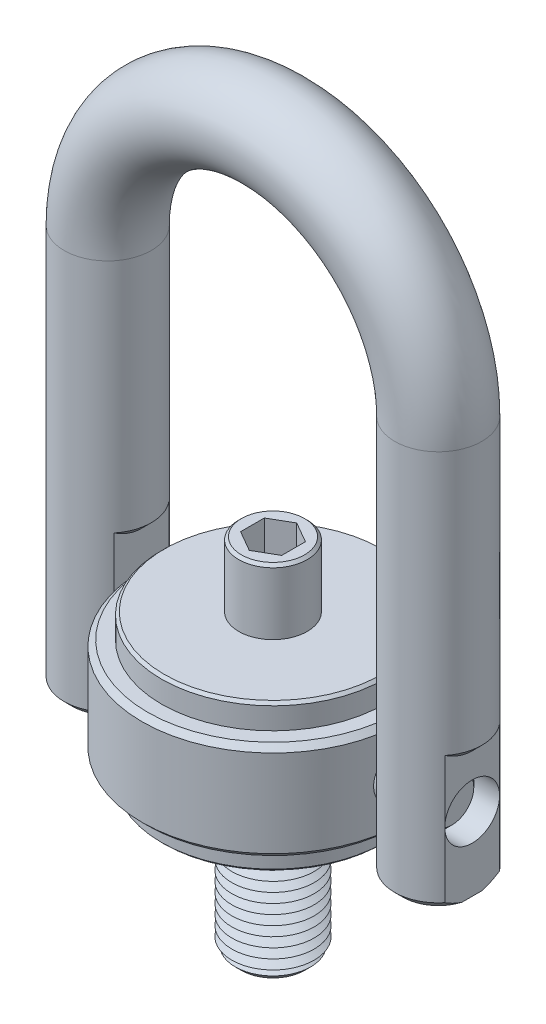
ISO-10303-21;
HEADER;
FILE_DESCRIPTION(('STEP AP214'),'2;1');
FILE_NAME('part.step','',(''),(''),'','','');
FILE_SCHEMA(('AUTOMOTIVE_DESIGN { 1 0 10303 214 1 1 1 1 }'));
ENDSEC;
DATA;
#1=APPLICATION_CONTEXT('core data for automotive mechanical design processes');
#2=APPLICATION_PROTOCOL_DEFINITION('international standard','automotive_design',2000,#1);
#3=PRODUCT_CONTEXT('',#1,'mechanical');
#4=PRODUCT('Part','Part','',(#3));
#5=PRODUCT_RELATED_PRODUCT_CATEGORY('part','',(#4));
#6=PRODUCT_DEFINITION_FORMATION('','',#4);
#7=PRODUCT_DEFINITION_CONTEXT('part definition',#1,'design');
#8=PRODUCT_DEFINITION('design','',#6,#7);
#9=PRODUCT_DEFINITION_SHAPE('','',#8);
#10=(LENGTH_UNIT() NAMED_UNIT(*) SI_UNIT(.MILLI.,.METRE.));
#11=(NAMED_UNIT(*) PLANE_ANGLE_UNIT() SI_UNIT($,.RADIAN.));
#12=(NAMED_UNIT(*) SI_UNIT($,.STERADIAN.) SOLID_ANGLE_UNIT());
#13=UNCERTAINTY_MEASURE_WITH_UNIT(LENGTH_MEASURE(1.E-05),#10,'distance_accuracy_value','');
#14=(GEOMETRIC_REPRESENTATION_CONTEXT(3) GLOBAL_UNCERTAINTY_ASSIGNED_CONTEXT((#13)) GLOBAL_UNIT_ASSIGNED_CONTEXT((#10,
#11,#12)) REPRESENTATION_CONTEXT('',''));
#15=CARTESIAN_POINT('',(0.,0.,0.));
#16=DIRECTION('',(0.,0.,1.));
#17=DIRECTION('',(1.,0.,0.));
#18=AXIS2_PLACEMENT_3D('',#15,#16,#17);
#19=CARTESIAN_POINT('',(65.25,0.,0.));
#20=DIRECTION('',(-1.,0.,0.));
#21=DIRECTION('',(0.,0.,1.));
#22=AXIS2_PLACEMENT_3D('',#19,#20,#21);
#23=CYLINDRICAL_SURFACE('',#22,10.);
#24=CARTESIAN_POINT('',(-63.25,0.,0.));
#25=DIRECTION('',(1.,0.,0.));
#26=DIRECTION('',(0.,0.,-1.));
#27=AXIS2_PLACEMENT_3D('',#24,#25,#26);
#28=CIRCLE('',#27,10.);
#29=CARTESIAN_POINT('',(-63.25,0.,-10.));
#30=VERTEX_POINT('',#29);
#31=EDGE_CURVE('P0_E25',#30,#30,#28,.T.);
#32=ORIENTED_EDGE('',*,*,#31,.T.);
#33=EDGE_LOOP('',(#32));
#34=FACE_BOUND('',#33,.T.);
#35=CARTESIAN_POINT('',(63.25,0.,0.));
#36=DIRECTION('',(1.,0.,0.));
#37=DIRECTION('',(0.,0.,-1.));
#38=AXIS2_PLACEMENT_3D('',#35,#36,#37);
#39=CIRCLE('',#38,10.);
#40=CARTESIAN_POINT('',(63.25,0.,-10.));
#41=VERTEX_POINT('',#40);
#42=EDGE_CURVE('P0_E29',#41,#41,#39,.F.);
#43=ORIENTED_EDGE('',*,*,#42,.T.);
#44=EDGE_LOOP('',(#43));
#45=FACE_BOUND('',#44,.T.);
#46=ADVANCED_FACE('P0_F14',(#34,#45),#23,.T.);
#47=CARTESIAN_POINT('',(65.25,0.,0.));
#48=DIRECTION('',(1.,0.,0.));
#49=DIRECTION('',(0.,0.,-1.));
#50=AXIS2_PLACEMENT_3D('',#47,#48,#49);
#51=PLANE('',#50);
#52=CARTESIAN_POINT('',(65.25,0.,0.));
#53=DIRECTION('',(1.,0.,0.));
#54=DIRECTION('',(0.,0.,-1.));
#55=AXIS2_PLACEMENT_3D('',#52,#53,#54);
#56=CIRCLE('',#55,7.99999999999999);
#57=CARTESIAN_POINT('',(65.25,0.,-7.99999999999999));
#58=VERTEX_POINT('',#57);
#59=EDGE_CURVE('P0_E10',#58,#58,#56,.T.);
#60=ORIENTED_EDGE('',*,*,#59,.T.);
#61=EDGE_LOOP('',(#60));
#62=FACE_BOUND('',#61,.T.);
#63=ADVANCED_FACE('P0_F46',(#62),#51,.T.);
#64=CARTESIAN_POINT('',(-65.25,0.,0.));
#65=DIRECTION('',(1.,0.,0.));
#66=DIRECTION('',(0.,0.,-1.));
#67=AXIS2_PLACEMENT_3D('',#64,#65,#66);
#68=PLANE('',#67);
#69=CARTESIAN_POINT('',(-65.25,0.,0.));
#70=DIRECTION('',(1.,0.,0.));
#71=DIRECTION('',(0.,0.,-1.));
#72=AXIS2_PLACEMENT_3D('',#69,#70,#71);
#73=CIRCLE('',#72,7.99999999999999);
#74=CARTESIAN_POINT('',(-65.25,0.,-7.99999999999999));
#75=VERTEX_POINT('',#74);
#76=EDGE_CURVE('P0_E21',#75,#75,#73,.F.);
#77=ORIENTED_EDGE('',*,*,#76,.T.);
#78=EDGE_LOOP('',(#77));
#79=FACE_BOUND('',#78,.T.);
#80=ADVANCED_FACE('P0_F43',(#79),#68,.F.);
#81=CARTESIAN_POINT('',(-63.25,0.,0.));
#82=DIRECTION('',(1.,0.,0.));
#83=DIRECTION('',(0.,0.,-1.));
#84=AXIS2_PLACEMENT_3D('',#81,#82,#83);
#85=CONICAL_SURFACE('',#84,10.,0.78539816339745);
#86=ORIENTED_EDGE('',*,*,#76,.F.);
#87=EDGE_LOOP('',(#86));
#88=FACE_BOUND('',#87,.T.);
#89=ORIENTED_EDGE('',*,*,#31,.F.);
#90=EDGE_LOOP('',(#89));
#91=FACE_BOUND('',#90,.T.);
#92=ADVANCED_FACE('P0_F38',(#88,#91),#85,.T.);
#93=CARTESIAN_POINT('',(65.25,0.,0.));
#94=DIRECTION('',(-1.,0.,0.));
#95=DIRECTION('',(0.,0.,1.));
#96=AXIS2_PLACEMENT_3D('',#93,#94,#95);
#97=CONICAL_SURFACE('',#96,7.99999999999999,0.785398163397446);
#98=ORIENTED_EDGE('',*,*,#42,.F.);
#99=EDGE_LOOP('',(#98));
#100=FACE_BOUND('',#99,.T.);
#101=ORIENTED_EDGE('',*,*,#59,.F.);
#102=EDGE_LOOP('',(#101));
#103=FACE_BOUND('',#102,.T.);
#104=ADVANCED_FACE('P0_F16',(#100,#103),#97,.T.);
#105=CLOSED_SHELL('',(#46,#63,#80,#92,#104));
#106=MANIFOLD_SOLID_BREP('P0_B1',#105);
#107=CARTESIAN_POINT('',(-47.9383658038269,28.2,10.));
#108=DIRECTION('',(-1.,0.,0.));
#109=DIRECTION('',(0.,0.,1.));
#110=AXIS2_PLACEMENT_3D('',#107,#108,#109);
#111=PLANE('',#110);
#112=DIRECTION('',(0.,-1.,0.));
#113=VECTOR('',#112,1.);
#114=CARTESIAN_POINT('',(-47.9383658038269,28.2,10.));
#115=LINE('',#114,#113);
#116=CARTESIAN_POINT('',(-47.9383658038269,32.7,10.));
#117=VERTEX_POINT('',#116);
#118=CARTESIAN_POINT('',(-47.9383658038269,0.,10.));
#119=VERTEX_POINT('',#118);
#120=EDGE_CURVE('P1_E184',#117,#119,#115,.T.);
#121=ORIENTED_EDGE('',*,*,#120,.T.);
#122=CARTESIAN_POINT('',(-47.9383658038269,0.,0.));
#123=DIRECTION('',(-1.,0.,0.));
#124=DIRECTION('',(0.,0.,1.));
#125=AXIS2_PLACEMENT_3D('',#122,#123,#124);
#126=CIRCLE('',#125,10.);
#127=CARTESIAN_POINT('',(-47.9383658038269,0.,-10.));
#128=VERTEX_POINT('',#127);
#129=EDGE_CURVE('P1_E31',#119,#128,#126,.T.);
#130=ORIENTED_EDGE('',*,*,#129,.T.);
#131=DIRECTION('',(0.,-1.,0.));
#132=VECTOR('',#131,1.);
#133=CARTESIAN_POINT('',(-47.9383658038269,28.2,-10.));
#134=LINE('',#133,#132);
#135=CARTESIAN_POINT('',(-47.9383658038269,32.7,-10.));
#136=VERTEX_POINT('',#135);
#137=EDGE_CURVE('P1_E180',#136,#128,#134,.T.);
#138=ORIENTED_EDGE('',*,*,#137,.F.);
#139=CARTESIAN_POINT('',(-47.9383658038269,32.7,-10.));
#140=CARTESIAN_POINT('',(-47.9383658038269,32.5483389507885,-9.75882173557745));
#141=CARTESIAN_POINT('',(-47.9383658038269,32.3990118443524,-9.51615304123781));
#142=CARTESIAN_POINT('',(-47.9383658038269,32.1057841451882,-9.02748239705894));
#143=CARTESIAN_POINT('',(-47.9383658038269,31.9618848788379,-8.781479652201));
#144=CARTESIAN_POINT('',(-47.9383658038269,31.6797346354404,-8.28482936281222));
#145=CARTESIAN_POINT('',(-47.9383658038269,31.5415108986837,-8.03416628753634));
#146=CARTESIAN_POINT('',(-47.9383658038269,31.2723712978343,-7.52896042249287));
#147=CARTESIAN_POINT('',(-47.9383658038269,31.1414549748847,-7.2744178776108));
#148=CARTESIAN_POINT('',(-47.9383658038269,30.8855140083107,-6.75599854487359));
#149=CARTESIAN_POINT('',(-47.9383658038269,30.7606599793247,-6.49203692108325));
#150=CARTESIAN_POINT('',(-47.9383658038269,30.5211338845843,-5.95953773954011));
#151=CARTESIAN_POINT('',(-47.9383658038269,30.4064626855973,-5.69099979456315));
#152=CARTESIAN_POINT('',(-47.9383658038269,30.0804478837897,-4.8790975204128));
#153=CARTESIAN_POINT('',(-47.9383658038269,29.8865742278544,-4.32840004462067));
#154=CARTESIAN_POINT('',(-47.9383658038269,29.6191683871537,-3.41143153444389));
#155=CARTESIAN_POINT('',(-47.9383658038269,29.5274663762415,-3.05043267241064));
#156=CARTESIAN_POINT('',(-47.9383658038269,29.3728240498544,-2.32215475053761));
#157=CARTESIAN_POINT('',(-47.9383658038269,29.3098877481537,-1.95487482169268));
#158=CARTESIAN_POINT('',(-47.9383658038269,29.2162729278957,-1.21900205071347));
#159=CARTESIAN_POINT('',(-47.9383658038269,29.1853543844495,-0.850440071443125));
#160=CARTESIAN_POINT('',(-47.9383658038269,29.1566460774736,-0.112153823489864));
#161=CARTESIAN_POINT('',(-47.9383658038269,29.1588400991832,0.257569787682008));
#162=CARTESIAN_POINT('',(-47.9383658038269,29.1900174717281,0.873991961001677));
#163=CARTESIAN_POINT('',(-47.9383658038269,29.2099595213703,1.12118851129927));
#164=CARTESIAN_POINT('',(-47.9383658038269,29.264159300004,1.6140970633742));
#165=CARTESIAN_POINT('',(-47.9383658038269,29.2984228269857,1.85980842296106));
#166=CARTESIAN_POINT('',(-47.9383658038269,29.4148598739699,2.55350356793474));
#167=CARTESIAN_POINT('',(-47.9383658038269,29.5131387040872,2.99884258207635));
#168=CARTESIAN_POINT('',(-47.9383658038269,29.7490274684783,3.879149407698));
#169=CARTESIAN_POINT('',(-47.9383658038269,29.886675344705,4.31410677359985));
#170=CARTESIAN_POINT('',(-47.9383658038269,30.1949129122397,5.17454547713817));
#171=CARTESIAN_POINT('',(-47.9383658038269,30.3656669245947,5.59996721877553));
#172=CARTESIAN_POINT('',(-47.9383658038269,30.7330811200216,6.43918325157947));
#173=CARTESIAN_POINT('',(-47.9383658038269,30.9297340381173,6.85298076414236));
#174=CARTESIAN_POINT('',(-47.9383658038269,31.3753615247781,7.73281637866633));
#175=CARTESIAN_POINT('',(-47.9383658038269,31.6277339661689,8.19712419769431));
#176=CARTESIAN_POINT('',(-47.9383658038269,32.0207235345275,8.8822773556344));
#177=CARTESIAN_POINT('',(-47.9383658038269,32.1534532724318,9.10772014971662));
#178=CARTESIAN_POINT('',(-47.9383658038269,32.4234593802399,9.55585714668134));
#179=CARTESIAN_POINT('',(-47.9383658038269,32.5607355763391,9.77855145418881));
#180=CARTESIAN_POINT('',(-47.9383658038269,32.7,10.));
#181=B_SPLINE_CURVE_WITH_KNOTS('',3,(#139,#140,#141,#142,#143,#144,#145,#146,#147,#148,#149,
#150,#151,#152,#153,#154,#155,#156,#157,#158,#159,#160,#161,#162,#163,#164,#165,#166,#167,#168,
#169,#170,#171,#172,#173,#174,#175,#176,#177,#178,#179,#180),.UNSPECIFIED.,.F.,.F.,(4,2,2,2,2,2,
2,2,2,2,2,2,2,2,2,2,2,2,2,2,4),(0.,0.854715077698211,1.70963768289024,2.56827267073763,
3.42685368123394,4.30263827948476,5.17849735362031,6.92671204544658,8.04314393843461,
9.15973156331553,10.2678865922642,11.3754989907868,12.119094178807,12.8629907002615,
14.228848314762,15.5960267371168,16.9701733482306,18.3439353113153,19.928555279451,
20.7133570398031,21.4981288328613),.UNSPECIFIED.);
#182=EDGE_CURVE('P1_E296',#136,#117,#181,.T.);
#183=ORIENTED_EDGE('',*,*,#182,.T.);
#184=EDGE_LOOP('',(#121,#130,#138,#183));
#185=FACE_BOUND('',#184,.T.);
#186=ADVANCED_FACE('P1_F16',(#185),#111,.F.);
#187=CARTESIAN_POINT('',(-72.6616341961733,18.2,10.));
#188=DIRECTION('',(1.,0.,0.));
#189=DIRECTION('',(0.,0.,-1.));
#190=AXIS2_PLACEMENT_3D('',#187,#188,#189);
#191=PLANE('',#190);
#192=DIRECTION('',(0.,-1.,0.));
#193=VECTOR('',#192,1.);
#194=CARTESIAN_POINT('',(-72.6616341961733,18.2,-10.));
#195=LINE('',#194,#193);
#196=CARTESIAN_POINT('',(-72.6616341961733,22.7,-10.));
#197=VERTEX_POINT('',#196);
#198=CARTESIAN_POINT('',(-72.6616341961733,0.,-10.));
#199=VERTEX_POINT('',#198);
#200=EDGE_CURVE('P1_E152',#197,#199,#195,.T.);
#201=ORIENTED_EDGE('',*,*,#200,.T.);
#202=CARTESIAN_POINT('',(-72.6616341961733,0.,0.));
#203=DIRECTION('',(1.,0.,0.));
#204=DIRECTION('',(0.,0.,-1.));
#205=AXIS2_PLACEMENT_3D('',#202,#203,#204);
#206=CIRCLE('',#205,10.);
#207=CARTESIAN_POINT('',(-72.6616341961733,0.,10.));
#208=VERTEX_POINT('',#207);
#209=EDGE_CURVE('P1_E38',#208,#199,#206,.F.);
#210=ORIENTED_EDGE('',*,*,#209,.F.);
#211=DIRECTION('',(0.,-1.,0.));
#212=VECTOR('',#211,1.);
#213=CARTESIAN_POINT('',(-72.6616341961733,18.2,10.));
#214=LINE('',#213,#212);
#215=CARTESIAN_POINT('',(-72.6616341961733,22.7,10.));
#216=VERTEX_POINT('',#215);
#217=EDGE_CURVE('P1_E150',#216,#208,#214,.T.);
#218=ORIENTED_EDGE('',*,*,#217,.F.);
#219=CARTESIAN_POINT('',(-72.6616341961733,22.7,10.));
#220=CARTESIAN_POINT('',(-72.6616341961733,22.5483389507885,9.75882173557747));
#221=CARTESIAN_POINT('',(-72.6616341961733,22.3990118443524,9.51615304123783));
#222=CARTESIAN_POINT('',(-72.6616341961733,22.1057841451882,9.02748239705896));
#223=CARTESIAN_POINT('',(-72.6616341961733,21.9618848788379,8.78147965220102));
#224=CARTESIAN_POINT('',(-72.6616341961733,21.6797346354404,8.28482936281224));
#225=CARTESIAN_POINT('',(-72.6616341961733,21.5415108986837,8.03416628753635));
#226=CARTESIAN_POINT('',(-72.6616341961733,21.2723712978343,7.52896042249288));
#227=CARTESIAN_POINT('',(-72.6616341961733,21.1414549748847,7.27441787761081));
#228=CARTESIAN_POINT('',(-72.6616341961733,20.8855140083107,6.7559985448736));
#229=CARTESIAN_POINT('',(-72.6616341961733,20.7606599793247,6.49203692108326));
#230=CARTESIAN_POINT('',(-72.6616341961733,20.5211338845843,5.95953773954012));
#231=CARTESIAN_POINT('',(-72.6616341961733,20.4064626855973,5.69099979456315));
#232=CARTESIAN_POINT('',(-72.6616341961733,20.0804478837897,4.8790975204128));
#233=CARTESIAN_POINT('',(-72.6616341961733,19.8865742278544,4.32840004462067));
#234=CARTESIAN_POINT('',(-72.6616341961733,19.6191683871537,3.41143153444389));
#235=CARTESIAN_POINT('',(-72.6616341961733,19.5274663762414,3.05043267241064));
#236=CARTESIAN_POINT('',(-72.6616341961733,19.3728240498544,2.32215475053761));
#237=CARTESIAN_POINT('',(-72.6616341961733,19.3098877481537,1.95487482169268));
#238=CARTESIAN_POINT('',(-72.6616341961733,19.2162729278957,1.21900205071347));
#239=CARTESIAN_POINT('',(-72.6616341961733,19.1853543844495,0.85044007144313));
#240=CARTESIAN_POINT('',(-72.6616341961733,19.1566460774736,0.112153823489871));
#241=CARTESIAN_POINT('',(-72.6616341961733,19.1588400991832,-0.257569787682));
#242=CARTESIAN_POINT('',(-72.6616341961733,19.1900174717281,-0.873991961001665));
#243=CARTESIAN_POINT('',(-72.6616341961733,19.2099595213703,-1.12118851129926));
#244=CARTESIAN_POINT('',(-72.6616341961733,19.2641593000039,-1.61409706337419));
#245=CARTESIAN_POINT('',(-72.6616341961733,19.2984228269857,-1.85980842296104));
#246=CARTESIAN_POINT('',(-72.6616341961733,19.4148598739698,-2.55350356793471));
#247=CARTESIAN_POINT('',(-72.6616341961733,19.5131387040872,-2.99884258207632));
#248=CARTESIAN_POINT('',(-72.6616341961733,19.7490274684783,-3.87914940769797));
#249=CARTESIAN_POINT('',(-72.6616341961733,19.8866753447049,-4.31410677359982));
#250=CARTESIAN_POINT('',(-72.6616341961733,20.1949129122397,-5.17454547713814));
#251=CARTESIAN_POINT('',(-72.6616341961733,20.3656669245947,-5.5999672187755));
#252=CARTESIAN_POINT('',(-72.6616341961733,20.7330811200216,-6.43918325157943));
#253=CARTESIAN_POINT('',(-72.6616341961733,20.9297340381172,-6.85298076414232));
#254=CARTESIAN_POINT('',(-72.6616341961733,21.3753615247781,-7.7328163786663));
#255=CARTESIAN_POINT('',(-72.6616341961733,21.6277339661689,-8.19712419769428));
#256=CARTESIAN_POINT('',(-72.6616341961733,22.0207235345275,-8.88227735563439));
#257=CARTESIAN_POINT('',(-72.6616341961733,22.1534532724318,-9.10772014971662));
#258=CARTESIAN_POINT('',(-72.6616341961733,22.4234593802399,-9.55585714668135));
#259=CARTESIAN_POINT('',(-72.6616341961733,22.5607355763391,-9.77855145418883));
#260=CARTESIAN_POINT('',(-72.6616341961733,22.7,-10.));
#261=B_SPLINE_CURVE_WITH_KNOTS('',3,(#219,#220,#221,#222,#223,#224,#225,#226,#227,#228,#229,
#230,#231,#232,#233,#234,#235,#236,#237,#238,#239,#240,#241,#242,#243,#244,#245,#246,#247,#248,
#249,#250,#251,#252,#253,#254,#255,#256,#257,#258,#259,#260),.UNSPECIFIED.,.F.,.F.,(4,2,2,2,2,2,
2,2,2,2,2,2,2,2,2,2,2,2,2,2,4),(0.,0.854715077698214,1.70963768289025,2.56827267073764,
3.42685368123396,4.30263827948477,5.17849735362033,6.9267120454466,8.04314393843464,
9.15973156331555,10.2678865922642,11.3754989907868,12.119094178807,12.8629907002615,
14.228848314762,15.5960267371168,16.9701733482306,18.3439353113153,19.9285552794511,
20.7133570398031,21.4981288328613),.UNSPECIFIED.);
#262=EDGE_CURVE('P1_E303',#216,#197,#261,.T.);
#263=ORIENTED_EDGE('',*,*,#262,.T.);
#264=EDGE_LOOP('',(#201,#210,#218,#263));
#265=FACE_BOUND('',#264,.T.);
#266=ADVANCED_FACE('P1_F147',(#265),#191,.F.);
#267=CARTESIAN_POINT('',(47.9383658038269,28.2,10.));
#268=DIRECTION('',(-1.,0.,0.));
#269=DIRECTION('',(0.,0.,1.));
#270=AXIS2_PLACEMENT_3D('',#267,#268,#269);
#271=PLANE('',#270);
#272=CARTESIAN_POINT('',(47.9383658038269,0.,0.));
#273=DIRECTION('',(-1.,0.,0.));
#274=DIRECTION('',(0.,0.,1.));
#275=AXIS2_PLACEMENT_3D('',#272,#273,#274);
#276=CIRCLE('',#275,10.);
#277=CARTESIAN_POINT('',(47.9383658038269,0.,10.));
#278=VERTEX_POINT('',#277);
#279=CARTESIAN_POINT('',(47.9383658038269,0.,-10.));
#280=VERTEX_POINT('',#279);
#281=EDGE_CURVE('P1_E370',#278,#280,#276,.T.);
#282=ORIENTED_EDGE('',*,*,#281,.F.);
#283=DIRECTION('',(0.,-1.,0.));
#284=VECTOR('',#283,1.);
#285=CARTESIAN_POINT('',(47.9383658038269,28.2,10.));
#286=LINE('',#285,#284);
#287=CARTESIAN_POINT('',(47.9383658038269,32.7000000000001,10.));
#288=VERTEX_POINT('',#287);
#289=EDGE_CURVE('P1_E387',#288,#278,#286,.T.);
#290=ORIENTED_EDGE('',*,*,#289,.F.);
#291=CARTESIAN_POINT('',(47.9383658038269,32.7000000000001,10.));
#292=CARTESIAN_POINT('',(47.9383658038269,32.5109530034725,9.69932343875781));
#293=CARTESIAN_POINT('',(47.9383658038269,32.3254929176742,9.39633176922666));
#294=CARTESIAN_POINT('',(47.9383658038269,31.9632674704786,8.78497772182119));
#295=CARTESIAN_POINT('',(47.9383658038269,31.7865069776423,8.47661246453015));
#296=CARTESIAN_POINT('',(47.9383658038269,31.4415836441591,7.85078044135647));
#297=CARTESIAN_POINT('',(47.9383658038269,31.2735326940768,7.53325166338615));
#298=CARTESIAN_POINT('',(47.9383658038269,30.9502499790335,6.8917590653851));
#299=CARTESIAN_POINT('',(47.9383658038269,30.7950163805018,6.56779617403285));
#300=CARTESIAN_POINT('',(47.9383658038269,30.4982062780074,5.90916627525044));
#301=CARTESIAN_POINT('',(47.9383658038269,30.3568060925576,5.57441925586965));
#302=CARTESIAN_POINT('',(47.9383658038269,30.0927895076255,4.89748524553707));
#303=CARTESIAN_POINT('',(47.9383658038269,29.9701755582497,4.55529729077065));
#304=CARTESIAN_POINT('',(47.9383658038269,29.7477186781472,3.86517786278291));
#305=CARTESIAN_POINT('',(47.9383658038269,29.6477787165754,3.51727796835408));
#306=CARTESIAN_POINT('',(47.9383658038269,29.4735886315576,2.81519322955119));
#307=CARTESIAN_POINT('',(47.9383658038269,29.399326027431,2.46101152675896));
#308=CARTESIAN_POINT('',(47.9383658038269,29.2879040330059,1.79709448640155));
#309=CARTESIAN_POINT('',(47.9383658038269,29.2470346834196,1.48798337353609));
#310=CARTESIAN_POINT('',(47.9383658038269,29.1881843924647,0.867458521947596));
#311=CARTESIAN_POINT('',(47.9383658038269,29.1702106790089,0.556044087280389));
#312=CARTESIAN_POINT('',(47.9383658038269,29.1579354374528,-0.0649069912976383));
#313=CARTESIAN_POINT('',(47.9383658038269,29.1634569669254,-0.374440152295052));
#314=CARTESIAN_POINT('',(47.9383658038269,29.1975567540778,-0.992234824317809));
#315=CARTESIAN_POINT('',(47.9383658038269,29.2261350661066,-1.30049633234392));
#316=CARTESIAN_POINT('',(47.9383658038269,29.2940549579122,-1.8273172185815));
#317=CARTESIAN_POINT('',(47.9383658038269,29.3280649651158,-2.04658413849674));
#318=CARTESIAN_POINT('',(47.9383658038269,29.4067513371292,-2.48320510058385));
#319=CARTESIAN_POINT('',(47.9383658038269,29.4514287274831,-2.70055895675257));
#320=CARTESIAN_POINT('',(47.9383658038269,29.6004301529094,-3.34934073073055));
#321=CARTESIAN_POINT('',(47.9383658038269,29.7197095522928,-3.77738572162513));
#322=CARTESIAN_POINT('',(47.9383658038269,29.9927877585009,-4.62633577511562));
#323=CARTESIAN_POINT('',(47.9383658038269,30.1468888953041,-5.04714130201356));
#324=CARTESIAN_POINT('',(47.9383658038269,30.4824998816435,-5.87750320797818));
#325=CARTESIAN_POINT('',(47.9383658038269,30.6640058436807,-6.28706117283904));
#326=CARTESIAN_POINT('',(47.9383658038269,30.9932609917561,-6.97871570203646));
#327=CARTESIAN_POINT('',(47.9383658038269,31.1355962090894,-7.26342638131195));
#328=CARTESIAN_POINT('',(47.9383658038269,31.4296968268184,-7.82790227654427));
#329=CARTESIAN_POINT('',(47.9383658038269,31.5814614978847,-8.10766787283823));
#330=CARTESIAN_POINT('',(47.9383658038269,31.8906501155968,-8.65846055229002));
#331=CARTESIAN_POINT('',(47.9383658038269,32.0479532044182,-8.92955581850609));
#332=CARTESIAN_POINT('',(47.9383658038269,32.3692342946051,-9.46770064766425));
#333=CARTESIAN_POINT('',(47.9383658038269,32.5332110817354,-9.73475093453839));
#334=CARTESIAN_POINT('',(47.9383658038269,32.7,-10.));
#335=B_SPLINE_CURVE_WITH_KNOTS('',3,(#291,#292,#293,#294,#295,#296,#297,#298,#299,#300,#301,
#302,#303,#304,#305,#306,#307,#308,#309,#310,#311,#312,#313,#314,#315,#316,#317,#318,#319,#320,
#321,#322,#323,#324,#325,#326,#327,#328,#329,#330,#331,#332,#333,#334),.UNSPECIFIED.,.F.,.F.,(4,
2,2,2,2,2,2,2,2,2,2,2,2,2,2,2,2,2,2,2,2,4),(0.,1.06555746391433,2.13170461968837,
3.20923011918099,4.28660120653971,5.37628272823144,6.46610624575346,7.55117411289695,
8.63571383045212,9.57032733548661,10.5052358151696,11.4331160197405,12.3609984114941,
13.0264017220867,13.6918690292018,15.0231145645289,16.3663954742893,17.7094860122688,
18.6642324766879,19.6189051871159,20.5590879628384,21.4991004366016),.UNSPECIFIED.);
#336=CARTESIAN_POINT('',(47.9383658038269,32.7000000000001,-10.));
#337=VERTEX_POINT('',#336);
#338=EDGE_CURVE('P1_E210',#288,#337,#335,.T.);
#339=ORIENTED_EDGE('',*,*,#338,.T.);
#340=DIRECTION('',(0.,-1.,0.));
#341=VECTOR('',#340,1.);
#342=CARTESIAN_POINT('',(47.9383658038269,28.2,-10.));
#343=LINE('',#342,#341);
#344=EDGE_CURVE('P1_E390',#337,#280,#343,.T.);
#345=ORIENTED_EDGE('',*,*,#344,.T.);
#346=EDGE_LOOP('',(#282,#290,#339,#345));
#347=FACE_BOUND('',#346,.T.);
#348=ADVANCED_FACE('P1_F429',(#347),#271,.T.);
#349=CARTESIAN_POINT('',(72.6616341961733,18.2,10.));
#350=DIRECTION('',(1.,0.,0.));
#351=DIRECTION('',(0.,0.,-1.));
#352=AXIS2_PLACEMENT_3D('',#349,#350,#351);
#353=PLANE('',#352);
#354=CARTESIAN_POINT('',(72.6616341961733,0.,0.));
#355=DIRECTION('',(1.,0.,0.));
#356=DIRECTION('',(0.,0.,-1.));
#357=AXIS2_PLACEMENT_3D('',#354,#355,#356);
#358=CIRCLE('',#357,10.);
#359=CARTESIAN_POINT('',(72.6616341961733,0.,-10.));
#360=VERTEX_POINT('',#359);
#361=CARTESIAN_POINT('',(72.6616341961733,0.,10.));
#362=VERTEX_POINT('',#361);
#363=EDGE_CURVE('P1_E153',#360,#362,#358,.T.);
#364=ORIENTED_EDGE('',*,*,#363,.F.);
#365=DIRECTION('',(0.,-1.,0.));
#366=VECTOR('',#365,1.);
#367=CARTESIAN_POINT('',(72.6616341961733,18.2,-10.));
#368=LINE('',#367,#366);
#369=CARTESIAN_POINT('',(72.6616341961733,22.7000000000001,-10.));
#370=VERTEX_POINT('',#369);
#371=EDGE_CURVE('P1_E376',#370,#360,#368,.T.);
#372=ORIENTED_EDGE('',*,*,#371,.F.);
#373=CARTESIAN_POINT('',(72.6616341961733,22.7000000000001,-10.));
#374=CARTESIAN_POINT('',(72.6616341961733,22.5109530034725,-9.69932343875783));
#375=CARTESIAN_POINT('',(72.6616341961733,22.3254929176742,-9.39633176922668));
#376=CARTESIAN_POINT('',(72.6616341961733,21.9632674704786,-8.78497772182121));
#377=CARTESIAN_POINT('',(72.6616341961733,21.7865069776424,-8.47661246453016));
#378=CARTESIAN_POINT('',(72.6616341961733,21.4415836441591,-7.85078044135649));
#379=CARTESIAN_POINT('',(72.6616341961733,21.2735326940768,-7.53325166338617));
#380=CARTESIAN_POINT('',(72.6616341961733,20.9502499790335,-6.89175906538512));
#381=CARTESIAN_POINT('',(72.6616341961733,20.7950163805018,-6.56779617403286));
#382=CARTESIAN_POINT('',(72.6616341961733,20.4982062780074,-5.90916627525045));
#383=CARTESIAN_POINT('',(72.6616341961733,20.3568060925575,-5.57441925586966));
#384=CARTESIAN_POINT('',(72.6616341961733,20.0927895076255,-4.89748524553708));
#385=CARTESIAN_POINT('',(72.6616341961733,19.9701755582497,-4.55529729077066));
#386=CARTESIAN_POINT('',(72.6616341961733,19.7477186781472,-3.86517786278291));
#387=CARTESIAN_POINT('',(72.6616341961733,19.6477787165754,-3.51727796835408));
#388=CARTESIAN_POINT('',(72.6616341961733,19.4735886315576,-2.81519322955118));
#389=CARTESIAN_POINT('',(72.6616341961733,19.399326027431,-2.46101152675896));
#390=CARTESIAN_POINT('',(72.6616341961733,19.2879040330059,-1.79709448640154));
#391=CARTESIAN_POINT('',(72.6616341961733,19.2470346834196,-1.48798337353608));
#392=CARTESIAN_POINT('',(72.6616341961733,19.1881843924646,-0.867458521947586));
#393=CARTESIAN_POINT('',(72.6616341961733,19.1702106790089,-0.556044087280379));
#394=CARTESIAN_POINT('',(72.6616341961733,19.1579354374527,0.0649069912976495));
#395=CARTESIAN_POINT('',(72.6616341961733,19.1634569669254,0.374440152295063));
#396=CARTESIAN_POINT('',(72.6616341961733,19.1975567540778,0.992234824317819));
#397=CARTESIAN_POINT('',(72.6616341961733,19.2261350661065,1.30049633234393));
#398=CARTESIAN_POINT('',(72.6616341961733,19.2940549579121,1.82731721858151));
#399=CARTESIAN_POINT('',(72.6616341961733,19.3280649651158,2.04658413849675));
#400=CARTESIAN_POINT('',(72.6616341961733,19.4067513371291,2.48320510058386));
#401=CARTESIAN_POINT('',(72.6616341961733,19.4514287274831,2.70055895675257));
#402=CARTESIAN_POINT('',(72.6616341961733,19.6004301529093,3.34934073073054));
#403=CARTESIAN_POINT('',(72.6616341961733,19.7197095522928,3.77738572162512));
#404=CARTESIAN_POINT('',(72.6616341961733,19.9927877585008,4.6263357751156));
#405=CARTESIAN_POINT('',(72.6616341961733,20.1468888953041,5.04714130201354));
#406=CARTESIAN_POINT('',(72.6616341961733,20.4824998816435,5.87750320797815));
#407=CARTESIAN_POINT('',(72.6616341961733,20.6640058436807,6.28706117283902));
#408=CARTESIAN_POINT('',(72.6616341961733,20.993260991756,6.97871570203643));
#409=CARTESIAN_POINT('',(72.6616341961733,21.1355962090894,7.26342638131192));
#410=CARTESIAN_POINT('',(72.6616341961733,21.4296968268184,7.82790227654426));
#411=CARTESIAN_POINT('',(72.6616341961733,21.5814614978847,8.10766787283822));
#412=CARTESIAN_POINT('',(72.6616341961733,21.8906501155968,8.65846055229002));
#413=CARTESIAN_POINT('',(72.6616341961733,22.0479532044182,8.9295558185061));
#414=CARTESIAN_POINT('',(72.6616341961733,22.3692342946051,9.46770064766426));
#415=CARTESIAN_POINT('',(72.6616341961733,22.5332110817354,9.73475093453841));
#416=CARTESIAN_POINT('',(72.6616341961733,22.7000000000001,10.));
#417=B_SPLINE_CURVE_WITH_KNOTS('',3,(#373,#374,#375,#376,#377,#378,#379,#380,#381,#382,#383,
#384,#385,#386,#387,#388,#389,#390,#391,#392,#393,#394,#395,#396,#397,#398,#399,#400,#401,#402,
#403,#404,#405,#406,#407,#408,#409,#410,#411,#412,#413,#414,#415,#416),.UNSPECIFIED.,.F.,.F.,(4,
2,2,2,2,2,2,2,2,2,2,2,2,2,2,2,2,2,2,2,2,4),(0.,1.06555746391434,2.13170461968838,3.209230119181,
4.28660120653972,5.37628272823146,6.46610624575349,7.55117411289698,8.63571383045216,
9.57032733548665,10.5052358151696,11.4331160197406,12.3609984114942,13.0264017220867,
13.6918690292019,15.023114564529,16.3663954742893,17.7094860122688,18.6642324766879,
19.6189051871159,20.5590879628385,21.4991004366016),.UNSPECIFIED.);
#418=CARTESIAN_POINT('',(72.6616341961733,22.7000000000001,10.));
#419=VERTEX_POINT('',#418);
#420=EDGE_CURVE('P1_E202',#370,#419,#417,.T.);
#421=ORIENTED_EDGE('',*,*,#420,.T.);
#422=DIRECTION('',(0.,-1.,0.));
#423=VECTOR('',#422,1.);
#424=CARTESIAN_POINT('',(72.6616341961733,18.2,10.));
#425=LINE('',#424,#423);
#426=EDGE_CURVE('P1_E381',#419,#362,#425,.T.);
#427=ORIENTED_EDGE('',*,*,#426,.T.);
#428=EDGE_LOOP('',(#364,#372,#421,#427));
#429=FACE_BOUND('',#428,.T.);
#430=ADVANCED_FACE('P1_F226',(#429),#353,.T.);
#431=CARTESIAN_POINT('',(60.3000000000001,-26.7999999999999,0.));
#432=DIRECTION('',(0.,-1.,0.));
#433=DIRECTION('',(0.,0.,1.));
#434=AXIS2_PLACEMENT_3D('',#431,#432,#433);
#435=PLANE('',#434);
#436=DIRECTION('',(0.,0.,-1.));
#437=VECTOR('',#436,1.);
#438=CARTESIAN_POINT('',(47.9383658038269,-26.8,10.));
#439=LINE('',#438,#437);
#440=CARTESIAN_POINT('',(47.9383658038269,-26.8,3.68781778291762));
#441=VERTEX_POINT('',#440);
#442=CARTESIAN_POINT('',(47.9383658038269,-26.8,-3.68781778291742));
#443=VERTEX_POINT('',#442);
#444=EDGE_CURVE('P1_E379',#441,#443,#439,.T.);
#445=ORIENTED_EDGE('',*,*,#444,.T.);
#446=CARTESIAN_POINT('',(60.3000000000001,-26.7999999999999,0.));
#447=DIRECTION('',(0.,-1.,0.));
#448=DIRECTION('',(1.,0.,0.));
#449=AXIS2_PLACEMENT_3D('',#446,#447,#448);
#450=CIRCLE('',#449,12.9);
#451=CARTESIAN_POINT('',(72.6616341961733,-26.8,-3.68781778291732));
#452=VERTEX_POINT('',#451);
#453=EDGE_CURVE('P1_E241',#443,#452,#450,.T.);
#454=ORIENTED_EDGE('',*,*,#453,.T.);
#455=DIRECTION('',(0.,0.,1.));
#456=VECTOR('',#455,1.);
#457=CARTESIAN_POINT('',(72.6616341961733,-26.8,10.));
#458=LINE('',#457,#456);
#459=CARTESIAN_POINT('',(72.6616341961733,-26.8,3.6878177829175));
#460=VERTEX_POINT('',#459);
#461=EDGE_CURVE('P1_E366',#452,#460,#458,.T.);
#462=ORIENTED_EDGE('',*,*,#461,.T.);
#463=CARTESIAN_POINT('',(60.3000000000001,-26.7999999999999,0.));
#464=DIRECTION('',(0.,-1.,0.));
#465=DIRECTION('',(1.,0.,0.));
#466=AXIS2_PLACEMENT_3D('',#463,#464,#465);
#467=CIRCLE('',#466,12.9000000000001);
#468=CARTESIAN_POINT('',(60.3000000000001,-26.7999999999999,12.9000000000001));
#469=VERTEX_POINT('',#468);
#470=EDGE_CURVE('P1_E415',#460,#469,#467,.T.);
#471=ORIENTED_EDGE('',*,*,#470,.T.);
#472=CARTESIAN_POINT('',(60.3000000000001,-26.7999999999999,0.));
#473=DIRECTION('',(0.,-1.,0.));
#474=DIRECTION('',(1.,0.,0.));
#475=AXIS2_PLACEMENT_3D('',#472,#473,#474);
#476=CIRCLE('',#475,12.9000000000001);
#477=EDGE_CURVE('P1_E413',#469,#441,#476,.T.);
#478=ORIENTED_EDGE('',*,*,#477,.T.);
#479=EDGE_LOOP('',(#445,#454,#462,#471,#478));
#480=FACE_BOUND('',#479,.T.);
#481=ADVANCED_FACE('P1_F419',(#480),#435,.T.);
#482=CARTESIAN_POINT('',(60.3000000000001,118.7,0.));
#483=DIRECTION('',(0.,-1.,0.));
#484=DIRECTION('',(1.,0.,0.));
#485=AXIS2_PLACEMENT_3D('',#482,#483,#484);
#486=CYLINDRICAL_SURFACE('',#485,15.9);
#487=CARTESIAN_POINT('',(60.3000000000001,118.7,0.));
#488=DIRECTION('',(0.,-1.,0.));
#489=DIRECTION('',(0.,0.,1.));
#490=AXIS2_PLACEMENT_3D('',#487,#488,#489);
#491=CIRCLE('',#490,15.9);
#492=CARTESIAN_POINT('',(76.2000000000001,118.7,0.));
#493=VERTEX_POINT('',#492);
#494=EDGE_CURVE('P1_E189',#493,#493,#491,.T.);
#495=ORIENTED_EDGE('',*,*,#494,.T.);
#496=EDGE_LOOP('',(#495));
#497=FACE_BOUND('',#496,.T.);
#498=ORIENTED_EDGE('',*,*,#371,.T.);
#499=CARTESIAN_POINT('',(72.6616341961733,-23.7999999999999,-10.));
#500=VERTEX_POINT('',#499);
#501=EDGE_CURVE('P1_E380',#360,#500,#368,.T.);
#502=ORIENTED_EDGE('',*,*,#501,.T.);
#503=CARTESIAN_POINT('',(60.3000000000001,-23.7999999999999,0.));
#504=DIRECTION('',(0.,-1.,0.));
#505=DIRECTION('',(0.,0.,-1.));
#506=AXIS2_PLACEMENT_3D('',#503,#504,#505);
#507=CIRCLE('',#506,15.9);
#508=CARTESIAN_POINT('',(47.9383658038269,-23.7999999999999,-10.));
#509=VERTEX_POINT('',#508);
#510=EDGE_CURVE('P1_E404',#500,#509,#507,.F.);
#511=ORIENTED_EDGE('',*,*,#510,.T.);
#512=EDGE_CURVE('P1_E386',#280,#509,#343,.T.);
#513=ORIENTED_EDGE('',*,*,#512,.F.);
#514=ORIENTED_EDGE('',*,*,#344,.F.);
#515=CARTESIAN_POINT('',(60.3000000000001,32.7000000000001,0.));
#516=DIRECTION('',(0.,-1.,0.));
#517=DIRECTION('',(0.,0.,-1.));
#518=AXIS2_PLACEMENT_3D('',#515,#516,#517);
#519=CIRCLE('',#518,15.9);
#520=EDGE_CURVE('P1_E192',#337,#288,#519,.F.);
#521=ORIENTED_EDGE('',*,*,#520,.T.);
#522=ORIENTED_EDGE('',*,*,#289,.T.);
#523=CARTESIAN_POINT('',(47.9383658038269,-23.7999999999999,10.));
#524=VERTEX_POINT('',#523);
#525=EDGE_CURVE('P1_E389',#278,#524,#286,.T.);
#526=ORIENTED_EDGE('',*,*,#525,.T.);
#527=CARTESIAN_POINT('',(60.3000000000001,-23.7999999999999,0.));
#528=DIRECTION('',(0.,-1.,0.));
#529=DIRECTION('',(0.,0.,-1.));
#530=AXIS2_PLACEMENT_3D('',#527,#528,#529);
#531=CIRCLE('',#530,15.9);
#532=CARTESIAN_POINT('',(60.3000000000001,-23.7999999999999,15.9));
#533=VERTEX_POINT('',#532);
#534=EDGE_CURVE('P1_E408',#524,#533,#531,.F.);
#535=ORIENTED_EDGE('',*,*,#534,.T.);
#536=CARTESIAN_POINT('',(60.3000000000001,-23.7999999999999,0.));
#537=DIRECTION('',(0.,-1.,0.));
#538=DIRECTION('',(0.,0.,-1.));
#539=AXIS2_PLACEMENT_3D('',#536,#537,#538);
#540=CIRCLE('',#539,15.9);
#541=CARTESIAN_POINT('',(72.6616341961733,-23.7999999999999,10.));
#542=VERTEX_POINT('',#541);
#543=EDGE_CURVE('P1_E423',#533,#542,#540,.F.);
#544=ORIENTED_EDGE('',*,*,#543,.T.);
#545=EDGE_CURVE('P1_E375',#362,#542,#425,.T.);
#546=ORIENTED_EDGE('',*,*,#545,.F.);
#547=ORIENTED_EDGE('',*,*,#426,.F.);
#548=CARTESIAN_POINT('',(60.3000000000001,22.7000000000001,0.));
#549=DIRECTION('',(0.,-1.,0.));
#550=DIRECTION('',(0.,0.,-1.));
#551=AXIS2_PLACEMENT_3D('',#548,#549,#550);
#552=CIRCLE('',#551,15.9);
#553=EDGE_CURVE('P1_E195',#419,#370,#552,.F.);
#554=ORIENTED_EDGE('',*,*,#553,.T.);
#555=EDGE_LOOP('',(#498,#502,#511,#513,#514,#521,#522,#526,#535,#544,#546,#547,#554));
#556=FACE_BOUND('',#555,.T.);
#557=ADVANCED_FACE('P1_F405',(#497,#556),#486,.T.);
#558=CARTESIAN_POINT('',(-60.3000000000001,-26.8,0.));
#559=DIRECTION('',(0.,1.,0.));
#560=DIRECTION('',(0.,0.,1.));
#561=AXIS2_PLACEMENT_3D('',#558,#559,#560);
#562=PLANE('',#561);
#563=DIRECTION('',(0.,0.,1.));
#564=VECTOR('',#563,1.);
#565=CARTESIAN_POINT('',(-72.6616341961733,-26.8,10.));
#566=LINE('',#565,#564);
#567=CARTESIAN_POINT('',(-72.6616341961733,-26.8,-3.68781778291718));
#568=VERTEX_POINT('',#567);
#569=CARTESIAN_POINT('',(-72.6616341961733,-26.8,3.68781778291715));
#570=VERTEX_POINT('',#569);
#571=EDGE_CURVE('P1_E176',#568,#570,#566,.T.);
#572=ORIENTED_EDGE('',*,*,#571,.F.);
#573=CARTESIAN_POINT('',(-60.3000000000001,-26.8,0.));
#574=DIRECTION('',(0.,1.,0.));
#575=DIRECTION('',(0.,0.,1.));
#576=AXIS2_PLACEMENT_3D('',#573,#574,#575);
#577=CIRCLE('',#576,12.9);
#578=CARTESIAN_POINT('',(-47.9383658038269,-26.8,-3.68781778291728));
#579=VERTEX_POINT('',#578);
#580=EDGE_CURVE('P1_E353',#568,#579,#577,.F.);
#581=ORIENTED_EDGE('',*,*,#580,.T.);
#582=DIRECTION('',(0.,0.,-1.));
#583=VECTOR('',#582,1.);
#584=CARTESIAN_POINT('',(-47.9383658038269,-26.8,10.));
#585=LINE('',#584,#583);
#586=CARTESIAN_POINT('',(-47.9383658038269,-26.8,3.68781778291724));
#587=VERTEX_POINT('',#586);
#588=EDGE_CURVE('P1_E170',#587,#579,#585,.T.);
#589=ORIENTED_EDGE('',*,*,#588,.F.);
#590=CARTESIAN_POINT('',(-60.3000000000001,-26.8,0.));
#591=DIRECTION('',(0.,1.,0.));
#592=DIRECTION('',(0.,0.,1.));
#593=AXIS2_PLACEMENT_3D('',#590,#591,#592);
#594=CIRCLE('',#593,12.9);
#595=CARTESIAN_POINT('',(-60.3000000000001,-26.8,12.9));
#596=VERTEX_POINT('',#595);
#597=EDGE_CURVE('P1_E345',#587,#596,#594,.F.);
#598=ORIENTED_EDGE('',*,*,#597,.T.);
#599=CARTESIAN_POINT('',(-60.3000000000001,-26.8,0.));
#600=DIRECTION('',(0.,1.,0.));
#601=DIRECTION('',(0.,0.,1.));
#602=AXIS2_PLACEMENT_3D('',#599,#600,#601);
#603=CIRCLE('',#602,12.9);
#604=EDGE_CURVE('P1_E348',#596,#570,#603,.F.);
#605=ORIENTED_EDGE('',*,*,#604,.T.);
#606=EDGE_LOOP('',(#572,#581,#589,#598,#605));
#607=FACE_BOUND('',#606,.T.);
#608=ADVANCED_FACE('P1_F291',(#607),#562,.F.);
#609=CARTESIAN_POINT('',(-60.3000000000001,-26.8,0.));
#610=DIRECTION('',(0.,1.,0.));
#611=DIRECTION('',(-1.,0.,0.));
#612=AXIS2_PLACEMENT_3D('',#609,#610,#611);
#613=CYLINDRICAL_SURFACE('',#612,15.9);
#614=ORIENTED_EDGE('',*,*,#137,.T.);
#615=CARTESIAN_POINT('',(-47.9383658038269,-23.8,-10.));
#616=VERTEX_POINT('',#615);
#617=EDGE_CURVE('P1_E183',#128,#616,#134,.T.);
#618=ORIENTED_EDGE('',*,*,#617,.T.);
#619=CARTESIAN_POINT('',(-60.3000000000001,-23.8,0.));
#620=DIRECTION('',(0.,1.,0.));
#621=DIRECTION('',(0.,0.,1.));
#622=AXIS2_PLACEMENT_3D('',#619,#620,#621);
#623=CIRCLE('',#622,15.9);
#624=CARTESIAN_POINT('',(-72.6616341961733,-23.8,-10.));
#625=VERTEX_POINT('',#624);
#626=EDGE_CURVE('P1_E340',#616,#625,#623,.T.);
#627=ORIENTED_EDGE('',*,*,#626,.T.);
#628=EDGE_CURVE('P1_E178',#199,#625,#195,.T.);
#629=ORIENTED_EDGE('',*,*,#628,.F.);
#630=ORIENTED_EDGE('',*,*,#200,.F.);
#631=CARTESIAN_POINT('',(-60.3000000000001,22.7,0.));
#632=DIRECTION('',(0.,-1.,0.));
#633=DIRECTION('',(0.,0.,-1.));
#634=AXIS2_PLACEMENT_3D('',#631,#632,#633);
#635=CIRCLE('',#634,15.9);
#636=EDGE_CURVE('P1_E169',#197,#216,#635,.F.);
#637=ORIENTED_EDGE('',*,*,#636,.T.);
#638=ORIENTED_EDGE('',*,*,#217,.T.);
#639=CARTESIAN_POINT('',(-72.6616341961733,-23.8,10.));
#640=VERTEX_POINT('',#639);
#641=EDGE_CURVE('P1_E155',#208,#640,#214,.T.);
#642=ORIENTED_EDGE('',*,*,#641,.T.);
#643=CARTESIAN_POINT('',(-60.3000000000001,-23.8,0.));
#644=DIRECTION('',(0.,1.,0.));
#645=DIRECTION('',(0.,0.,1.));
#646=AXIS2_PLACEMENT_3D('',#643,#644,#645);
#647=CIRCLE('',#646,15.9);
#648=CARTESIAN_POINT('',(-60.3000000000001,-23.8,15.9));
#649=VERTEX_POINT('',#648);
#650=EDGE_CURVE('P1_E338',#640,#649,#647,.T.);
#651=ORIENTED_EDGE('',*,*,#650,.T.);
#652=CARTESIAN_POINT('',(-60.3000000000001,-23.8,0.));
#653=DIRECTION('',(0.,1.,0.));
#654=DIRECTION('',(0.,0.,1.));
#655=AXIS2_PLACEMENT_3D('',#652,#653,#654);
#656=CIRCLE('',#655,15.9);
#657=CARTESIAN_POINT('',(-47.9383658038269,-23.8,10.));
#658=VERTEX_POINT('',#657);
#659=EDGE_CURVE('P1_E330',#649,#658,#656,.T.);
#660=ORIENTED_EDGE('',*,*,#659,.T.);
#661=EDGE_CURVE('P1_E172',#119,#658,#115,.T.);
#662=ORIENTED_EDGE('',*,*,#661,.F.);
#663=ORIENTED_EDGE('',*,*,#120,.F.);
#664=CARTESIAN_POINT('',(-60.3000000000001,32.7,0.));
#665=DIRECTION('',(0.,-1.,0.));
#666=DIRECTION('',(0.,0.,-1.));
#667=AXIS2_PLACEMENT_3D('',#664,#665,#666);
#668=CIRCLE('',#667,15.9);
#669=EDGE_CURVE('P1_E199',#117,#136,#668,.F.);
#670=ORIENTED_EDGE('',*,*,#669,.T.);
#671=EDGE_LOOP('',(#614,#618,#627,#629,#630,#637,#638,#642,#651,#660,#662,#663,#670));
#672=FACE_BOUND('',#671,.T.);
#673=CARTESIAN_POINT('',(-60.3000000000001,118.7,0.));
#674=DIRECTION('',(0.,1.,0.));
#675=DIRECTION('',(0.,0.,1.));
#676=AXIS2_PLACEMENT_3D('',#673,#674,#675);
#677=CIRCLE('',#676,15.9);
#678=CARTESIAN_POINT('',(-76.2000000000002,118.7,0.));
#679=VERTEX_POINT('',#678);
#680=EDGE_CURVE('P1_E182',#679,#679,#677,.T.);
#681=ORIENTED_EDGE('',*,*,#680,.F.);
#682=EDGE_LOOP('',(#681));
#683=FACE_BOUND('',#682,.T.);
#684=ADVANCED_FACE('P1_F166',(#672,#683),#613,.T.);
#685=CARTESIAN_POINT('',(0.,118.7,0.));
#686=DIRECTION('',(0.,0.,-1.));
#687=DIRECTION('',(-1.,0.,0.));
#688=AXIS2_PLACEMENT_3D('',#685,#686,#687);
#689=TOROIDAL_SURFACE('',#688,60.3000000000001,15.9);
#690=CARTESIAN_POINT('',(0.,118.7,0.));
#691=DIRECTION('',(0.,0.,-1.));
#692=DIRECTION('',(-1.,0.,0.));
#693=AXIS2_PLACEMENT_3D('',#690,#691,#692);
#694=CIRCLE('',#693,76.2000000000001);
#695=EDGE_CURVE('',#679,#493,#694,.T.);
#696=ORIENTED_EDGE('',*,*,#680,.T.);
#697=ORIENTED_EDGE('',*,*,#494,.F.);
#698=ORIENTED_EDGE('',*,*,#695,.T.);
#699=ORIENTED_EDGE('',*,*,#695,.F.);
#700=EDGE_LOOP('',(#696,#698,#697,#699));
#701=FACE_BOUND('',#700,.T.);
#702=ADVANCED_FACE('P1_F289',(#701),#689,.T.);
#703=ORIENTED_EDGE('',*,*,#617,.F.);
#704=EDGE_CURVE('P1_E367',#128,#119,#126,.T.);
#705=ORIENTED_EDGE('',*,*,#704,.T.);
#706=ORIENTED_EDGE('',*,*,#661,.T.);
#707=CARTESIAN_POINT('',(-47.9383658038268,-23.8,10.));
#708=CARTESIAN_POINT('',(-47.9383658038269,-23.9557308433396,9.75234655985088));
#709=CARTESIAN_POINT('',(-47.9383658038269,-24.1090036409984,9.50312121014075));
#710=CARTESIAN_POINT('',(-47.9383658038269,-24.4097964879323,9.00116222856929));
#711=CARTESIAN_POINT('',(-47.9383658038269,-24.5573154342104,8.74842793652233));
#712=CARTESIAN_POINT('',(-47.9383658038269,-24.8449994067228,8.24042477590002));
#713=CARTESIAN_POINT('',(-47.9383658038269,-24.9851968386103,7.98517432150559));
#714=CARTESIAN_POINT('',(-47.9383658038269,-25.2579608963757,7.47061588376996));
#715=CARTESIAN_POINT('',(-47.9383658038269,-25.3905275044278,7.21130789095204));
#716=CARTESIAN_POINT('',(-47.9383658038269,-25.6470475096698,6.68787018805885));
#717=CARTESIAN_POINT('',(-47.9383658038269,-25.7709849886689,6.42373264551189));
#718=CARTESIAN_POINT('',(-47.9383658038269,-26.0085500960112,5.89089614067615));
#719=CARTESIAN_POINT('',(-47.9383658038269,-26.1221794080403,5.62219793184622));
#720=CARTESIAN_POINT('',(-47.9383658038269,-26.3380678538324,5.07874963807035));
#721=CARTESIAN_POINT('',(-47.9383658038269,-26.4402701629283,4.80397679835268));
#722=CARTESIAN_POINT('',(-47.9383658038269,-26.6309273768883,4.24952191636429));
#723=CARTESIAN_POINT('',(-47.9383658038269,-26.719373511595,3.96983686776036));
#724=CARTESIAN_POINT('',(-47.9383658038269,-26.8,3.68781778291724));
#725=B_SPLINE_CURVE_WITH_KNOTS('',3,(#707,#708,#709,#710,#711,#712,#713,#714,#715,#716,#717,
#718,#719,#720,#721,#722,#723,#724),.UNSPECIFIED.,.F.,.F.,(4,2,2,2,2,2,2,2,4),(0.,
0.877662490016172,1.75549240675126,2.62903382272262,3.50257727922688,4.37769166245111,
5.25266285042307,6.13180789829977,7.01151116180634),.UNSPECIFIED.);
#726=EDGE_CURVE('P1_E279',#658,#587,#725,.T.);
#727=ORIENTED_EDGE('',*,*,#726,.T.);
#728=ORIENTED_EDGE('',*,*,#588,.T.);
#729=CARTESIAN_POINT('',(-47.9383658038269,-26.8,-3.68781778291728));
#730=CARTESIAN_POINT('',(-47.9383658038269,-26.719373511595,-3.96983686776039));
#731=CARTESIAN_POINT('',(-47.9383658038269,-26.6309273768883,-4.24952191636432));
#732=CARTESIAN_POINT('',(-47.9383658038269,-26.4402701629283,-4.80397679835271));
#733=CARTESIAN_POINT('',(-47.9383658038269,-26.3380678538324,-5.07874963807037));
#734=CARTESIAN_POINT('',(-47.9383658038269,-26.1221794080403,-5.62219793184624));
#735=CARTESIAN_POINT('',(-47.9383658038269,-26.0085500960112,-5.89089614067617));
#736=CARTESIAN_POINT('',(-47.9383658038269,-25.7709849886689,-6.42373264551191));
#737=CARTESIAN_POINT('',(-47.9383658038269,-25.6470475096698,-6.68787018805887));
#738=CARTESIAN_POINT('',(-47.9383658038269,-25.3905275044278,-7.21130789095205));
#739=CARTESIAN_POINT('',(-47.9383658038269,-25.2579608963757,-7.47061588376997));
#740=CARTESIAN_POINT('',(-47.9383658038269,-24.9851968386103,-7.9851743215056));
#741=CARTESIAN_POINT('',(-47.9383658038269,-24.8449994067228,-8.24042477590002));
#742=CARTESIAN_POINT('',(-47.9383658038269,-24.5573154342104,-8.74842793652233));
#743=CARTESIAN_POINT('',(-47.9383658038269,-24.4097964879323,-9.00116222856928));
#744=CARTESIAN_POINT('',(-47.9383658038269,-24.1090036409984,-9.50312121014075));
#745=CARTESIAN_POINT('',(-47.9383658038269,-23.9557308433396,-9.75234655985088));
#746=CARTESIAN_POINT('',(-47.9383658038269,-23.8,-10.));
#747=B_SPLINE_CURVE_WITH_KNOTS('',3,(#729,#730,#731,#732,#733,#734,#735,#736,#737,#738,#739,
#740,#741,#742,#743,#744,#745,#746),.UNSPECIFIED.,.F.,.F.,(4,2,2,2,2,2,2,2,4),(0.,
0.87970326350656,1.75884831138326,2.63381949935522,3.50893388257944,4.3824773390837,
5.25601875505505,6.13384867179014,7.0115111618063),.UNSPECIFIED.);
#748=EDGE_CURVE('P1_E25',#579,#616,#747,.T.);
#749=ORIENTED_EDGE('',*,*,#748,.T.);
#750=EDGE_LOOP('',(#703,#705,#706,#727,#728,#749));
#751=FACE_BOUND('',#750,.T.);
#752=ADVANCED_FACE('P1_F285',(#751),#111,.F.);
#753=ORIENTED_EDGE('',*,*,#641,.F.);
#754=EDGE_CURVE('P1_E138',#199,#208,#206,.F.);
#755=ORIENTED_EDGE('',*,*,#754,.F.);
#756=ORIENTED_EDGE('',*,*,#628,.T.);
#757=CARTESIAN_POINT('',(-72.6616341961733,-23.8,-10.));
#758=CARTESIAN_POINT('',(-72.6616341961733,-23.9557308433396,-9.75234655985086));
#759=CARTESIAN_POINT('',(-72.6616341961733,-24.1090036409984,-9.50312121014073));
#760=CARTESIAN_POINT('',(-72.6616341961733,-24.4097964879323,-9.00116222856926));
#761=CARTESIAN_POINT('',(-72.6616341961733,-24.5573154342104,-8.74842793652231));
#762=CARTESIAN_POINT('',(-72.6616341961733,-24.8449994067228,-8.24042477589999));
#763=CARTESIAN_POINT('',(-72.6616341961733,-24.9851968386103,-7.98517432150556));
#764=CARTESIAN_POINT('',(-72.6616341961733,-25.2579608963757,-7.47061588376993));
#765=CARTESIAN_POINT('',(-72.6616341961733,-25.3905275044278,-7.211307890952));
#766=CARTESIAN_POINT('',(-72.6616341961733,-25.6470475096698,-6.68787018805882));
#767=CARTESIAN_POINT('',(-72.6616341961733,-25.7709849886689,-6.42373264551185));
#768=CARTESIAN_POINT('',(-72.6616341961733,-26.0085500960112,-5.89089614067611));
#769=CARTESIAN_POINT('',(-72.6616341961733,-26.1221794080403,-5.62219793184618));
#770=CARTESIAN_POINT('',(-72.6616341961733,-26.3380678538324,-5.07874963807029));
#771=CARTESIAN_POINT('',(-72.6616341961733,-26.4402701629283,-4.80397679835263));
#772=CARTESIAN_POINT('',(-72.6616341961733,-26.6309273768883,-4.24952191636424));
#773=CARTESIAN_POINT('',(-72.6616341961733,-26.719373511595,-3.9698368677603));
#774=CARTESIAN_POINT('',(-72.6616341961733,-26.8,-3.68781778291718));
#775=B_SPLINE_CURVE_WITH_KNOTS('',3,(#757,#758,#759,#760,#761,#762,#763,#764,#765,#766,#767,
#768,#769,#770,#771,#772,#773,#774),.UNSPECIFIED.,.F.,.F.,(4,2,2,2,2,2,2,2,4),(0.,
0.877662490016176,1.75549240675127,2.62903382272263,3.5025772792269,4.37769166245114,
5.2526628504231,6.13180789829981,7.01151116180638),.UNSPECIFIED.);
#776=EDGE_CURVE('P1_E265',#625,#568,#775,.T.);
#777=ORIENTED_EDGE('',*,*,#776,.T.);
#778=ORIENTED_EDGE('',*,*,#571,.T.);
#779=CARTESIAN_POINT('',(-72.6616341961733,-26.8,3.68781778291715));
#780=CARTESIAN_POINT('',(-72.6616341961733,-26.719373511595,3.96983686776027));
#781=CARTESIAN_POINT('',(-72.6616341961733,-26.6309273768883,4.24952191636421));
#782=CARTESIAN_POINT('',(-72.6616341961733,-26.4402701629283,4.80397679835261));
#783=CARTESIAN_POINT('',(-72.6616341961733,-26.3380678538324,5.07874963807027));
#784=CARTESIAN_POINT('',(-72.6616341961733,-26.1221794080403,5.62219793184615));
#785=CARTESIAN_POINT('',(-72.6616341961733,-26.0085500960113,5.89089614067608));
#786=CARTESIAN_POINT('',(-72.6616341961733,-25.7709849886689,6.42373264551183));
#787=CARTESIAN_POINT('',(-72.6616341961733,-25.6470475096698,6.6878701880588));
#788=CARTESIAN_POINT('',(-72.6616341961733,-25.3905275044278,7.21130789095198));
#789=CARTESIAN_POINT('',(-72.6616341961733,-25.2579608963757,7.47061588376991));
#790=CARTESIAN_POINT('',(-72.6616341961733,-24.9851968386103,7.98517432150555));
#791=CARTESIAN_POINT('',(-72.6616341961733,-24.8449994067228,8.24042477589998));
#792=CARTESIAN_POINT('',(-72.6616341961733,-24.5573154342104,8.7484279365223));
#793=CARTESIAN_POINT('',(-72.6616341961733,-24.4097964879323,9.00116222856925));
#794=CARTESIAN_POINT('',(-72.6616341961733,-24.1090036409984,9.50312121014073));
#795=CARTESIAN_POINT('',(-72.6616341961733,-23.9557308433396,9.75234655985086));
#796=CARTESIAN_POINT('',(-72.6616341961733,-23.8,10.));
#797=B_SPLINE_CURVE_WITH_KNOTS('',3,(#779,#780,#781,#782,#783,#784,#785,#786,#787,#788,#789,
#790,#791,#792,#793,#794,#795,#796),.UNSPECIFIED.,.F.,.F.,(4,2,2,2,2,2,2,2,4),(0.,
0.879703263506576,1.75884831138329,2.63381949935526,3.5089338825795,4.38247733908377,
5.25601875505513,6.13384867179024,7.01151116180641),.UNSPECIFIED.);
#798=EDGE_CURVE('P1_E159',#570,#640,#797,.T.);
#799=ORIENTED_EDGE('',*,*,#798,.T.);
#800=EDGE_LOOP('',(#753,#755,#756,#777,#778,#799));
#801=FACE_BOUND('',#800,.T.);
#802=ADVANCED_FACE('P1_F156',(#801),#191,.F.);
#803=EDGE_CURVE('P1_E143',#280,#278,#276,.T.);
#804=ORIENTED_EDGE('',*,*,#803,.F.);
#805=ORIENTED_EDGE('',*,*,#512,.T.);
#806=CARTESIAN_POINT('',(47.9383658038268,-23.7999999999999,-10.));
#807=CARTESIAN_POINT('',(47.9383658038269,-23.9557308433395,-9.75234655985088));
#808=CARTESIAN_POINT('',(47.9383658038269,-24.1090036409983,-9.50312121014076));
#809=CARTESIAN_POINT('',(47.9383658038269,-24.4097964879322,-9.00116222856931));
#810=CARTESIAN_POINT('',(47.9383658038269,-24.5573154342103,-8.74842793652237));
#811=CARTESIAN_POINT('',(47.9383658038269,-24.8449994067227,-8.24042477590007));
#812=CARTESIAN_POINT('',(47.9383658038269,-24.9851968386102,-7.98517432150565));
#813=CARTESIAN_POINT('',(47.9383658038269,-25.2579608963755,-7.47061588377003));
#814=CARTESIAN_POINT('',(47.9383658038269,-25.3905275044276,-7.21130789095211));
#815=CARTESIAN_POINT('',(47.9383658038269,-25.6470475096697,-6.68787018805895));
#816=CARTESIAN_POINT('',(47.9383658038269,-25.7709849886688,-6.42373264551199));
#817=CARTESIAN_POINT('',(47.9383658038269,-26.0085500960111,-5.89089614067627));
#818=CARTESIAN_POINT('',(47.9383658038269,-26.1221794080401,-5.62219793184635));
#819=CARTESIAN_POINT('',(47.9383658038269,-26.3380678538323,-5.07874963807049));
#820=CARTESIAN_POINT('',(47.9383658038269,-26.4402701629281,-4.80397679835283));
#821=CARTESIAN_POINT('',(47.9383658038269,-26.6309273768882,-4.24952191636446));
#822=CARTESIAN_POINT('',(47.9383658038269,-26.7193735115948,-3.96983686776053));
#823=CARTESIAN_POINT('',(47.9383658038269,-26.7999999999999,-3.68781778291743));
#824=B_SPLINE_CURVE_WITH_KNOTS('',3,(#806,#807,#808,#809,#810,#811,#812,#813,#814,#815,#816,
#817,#818,#819,#820,#821,#822,#823),.UNSPECIFIED.,.F.,.F.,(4,2,2,2,2,2,2,2,4),(0.,
0.877662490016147,1.75549240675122,2.62903382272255,3.50257727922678,4.37769166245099,
5.25266285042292,6.13180789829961,7.01151116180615),.UNSPECIFIED.);
#825=EDGE_CURVE('P1_E324',#509,#443,#824,.T.);
#826=ORIENTED_EDGE('',*,*,#825,.T.);
#827=ORIENTED_EDGE('',*,*,#444,.F.);
#828=CARTESIAN_POINT('',(47.9383658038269,-26.7999999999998,3.68781778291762));
#829=CARTESIAN_POINT('',(47.9383658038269,-26.7193735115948,3.96983686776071));
#830=CARTESIAN_POINT('',(47.9383658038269,-26.6309273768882,4.24952191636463));
#831=CARTESIAN_POINT('',(47.9383658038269,-26.4402701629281,4.80397679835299));
#832=CARTESIAN_POINT('',(47.9383658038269,-26.3380678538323,5.07874963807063));
#833=CARTESIAN_POINT('',(47.9383658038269,-26.1221794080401,5.62219793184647));
#834=CARTESIAN_POINT('',(47.9383658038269,-26.0085500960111,5.89089614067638));
#835=CARTESIAN_POINT('',(47.9383658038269,-25.7709849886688,6.42373264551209));
#836=CARTESIAN_POINT('',(47.9383658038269,-25.6470475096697,6.68787018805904));
#837=CARTESIAN_POINT('',(47.9383658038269,-25.3905275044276,7.21130789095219));
#838=CARTESIAN_POINT('',(47.9383658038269,-25.2579608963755,7.4706158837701));
#839=CARTESIAN_POINT('',(47.9383658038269,-24.9851968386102,7.9851743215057));
#840=CARTESIAN_POINT('',(47.9383658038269,-24.8449994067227,8.24042477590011));
#841=CARTESIAN_POINT('',(47.9383658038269,-24.5573154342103,8.7484279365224));
#842=CARTESIAN_POINT('',(47.9383658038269,-24.4097964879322,9.00116222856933));
#843=CARTESIAN_POINT('',(47.9383658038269,-24.1090036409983,9.50312121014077));
#844=CARTESIAN_POINT('',(47.9383658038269,-23.9557308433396,9.75234655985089));
#845=CARTESIAN_POINT('',(47.9383658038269,-23.7999999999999,10.));
#846=B_SPLINE_CURVE_WITH_KNOTS('',3,(#828,#829,#830,#831,#832,#833,#834,#835,#836,#837,#838,
#839,#840,#841,#842,#843,#844,#845),.UNSPECIFIED.,.F.,.F.,(4,2,2,2,2,2,2,2,4),(0.,
0.879703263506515,1.75884831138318,2.63381949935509,3.50893388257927,4.38247733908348,
5.25601875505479,6.13384867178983,7.01151116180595),.UNSPECIFIED.);
#847=EDGE_CURVE('P1_E331',#441,#524,#846,.T.);
#848=ORIENTED_EDGE('',*,*,#847,.T.);
#849=ORIENTED_EDGE('',*,*,#525,.F.);
#850=EDGE_LOOP('',(#804,#805,#826,#827,#848,#849));
#851=FACE_BOUND('',#850,.T.);
#852=ADVANCED_FACE('P1_F224',(#851),#271,.T.);
#853=CARTESIAN_POINT('',(72.6616341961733,0.,0.));
#854=DIRECTION('',(1.,0.,0.));
#855=DIRECTION('',(0.,0.,-1.));
#856=AXIS2_PLACEMENT_3D('',#853,#854,#855);
#857=CIRCLE('',#856,10.);
#858=EDGE_CURVE('P1_E11',#362,#360,#857,.T.);
#859=ORIENTED_EDGE('',*,*,#858,.F.);
#860=ORIENTED_EDGE('',*,*,#545,.T.);
#861=CARTESIAN_POINT('',(72.6616341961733,-23.7999999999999,10.));
#862=CARTESIAN_POINT('',(72.6616341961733,-23.9557308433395,9.75234655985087));
#863=CARTESIAN_POINT('',(72.6616341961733,-24.1090036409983,9.50312121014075));
#864=CARTESIAN_POINT('',(72.6616341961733,-24.4097964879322,9.00116222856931));
#865=CARTESIAN_POINT('',(72.6616341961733,-24.5573154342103,8.74842793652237));
#866=CARTESIAN_POINT('',(72.6616341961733,-24.8449994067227,8.24042477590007));
#867=CARTESIAN_POINT('',(72.6616341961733,-24.9851968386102,7.98517432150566));
#868=CARTESIAN_POINT('',(72.6616341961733,-25.2579608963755,7.47061588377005));
#869=CARTESIAN_POINT('',(72.6616341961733,-25.3905275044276,7.21130789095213));
#870=CARTESIAN_POINT('',(72.6616341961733,-25.6470475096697,6.68787018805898));
#871=CARTESIAN_POINT('',(72.6616341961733,-25.7709849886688,6.42373264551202));
#872=CARTESIAN_POINT('',(72.6616341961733,-26.0085500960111,5.8908961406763));
#873=CARTESIAN_POINT('',(72.6616341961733,-26.1221794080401,5.62219793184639));
#874=CARTESIAN_POINT('',(72.6616341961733,-26.3380678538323,5.07874963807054));
#875=CARTESIAN_POINT('',(72.6616341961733,-26.4402701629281,4.80397679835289));
#876=CARTESIAN_POINT('',(72.6616341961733,-26.6309273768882,4.24952191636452));
#877=CARTESIAN_POINT('',(72.6616341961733,-26.7193735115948,3.9698368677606));
#878=CARTESIAN_POINT('',(72.6616341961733,-26.7999999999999,3.68781778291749));
#879=B_SPLINE_CURVE_WITH_KNOTS('',3,(#861,#862,#863,#864,#865,#866,#867,#868,#869,#870,#871,
#872,#873,#874,#875,#876,#877,#878),.UNSPECIFIED.,.F.,.F.,(4,2,2,2,2,2,2,2,4),(0.,
0.877662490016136,1.75549240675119,2.62903382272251,3.50257727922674,4.37769166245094,
5.25266285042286,6.13180789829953,7.01151116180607),.UNSPECIFIED.);
#880=EDGE_CURVE('P1_E234',#542,#460,#879,.T.);
#881=ORIENTED_EDGE('',*,*,#880,.T.);
#882=ORIENTED_EDGE('',*,*,#461,.F.);
#883=CARTESIAN_POINT('',(72.6616341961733,-26.7999999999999,-3.68781778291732));
#884=CARTESIAN_POINT('',(72.6616341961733,-26.7193735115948,-3.96983686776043));
#885=CARTESIAN_POINT('',(72.6616341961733,-26.6309273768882,-4.24952191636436));
#886=CARTESIAN_POINT('',(72.6616341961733,-26.4402701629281,-4.80397679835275));
#887=CARTESIAN_POINT('',(72.6616341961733,-26.3380678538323,-5.0787496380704));
#888=CARTESIAN_POINT('',(72.6616341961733,-26.1221794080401,-5.62219793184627));
#889=CARTESIAN_POINT('',(72.6616341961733,-26.0085500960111,-5.89089614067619));
#890=CARTESIAN_POINT('',(72.6616341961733,-25.7709849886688,-6.42373264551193));
#891=CARTESIAN_POINT('',(72.6616341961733,-25.6470475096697,-6.68787018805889));
#892=CARTESIAN_POINT('',(72.6616341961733,-25.3905275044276,-7.21130789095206));
#893=CARTESIAN_POINT('',(72.6616341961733,-25.2579608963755,-7.47061588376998));
#894=CARTESIAN_POINT('',(72.6616341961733,-24.9851968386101,-7.9851743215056));
#895=CARTESIAN_POINT('',(72.6616341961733,-24.8449994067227,-8.24042477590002));
#896=CARTESIAN_POINT('',(72.6616341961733,-24.5573154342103,-8.74842793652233));
#897=CARTESIAN_POINT('',(72.6616341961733,-24.4097964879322,-9.00116222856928));
#898=CARTESIAN_POINT('',(72.6616341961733,-24.1090036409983,-9.50312121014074));
#899=CARTESIAN_POINT('',(72.6616341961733,-23.9557308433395,-9.75234655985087));
#900=CARTESIAN_POINT('',(72.6616341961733,-23.7999999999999,-10.));
#901=B_SPLINE_CURVE_WITH_KNOTS('',3,(#883,#884,#885,#886,#887,#888,#889,#890,#891,#892,#893,
#894,#895,#896,#897,#898,#899,#900),.UNSPECIFIED.,.F.,.F.,(4,2,2,2,2,2,2,2,4),(0.,
0.879703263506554,1.75884831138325,2.63381949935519,3.50893388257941,4.38247733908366,
5.256018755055,6.13384867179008,7.01151116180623),.UNSPECIFIED.);
#902=EDGE_CURVE('P1_E240',#452,#500,#901,.T.);
#903=ORIENTED_EDGE('',*,*,#902,.T.);
#904=ORIENTED_EDGE('',*,*,#501,.F.);
#905=EDGE_LOOP('',(#859,#860,#881,#882,#903,#904));
#906=FACE_BOUND('',#905,.T.);
#907=ADVANCED_FACE('P1_F220',(#906),#353,.T.);
#908=CARTESIAN_POINT('',(60.3000000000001,22.7000000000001,0.));
#909=DIRECTION('',(0.,1.,0.));
#910=DIRECTION('',(0.,0.,1.));
#911=AXIS2_PLACEMENT_3D('',#908,#909,#910);
#912=CONICAL_SURFACE('',#911,15.9,0.785398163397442);
#913=ORIENTED_EDGE('',*,*,#553,.F.);
#914=ORIENTED_EDGE('',*,*,#420,.F.);
#915=EDGE_LOOP('',(#913,#914));
#916=FACE_BOUND('',#915,.T.);
#917=ADVANCED_FACE('P1_F217',(#916),#912,.T.);
#918=CARTESIAN_POINT('',(60.3000000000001,32.7000000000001,0.));
#919=DIRECTION('',(0.,1.,0.));
#920=DIRECTION('',(0.,0.,1.));
#921=AXIS2_PLACEMENT_3D('',#918,#919,#920);
#922=CONICAL_SURFACE('',#921,15.9,0.785398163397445);
#923=ORIENTED_EDGE('',*,*,#520,.F.);
#924=ORIENTED_EDGE('',*,*,#338,.F.);
#925=EDGE_LOOP('',(#923,#924));
#926=FACE_BOUND('',#925,.T.);
#927=ADVANCED_FACE('P1_F313',(#926),#922,.T.);
#928=CARTESIAN_POINT('',(-60.3000000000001,28.2,0.));
#929=DIRECTION('',(0.,1.,0.));
#930=DIRECTION('',(0.,0.,1.));
#931=AXIS2_PLACEMENT_3D('',#928,#929,#930);
#932=CONICAL_SURFACE('',#931,11.3999999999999,0.785398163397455);
#933=ORIENTED_EDGE('',*,*,#182,.F.);
#934=ORIENTED_EDGE('',*,*,#669,.F.);
#935=EDGE_LOOP('',(#933,#934));
#936=FACE_BOUND('',#935,.T.);
#937=ADVANCED_FACE('P1_F309',(#936),#932,.T.);
#938=CARTESIAN_POINT('',(-60.3000000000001,18.2,0.));
#939=DIRECTION('',(0.,1.,0.));
#940=DIRECTION('',(0.,0.,1.));
#941=AXIS2_PLACEMENT_3D('',#938,#939,#940);
#942=CONICAL_SURFACE('',#941,11.3999999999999,0.785398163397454);
#943=ORIENTED_EDGE('',*,*,#262,.F.);
#944=ORIENTED_EDGE('',*,*,#636,.F.);
#945=EDGE_LOOP('',(#943,#944));
#946=FACE_BOUND('',#945,.T.);
#947=ADVANCED_FACE('P1_F312',(#946),#942,.T.);
#948=CARTESIAN_POINT('',(60.3000000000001,-26.7999999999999,0.));
#949=DIRECTION('',(0.,1.,0.));
#950=DIRECTION('',(0.,0.,1.));
#951=AXIS2_PLACEMENT_3D('',#948,#949,#950);
#952=CONICAL_SURFACE('',#951,12.9,0.785398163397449);
#953=ORIENTED_EDGE('',*,*,#825,.F.);
#954=ORIENTED_EDGE('',*,*,#510,.F.);
#955=ORIENTED_EDGE('',*,*,#902,.F.);
#956=ORIENTED_EDGE('',*,*,#453,.F.);
#957=EDGE_LOOP('',(#953,#954,#955,#956));
#958=FACE_BOUND('',#957,.T.);
#959=ADVANCED_FACE('P1_F254',(#958),#952,.T.);
#960=CARTESIAN_POINT('',(60.3000000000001,-26.7999999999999,0.));
#961=DIRECTION('',(0.,1.,0.));
#962=DIRECTION('',(0.,0.,1.));
#963=AXIS2_PLACEMENT_3D('',#960,#961,#962);
#964=CONICAL_SURFACE('',#963,12.9000000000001,0.785398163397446);
#965=ORIENTED_EDGE('',*,*,#880,.F.);
#966=ORIENTED_EDGE('',*,*,#543,.F.);
#967=DIRECTION('',(0.,0.707106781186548,0.707106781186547));
#968=VECTOR('',#967,1.);
#969=CARTESIAN_POINT('',(60.3000000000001,-26.7999999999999,12.9000000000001));
#970=LINE('',#969,#968);
#971=EDGE_CURVE('P1_E284',#469,#533,#970,.T.);
#972=ORIENTED_EDGE('',*,*,#971,.F.);
#973=ORIENTED_EDGE('',*,*,#470,.F.);
#974=EDGE_LOOP('',(#965,#966,#972,#973));
#975=FACE_BOUND('',#974,.T.);
#976=ADVANCED_FACE('P1_F248',(#975),#964,.T.);
#977=CARTESIAN_POINT('',(60.3000000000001,-26.7999999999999,0.));
#978=DIRECTION('',(0.,1.,0.));
#979=DIRECTION('',(0.,0.,1.));
#980=AXIS2_PLACEMENT_3D('',#977,#978,#979);
#981=CONICAL_SURFACE('',#980,12.9000000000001,0.785398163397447);
#982=ORIENTED_EDGE('',*,*,#971,.T.);
#983=ORIENTED_EDGE('',*,*,#534,.F.);
#984=ORIENTED_EDGE('',*,*,#847,.F.);
#985=ORIENTED_EDGE('',*,*,#477,.F.);
#986=EDGE_LOOP('',(#982,#983,#984,#985));
#987=FACE_BOUND('',#986,.T.);
#988=ADVANCED_FACE('P1_F253',(#987),#981,.T.);
#989=CARTESIAN_POINT('',(-60.3000000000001,-23.8,0.));
#990=DIRECTION('',(0.,1.,0.));
#991=DIRECTION('',(0.,0.,1.));
#992=AXIS2_PLACEMENT_3D('',#989,#990,#991);
#993=CONICAL_SURFACE('',#992,15.9,0.785398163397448);
#994=ORIENTED_EDGE('',*,*,#748,.F.);
#995=ORIENTED_EDGE('',*,*,#580,.F.);
#996=ORIENTED_EDGE('',*,*,#776,.F.);
#997=ORIENTED_EDGE('',*,*,#626,.F.);
#998=EDGE_LOOP('',(#994,#995,#996,#997));
#999=FACE_BOUND('',#998,.T.);
#1000=ADVANCED_FACE('P1_F257',(#999),#993,.T.);
#1001=CARTESIAN_POINT('',(-60.3000000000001,-23.8,0.));
#1002=DIRECTION('',(0.,1.,0.));
#1003=DIRECTION('',(0.,0.,1.));
#1004=AXIS2_PLACEMENT_3D('',#1001,#1002,#1003);
#1005=CONICAL_SURFACE('',#1004,15.9,0.78539816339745);
#1006=ORIENTED_EDGE('',*,*,#726,.F.);
#1007=ORIENTED_EDGE('',*,*,#659,.F.);
#1008=DIRECTION('',(0.,0.707106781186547,0.707106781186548));
#1009=VECTOR('',#1008,1.);
#1010=CARTESIAN_POINT('',(-60.3000000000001,-26.8,12.9));
#1011=LINE('',#1010,#1009);
#1012=EDGE_CURVE('P1_E363',#596,#649,#1011,.T.);
#1013=ORIENTED_EDGE('',*,*,#1012,.F.);
#1014=ORIENTED_EDGE('',*,*,#597,.F.);
#1015=EDGE_LOOP('',(#1006,#1007,#1013,#1014));
#1016=FACE_BOUND('',#1015,.T.);
#1017=ADVANCED_FACE('P1_F18',(#1016),#1005,.T.);
#1018=CARTESIAN_POINT('',(-60.3000000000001,-23.8,0.));
#1019=DIRECTION('',(0.,1.,0.));
#1020=DIRECTION('',(0.,0.,1.));
#1021=AXIS2_PLACEMENT_3D('',#1018,#1019,#1020);
#1022=CONICAL_SURFACE('',#1021,15.9,0.785398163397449);
#1023=ORIENTED_EDGE('',*,*,#798,.F.);
#1024=ORIENTED_EDGE('',*,*,#604,.F.);
#1025=ORIENTED_EDGE('',*,*,#1012,.T.);
#1026=ORIENTED_EDGE('',*,*,#650,.F.);
#1027=EDGE_LOOP('',(#1023,#1024,#1025,#1026));
#1028=FACE_BOUND('',#1027,.T.);
#1029=ADVANCED_FACE('P1_F261',(#1028),#1022,.T.);
#1030=CARTESIAN_POINT('',(-100.945905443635,0.,0.));
#1031=DIRECTION('',(1.,0.,0.));
#1032=DIRECTION('',(0.,0.,-1.));
#1033=AXIS2_PLACEMENT_3D('',#1030,#1031,#1032);
#1034=CYLINDRICAL_SURFACE('',#1033,10.);
#1035=ORIENTED_EDGE('',*,*,#281,.T.);
#1036=ORIENTED_EDGE('',*,*,#803,.T.);
#1037=EDGE_LOOP('',(#1035,#1036));
#1038=FACE_BOUND('',#1037,.T.);
#1039=ORIENTED_EDGE('',*,*,#363,.T.);
#1040=ORIENTED_EDGE('',*,*,#858,.T.);
#1041=EDGE_LOOP('',(#1039,#1040));
#1042=FACE_BOUND('',#1041,.T.);
#1043=ADVANCED_FACE('P1_F227',(#1038,#1042),#1034,.F.);
#1044=ORIENTED_EDGE('',*,*,#754,.T.);
#1045=ORIENTED_EDGE('',*,*,#209,.T.);
#1046=EDGE_LOOP('',(#1044,#1045));
#1047=FACE_BOUND('',#1046,.T.);
#1048=ORIENTED_EDGE('',*,*,#704,.F.);
#1049=ORIENTED_EDGE('',*,*,#129,.F.);
#1050=EDGE_LOOP('',(#1048,#1049));
#1051=FACE_BOUND('',#1050,.T.);
#1052=ADVANCED_FACE('P1_F139',(#1047,#1051),#1034,.F.);
#1053=CLOSED_SHELL('',(#186,#266,#348,#430,#481,#557,#608,#684,#702,#752,#802,#852,#907,#917,
#927,#937,#947,#959,#976,#988,#1000,#1017,#1029,#1043,#1052));
#1054=MANIFOLD_SOLID_BREP('P1_B1',#1053);
#1055=CARTESIAN_POINT('',(0.,37.5,0.));
#1056=DIRECTION('',(0.,1.,0.));
#1057=DIRECTION('',(0.,0.,1.));
#1058=AXIS2_PLACEMENT_3D('',#1055,#1056,#1057);
#1059=PLANE('',#1058);
#1060=CARTESIAN_POINT('',(0.,37.5,0.));
#1061=DIRECTION('',(0.,1.,0.));
#1062=DIRECTION('',(0.,0.,1.));
#1063=AXIS2_PLACEMENT_3D('',#1060,#1061,#1062);
#1064=CIRCLE('',#1063,7.5);
#1065=CARTESIAN_POINT('',(3.75,37.5,6.49519052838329));
#1066=VERTEX_POINT('',#1065);
#1067=CARTESIAN_POINT('',(7.5,37.5,0.));
#1068=VERTEX_POINT('',#1067);
#1069=EDGE_CURVE('P2_E98',#1066,#1068,#1064,.T.);
#1070=ORIENTED_EDGE('',*,*,#1069,.F.);
#1071=DIRECTION('',(0.866025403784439,0.,-0.5));
#1072=VECTOR('',#1071,1.);
#1073=CARTESIAN_POINT('',(0.,37.5,8.66025403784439));
#1074=LINE('',#1073,#1072);
#1075=CARTESIAN_POINT('',(7.5,37.5,4.3301270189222));
#1076=VERTEX_POINT('',#1075);
#1077=EDGE_CURVE('P2_E127',#1066,#1076,#1074,.T.);
#1078=ORIENTED_EDGE('',*,*,#1077,.T.);
#1079=DIRECTION('',(0.,0.,-1.));
#1080=VECTOR('',#1079,1.);
#1081=CARTESIAN_POINT('',(7.5,37.5,4.3301270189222));
#1082=LINE('',#1081,#1080);
#1083=EDGE_CURVE('P2_E123',#1076,#1068,#1082,.T.);
#1084=ORIENTED_EDGE('',*,*,#1083,.T.);
#1085=EDGE_LOOP('',(#1070,#1078,#1084));
#1086=FACE_BOUND('',#1085,.T.);
#1087=ADVANCED_FACE('P2_F15',(#1086),#1059,.T.);
#1088=CARTESIAN_POINT('',(0.,37.5,0.));
#1089=DIRECTION('',(0.,1.,0.));
#1090=DIRECTION('',(0.,0.,1.));
#1091=AXIS2_PLACEMENT_3D('',#1088,#1089,#1090);
#1092=CIRCLE('',#1091,7.5);
#1093=CARTESIAN_POINT('',(3.75,37.5,-6.49519052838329));
#1094=VERTEX_POINT('',#1093);
#1095=EDGE_CURVE('P2_E100',#1068,#1094,#1092,.T.);
#1096=ORIENTED_EDGE('',*,*,#1095,.F.);
#1097=CARTESIAN_POINT('',(7.5,37.5,-4.3301270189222));
#1098=VERTEX_POINT('',#1097);
#1099=EDGE_CURVE('P2_E112',#1068,#1098,#1082,.T.);
#1100=ORIENTED_EDGE('',*,*,#1099,.T.);
#1101=DIRECTION('',(-0.866025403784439,0.,-0.5));
#1102=VECTOR('',#1101,1.);
#1103=CARTESIAN_POINT('',(7.5,37.5,-4.3301270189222));
#1104=LINE('',#1103,#1102);
#1105=EDGE_CURVE('P2_E115',#1098,#1094,#1104,.T.);
#1106=ORIENTED_EDGE('',*,*,#1105,.T.);
#1107=EDGE_LOOP('',(#1096,#1100,#1106));
#1108=FACE_BOUND('',#1107,.T.);
#1109=ADVANCED_FACE('P2_F111',(#1108),#1059,.T.);
#1110=CARTESIAN_POINT('',(-3.75,37.5,-6.49519052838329));
#1111=VERTEX_POINT('',#1110);
#1112=EDGE_CURVE('P2_E117',#1094,#1111,#1092,.T.);
#1113=ORIENTED_EDGE('',*,*,#1112,.F.);
#1114=CARTESIAN_POINT('',(0.,37.5,-8.66025403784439));
#1115=VERTEX_POINT('',#1114);
#1116=EDGE_CURVE('P2_E150',#1094,#1115,#1104,.T.);
#1117=ORIENTED_EDGE('',*,*,#1116,.T.);
#1118=DIRECTION('',(-0.866025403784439,0.,0.5));
#1119=VECTOR('',#1118,1.);
#1120=CARTESIAN_POINT('',(0.,37.5,-8.66025403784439));
#1121=LINE('',#1120,#1119);
#1122=EDGE_CURVE('P2_E407',#1115,#1111,#1121,.T.);
#1123=ORIENTED_EDGE('',*,*,#1122,.T.);
#1124=EDGE_LOOP('',(#1113,#1117,#1123));
#1125=FACE_BOUND('',#1124,.T.);
#1126=ADVANCED_FACE('P2_F394',(#1125),#1059,.T.);
#1127=CARTESIAN_POINT('',(-7.5,37.5,0.));
#1128=VERTEX_POINT('',#1127);
#1129=EDGE_CURVE('P2_E409',#1111,#1128,#1092,.T.);
#1130=ORIENTED_EDGE('',*,*,#1129,.F.);
#1131=CARTESIAN_POINT('',(-7.5,37.5,-4.3301270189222));
#1132=VERTEX_POINT('',#1131);
#1133=EDGE_CURVE('P2_E411',#1111,#1132,#1121,.T.);
#1134=ORIENTED_EDGE('',*,*,#1133,.T.);
#1135=DIRECTION('',(0.,0.,1.));
#1136=VECTOR('',#1135,1.);
#1137=CARTESIAN_POINT('',(-7.5,37.5,-4.3301270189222));
#1138=LINE('',#1137,#1136);
#1139=EDGE_CURVE('P2_E416',#1132,#1128,#1138,.T.);
#1140=ORIENTED_EDGE('',*,*,#1139,.T.);
#1141=EDGE_LOOP('',(#1130,#1134,#1140));
#1142=FACE_BOUND('',#1141,.T.);
#1143=ADVANCED_FACE('P2_F398',(#1142),#1059,.T.);
#1144=CARTESIAN_POINT('',(-3.75,37.5,6.49519052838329));
#1145=VERTEX_POINT('',#1144);
#1146=EDGE_CURVE('P2_E34',#1128,#1145,#1092,.T.);
#1147=ORIENTED_EDGE('',*,*,#1146,.F.);
#1148=CARTESIAN_POINT('',(-7.5,37.5,4.33012701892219));
#1149=VERTEX_POINT('',#1148);
#1150=EDGE_CURVE('P2_E415',#1128,#1149,#1138,.T.);
#1151=ORIENTED_EDGE('',*,*,#1150,.T.);
#1152=DIRECTION('',(0.866025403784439,0.,0.5));
#1153=VECTOR('',#1152,1.);
#1154=CARTESIAN_POINT('',(-7.5,37.5,4.33012701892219));
#1155=LINE('',#1154,#1153);
#1156=EDGE_CURVE('P2_E419',#1149,#1145,#1155,.T.);
#1157=ORIENTED_EDGE('',*,*,#1156,.T.);
#1158=EDGE_LOOP('',(#1147,#1151,#1157));
#1159=FACE_BOUND('',#1158,.T.);
#1160=ADVANCED_FACE('P2_F346',(#1159),#1059,.T.);
#1161=CARTESIAN_POINT('',(0.,26.8,40.65));
#1162=DIRECTION('',(0.,1.,0.));
#1163=DIRECTION('',(0.,0.,1.));
#1164=AXIS2_PLACEMENT_3D('',#1161,#1162,#1163);
#1165=PLANE('',#1164);
#1166=CARTESIAN_POINT('',(0.,26.8,0.));
#1167=DIRECTION('',(0.,1.,0.));
#1168=DIRECTION('',(0.,0.,1.));
#1169=AXIS2_PLACEMENT_3D('',#1166,#1167,#1168);
#1170=CIRCLE('',#1169,39.65);
#1171=CARTESIAN_POINT('',(0.,26.8,39.65));
#1172=VERTEX_POINT('',#1171);
#1173=EDGE_CURVE('P2_E186',#1172,#1172,#1170,.T.);
#1174=ORIENTED_EDGE('',*,*,#1173,.T.);
#1175=EDGE_LOOP('',(#1174));
#1176=FACE_BOUND('',#1175,.T.);
#1177=CARTESIAN_POINT('',(0.,26.8,0.));
#1178=DIRECTION('',(0.,1.,0.));
#1179=DIRECTION('',(0.,0.,1.));
#1180=AXIS2_PLACEMENT_3D('',#1177,#1178,#1179);
#1181=CIRCLE('',#1180,12.5);
#1182=CARTESIAN_POINT('',(0.,26.8,12.5));
#1183=VERTEX_POINT('',#1182);
#1184=EDGE_CURVE('P2_E160',#1183,#1183,#1181,.T.);
#1185=ORIENTED_EDGE('',*,*,#1184,.F.);
#1186=EDGE_LOOP('',(#1185));
#1187=FACE_BOUND('',#1186,.T.);
#1188=ADVANCED_FACE('P2_F439',(#1176,#1187),#1165,.T.);
#1189=CARTESIAN_POINT('',(0.,-26.8,0.));
#1190=DIRECTION('',(0.,-1.,0.));
#1191=DIRECTION('',(0.,0.,-1.));
#1192=AXIS2_PLACEMENT_3D('',#1189,#1190,#1191);
#1193=PLANE('',#1192);
#1194=CARTESIAN_POINT('',(0.,-26.8,0.));
#1195=DIRECTION('',(0.,1.,0.));
#1196=DIRECTION('',(0.,0.,1.));
#1197=AXIS2_PLACEMENT_3D('',#1194,#1195,#1196);
#1198=CIRCLE('',#1197,15.);
#1199=CARTESIAN_POINT('',(0.,-26.8,15.));
#1200=VERTEX_POINT('',#1199);
#1201=EDGE_CURVE('P2_E106',#1200,#1200,#1198,.T.);
#1202=ORIENTED_EDGE('',*,*,#1201,.T.);
#1203=EDGE_LOOP('',(#1202));
#1204=FACE_BOUND('',#1203,.T.);
#1205=CARTESIAN_POINT('',(0.,-26.8,0.));
#1206=DIRECTION('',(0.,-1.,0.));
#1207=DIRECTION('',(0.,0.,-1.));
#1208=AXIS2_PLACEMENT_3D('',#1205,#1206,#1207);
#1209=CIRCLE('',#1208,39.65);
#1210=CARTESIAN_POINT('',(0.,-26.8,-39.65));
#1211=VERTEX_POINT('',#1210);
#1212=EDGE_CURVE('P2_E183',#1211,#1211,#1209,.T.);
#1213=ORIENTED_EDGE('',*,*,#1212,.T.);
#1214=EDGE_LOOP('',(#1213));
#1215=FACE_BOUND('',#1214,.T.);
#1216=ADVANCED_FACE('P2_F443',(#1204,#1215),#1193,.T.);
#1217=CARTESIAN_POINT('',(0.,59.0086077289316,0.));
#1218=DIRECTION('',(0.,1.,0.));
#1219=DIRECTION('',(0.,0.,1.));
#1220=AXIS2_PLACEMENT_3D('',#1217,#1218,#1219);
#1221=CYLINDRICAL_SURFACE('',#1220,40.65);
#1222=CARTESIAN_POINT('',(0.,-25.8,0.));
#1223=DIRECTION('',(0.,-1.,0.));
#1224=DIRECTION('',(0.,0.,-1.));
#1225=AXIS2_PLACEMENT_3D('',#1222,#1223,#1224);
#1226=CIRCLE('',#1225,40.65);
#1227=CARTESIAN_POINT('',(0.,-25.8,-40.65));
#1228=VERTEX_POINT('',#1227);
#1229=EDGE_CURVE('P2_E163',#1228,#1228,#1226,.F.);
#1230=ORIENTED_EDGE('',*,*,#1229,.T.);
#1231=EDGE_LOOP('',(#1230));
#1232=FACE_BOUND('',#1231,.T.);
#1233=CARTESIAN_POINT('',(0.,-17.9,0.));
#1234=DIRECTION('',(0.,1.,0.));
#1235=DIRECTION('',(0.,0.,1.));
#1236=AXIS2_PLACEMENT_3D('',#1233,#1234,#1235);
#1237=CIRCLE('',#1236,40.65);
#1238=CARTESIAN_POINT('',(0.,-17.9,40.65));
#1239=VERTEX_POINT('',#1238);
#1240=EDGE_CURVE('P2_E167',#1239,#1239,#1237,.T.);
#1241=ORIENTED_EDGE('',*,*,#1240,.F.);
#1242=EDGE_LOOP('',(#1241));
#1243=FACE_BOUND('',#1242,.T.);
#1244=ADVANCED_FACE('P2_F449',(#1232,#1243),#1221,.T.);
#1245=CARTESIAN_POINT('',(0.,-17.9,40.65));
#1246=DIRECTION('',(0.,-1.,0.));
#1247=DIRECTION('',(0.,0.,-1.));
#1248=AXIS2_PLACEMENT_3D('',#1245,#1246,#1247);
#1249=PLANE('',#1248);
#1250=CARTESIAN_POINT('',(0.,-17.9,0.));
#1251=DIRECTION('',(0.,-1.,0.));
#1252=DIRECTION('',(0.,0.,-1.));
#1253=AXIS2_PLACEMENT_3D('',#1250,#1251,#1252);
#1254=CIRCLE('',#1253,45.75);
#1255=CARTESIAN_POINT('',(0.,-17.9,-45.75));
#1256=VERTEX_POINT('',#1255);
#1257=EDGE_CURVE('P2_E176',#1256,#1256,#1254,.T.);
#1258=ORIENTED_EDGE('',*,*,#1257,.T.);
#1259=EDGE_LOOP('',(#1258));
#1260=FACE_BOUND('',#1259,.T.);
#1261=ORIENTED_EDGE('',*,*,#1240,.T.);
#1262=EDGE_LOOP('',(#1261));
#1263=FACE_BOUND('',#1262,.T.);
#1264=ADVANCED_FACE('P2_F387',(#1260,#1263),#1249,.T.);
#1265=CARTESIAN_POINT('',(0.,59.0086077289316,0.));
#1266=DIRECTION('',(0.,1.,0.));
#1267=DIRECTION('',(0.,0.,1.));
#1268=AXIS2_PLACEMENT_3D('',#1265,#1266,#1267);
#1269=CYLINDRICAL_SURFACE('',#1268,47.75);
#1270=CARTESIAN_POINT('',(-47.75,10.,0.));
#1271=CARTESIAN_POINT('',(-47.7500031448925,10.0000059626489,-0.277695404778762));
#1272=CARTESIAN_POINT('',(-47.7475734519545,9.98843000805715,-0.555317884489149));
#1273=CARTESIAN_POINT('',(-47.7379293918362,9.94223112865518,-1.10863723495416));
#1274=CARTESIAN_POINT('',(-47.7307142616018,9.90760452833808,-1.38433379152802));
#1275=CARTESIAN_POINT('',(-47.7116901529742,9.81554330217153,-1.93190499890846));
#1276=CARTESIAN_POINT('',(-47.6998781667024,9.75809374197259,-2.20377702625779));
#1277=CARTESIAN_POINT('',(-47.6719899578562,9.62084404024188,-2.74160166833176));
#1278=CARTESIAN_POINT('',(-47.6559136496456,9.54104344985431,-3.00755416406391));
#1279=CARTESIAN_POINT('',(-47.6199596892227,9.35980416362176,-3.53140290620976));
#1280=CARTESIAN_POINT('',(-47.6000859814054,9.25838790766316,-3.78930719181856));
#1281=CARTESIAN_POINT('',(-47.5570706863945,9.03462893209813,-4.29558828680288));
#1282=CARTESIAN_POINT('',(-47.5339290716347,8.91228603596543,-4.54396501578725));
#1283=CARTESIAN_POINT('',(-47.4850130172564,8.64759311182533,-5.02946928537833));
#1284=CARTESIAN_POINT('',(-47.459239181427,8.50524766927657,-5.26659938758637));
#1285=CARTESIAN_POINT('',(-47.4057423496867,8.20147914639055,-5.72818479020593));
#1286=CARTESIAN_POINT('',(-47.3780187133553,8.04004978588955,-5.9526358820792));
#1287=CARTESIAN_POINT('',(-47.3210063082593,7.69701933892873,-6.39016235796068));
#1288=CARTESIAN_POINT('',(-47.2917018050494,7.51518191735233,-6.60305043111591));
#1289=CARTESIAN_POINT('',(-47.2326780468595,7.13433638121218,-7.01280847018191));
#1290=CARTESIAN_POINT('',(-47.2029587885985,6.93532813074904,-7.20967830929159));
#1291=CARTESIAN_POINT('',(-47.1439236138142,6.52142552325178,-7.58612451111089));
#1292=CARTESIAN_POINT('',(-47.1146078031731,6.3065270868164,-7.76569640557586));
#1293=CARTESIAN_POINT('',(-47.0572184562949,5.86240306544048,-8.10620136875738));
#1294=CARTESIAN_POINT('',(-47.0291444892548,5.63318251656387,-8.26714093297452));
#1295=CARTESIAN_POINT('',(-46.9747442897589,5.15945900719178,-8.57087846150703));
#1296=CARTESIAN_POINT('',(-46.9484389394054,4.91482340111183,-8.71347339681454));
#1297=CARTESIAN_POINT('',(-46.8986655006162,4.41411071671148,-8.9775126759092));
#1298=CARTESIAN_POINT('',(-46.8751974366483,4.15803353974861,-9.09895683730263));
#1299=CARTESIAN_POINT('',(-46.8317980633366,3.63625960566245,-9.31975631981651));
#1300=CARTESIAN_POINT('',(-46.8118664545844,3.37056366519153,-9.41911351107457));
#1301=CARTESIAN_POINT('',(-46.7761394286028,2.83143965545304,-9.59496429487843));
#1302=CARTESIAN_POINT('',(-46.7603439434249,2.55801171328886,-9.67145826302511));
#1303=CARTESIAN_POINT('',(-46.733565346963,2.00938252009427,-9.80003182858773));
#1304=CARTESIAN_POINT('',(-46.7225165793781,1.73426269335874,-9.8524452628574));
#1305=CARTESIAN_POINT('',(-46.7052391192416,1.1804473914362,-9.93402650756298));
#1306=CARTESIAN_POINT('',(-46.6990103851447,0.901751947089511,-9.96319451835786));
#1307=CARTESIAN_POINT('',(-46.6915622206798,0.342857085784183,-9.99804162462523));
#1308=CARTESIAN_POINT('',(-46.6903422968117,0.0626578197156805,-10.0037230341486));
#1309=CARTESIAN_POINT('',(-46.6929475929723,-0.497204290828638,-9.99155564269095));
#1310=CARTESIAN_POINT('',(-46.6967727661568,-0.77686714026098,-9.97370706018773));
#1311=CARTESIAN_POINT('',(-46.7092468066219,-1.32896132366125,-9.91512166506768));
#1312=CARTESIAN_POINT('',(-46.7178143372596,-1.6014355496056,-9.87477070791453));
#1313=CARTESIAN_POINT('',(-46.7394644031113,-2.14195189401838,-9.77178243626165));
#1314=CARTESIAN_POINT('',(-46.752546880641,-2.4099940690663,-9.70914540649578));
#1315=CARTESIAN_POINT('',(-46.7828461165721,-2.93974827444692,-9.56208332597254));
#1316=CARTESIAN_POINT('',(-46.8000622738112,-3.20146121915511,-9.47766144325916));
#1317=CARTESIAN_POINT('',(-46.8381450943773,-3.716911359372,-9.28762887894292));
#1318=CARTESIAN_POINT('',(-46.859013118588,-3.97064553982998,-9.18201029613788));
#1319=CARTESIAN_POINT('',(-46.9039675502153,-4.47012143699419,-8.9495493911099));
#1320=CARTESIAN_POINT('',(-46.9280758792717,-4.71579312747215,-8.82256087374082));
#1321=CARTESIAN_POINT('',(-46.9787170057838,-5.19560182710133,-8.54880205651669));
#1322=CARTESIAN_POINT('',(-47.0052498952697,-5.42973839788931,-8.40203100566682));
#1323=CARTESIAN_POINT('',(-47.06000565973,-5.88495569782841,-8.08971533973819));
#1324=CARTESIAN_POINT('',(-47.0882286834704,-6.10603527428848,-7.92416907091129));
#1325=CARTESIAN_POINT('',(-47.1455892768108,-6.53368178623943,-7.57542939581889));
#1326=CARTESIAN_POINT('',(-47.174726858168,-6.74024853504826,-7.39223576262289));
#1327=CARTESIAN_POINT('',(-47.2337044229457,-7.14146290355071,-7.00561537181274));
#1328=CARTESIAN_POINT('',(-47.263546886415,-7.33579334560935,-6.80185969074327));
#1329=CARTESIAN_POINT('',(-47.3225222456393,-7.7066291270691,-6.37863825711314));
#1330=CARTESIAN_POINT('',(-47.3516551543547,-7.883134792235,-6.15917279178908));
#1331=CARTESIAN_POINT('',(-47.4084033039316,-8.21713473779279,-5.7059576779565));
#1332=CARTESIAN_POINT('',(-47.4360181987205,-8.37462469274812,-5.47220479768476));
#1333=CARTESIAN_POINT('',(-47.4889388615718,-8.66936172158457,-4.99214072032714));
#1334=CARTESIAN_POINT('',(-47.5142455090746,-8.80661651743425,-4.74583436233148));
#1335=CARTESIAN_POINT('',(-47.5618983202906,-9.06019980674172,-4.24176124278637));
#1336=CARTESIAN_POINT('',(-47.5842383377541,-9.1764850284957,-3.98397212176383));
#1337=CARTESIAN_POINT('',(-47.6252619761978,-9.386891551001,-3.4592160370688));
#1338=CARTESIAN_POINT('',(-47.6439455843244,-9.48101277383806,-3.19224904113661));
#1339=CARTESIAN_POINT('',(-47.6771194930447,-9.64633538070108,-2.65108498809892));
#1340=CARTESIAN_POINT('',(-47.6916102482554,-9.71753924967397,-2.37688871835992));
#1341=CARTESIAN_POINT('',(-47.7159829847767,-9.83645897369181,-1.8232485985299));
#1342=CARTESIAN_POINT('',(-47.7258650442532,-9.88417522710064,-1.54380483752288));
#1343=CARTESIAN_POINT('',(-47.7405982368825,-9.95506900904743,-0.986889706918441));
#1344=CARTESIAN_POINT('',(-47.7455380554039,-9.97867926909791,-0.709475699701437));
#1345=CARTESIAN_POINT('',(-47.7505618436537,-10.0026894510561,-0.153602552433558));
#1346=CARTESIAN_POINT('',(-47.7506458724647,-10.0030896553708,0.124856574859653));
#1347=CARTESIAN_POINT('',(-47.74595589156,-9.98067746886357,0.680780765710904));
#1348=CARTESIAN_POINT('',(-47.7411821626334,-9.95786641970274,0.958245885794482));
#1349=CARTESIAN_POINT('',(-47.7269110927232,-9.88921975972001,1.51018887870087));
#1350=CARTESIAN_POINT('',(-47.7174137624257,-9.84338420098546,1.78466675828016));
#1351=CARTESIAN_POINT('',(-47.6940784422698,-9.72962898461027,2.32594906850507));
#1352=CARTESIAN_POINT('',(-47.6802847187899,-9.66193429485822,2.59280274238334));
#1353=CARTESIAN_POINT('',(-47.6487042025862,-9.50486326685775,3.11980360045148));
#1354=CARTESIAN_POINT('',(-47.6309174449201,-9.41548711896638,3.37995084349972));
#1355=CARTESIAN_POINT('',(-47.5918345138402,-9.21573641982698,3.89174149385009));
#1356=CARTESIAN_POINT('',(-47.5705387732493,-9.10536445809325,4.14338594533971));
#1357=CARTESIAN_POINT('',(-47.524999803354,-8.86437280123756,4.63662218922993));
#1358=CARTESIAN_POINT('',(-47.5007554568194,-8.73374542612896,4.87821012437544));
#1359=CARTESIAN_POINT('',(-47.4496466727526,-8.45138964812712,5.35268157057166));
#1360=CARTESIAN_POINT('',(-47.4227525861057,-8.29941180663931,5.58541345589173));
#1361=CARTESIAN_POINT('',(-47.367332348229,-7.97665042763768,6.03740023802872));
#1362=CARTESIAN_POINT('',(-47.3388054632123,-7.80585840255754,6.25664898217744));
#1363=CARTESIAN_POINT('',(-47.2809049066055,-7.446668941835,6.68013615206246));
#1364=CARTESIAN_POINT('',(-47.2515311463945,-7.25826965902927,6.88437299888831));
#1365=CARTESIAN_POINT('',(-47.1927547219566,-6.86522612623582,7.27637792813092));
#1366=CARTESIAN_POINT('',(-47.1633520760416,-6.66058903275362,7.46415318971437));
#1367=CARTESIAN_POINT('',(-47.1048103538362,-6.2326828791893,7.82517518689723));
#1368=CARTESIAN_POINT('',(-47.0756845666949,-6.00915336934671,7.99811553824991));
#1369=CARTESIAN_POINT('',(-47.0190689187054,-5.548209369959,8.3244873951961));
#1370=CARTESIAN_POINT('',(-46.9915784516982,-5.31080009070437,8.47792615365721));
#1371=CARTESIAN_POINT('',(-46.9390135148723,-4.82360205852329,8.76428638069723));
#1372=CARTESIAN_POINT('',(-46.9139394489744,-4.57381124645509,8.8972044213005));
#1373=CARTESIAN_POINT('',(-46.8669501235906,-4.06362176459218,9.14149705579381));
#1374=CARTESIAN_POINT('',(-46.845034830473,-3.80322320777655,9.25287187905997));
#1375=CARTESIAN_POINT('',(-46.8051271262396,-3.27511252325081,9.45266649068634));
#1376=CARTESIAN_POINT('',(-46.7871138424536,-3.00744838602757,9.54120892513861));
#1377=CARTESIAN_POINT('',(-46.7553985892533,-2.46536003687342,9.69543236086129));
#1378=CARTESIAN_POINT('',(-46.741696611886,-2.19093583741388,9.76111340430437));
#1379=CARTESIAN_POINT('',(-46.7190216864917,-1.63736206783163,9.86907088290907));
#1380=CARTESIAN_POINT('',(-46.7100481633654,-1.35821307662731,9.91135016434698));
#1381=CARTESIAN_POINT('',(-46.6971031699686,-0.797226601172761,9.97216259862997));
#1382=CARTESIAN_POINT('',(-46.693131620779,-0.515389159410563,9.99069612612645));
#1383=CARTESIAN_POINT('',(-46.6903406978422,0.0432306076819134,10.0037305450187));
#1384=CARTESIAN_POINT('',(-46.691420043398,0.320001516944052,9.99870386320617));
#1385=CARTESIAN_POINT('',(-46.698467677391,0.872109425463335,9.96573631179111));
#1386=CARTESIAN_POINT('',(-46.7044358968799,1.1474464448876,9.93779576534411));
#1387=CARTESIAN_POINT('',(-46.7210845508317,1.69471310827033,9.85922747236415));
#1388=CARTESIAN_POINT('',(-46.7317649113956,1.96664280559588,9.80860008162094));
#1389=CARTESIAN_POINT('',(-46.7575242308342,2.50517833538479,9.6850608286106));
#1390=CARTESIAN_POINT('',(-46.7726032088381,2.77178414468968,9.61214886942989));
#1391=CARTESIAN_POINT('',(-46.8066684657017,3.29699561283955,9.44486855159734));
#1392=CARTESIAN_POINT('',(-46.8256423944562,3.55562365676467,9.35056791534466));
#1393=CARTESIAN_POINT('',(-46.8669935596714,4.06408972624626,9.14105094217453));
#1394=CARTESIAN_POINT('',(-46.8893720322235,4.31392451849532,9.02582700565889));
#1395=CARTESIAN_POINT('',(-46.9368962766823,4.80301709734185,8.77533519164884));
#1396=CARTESIAN_POINT('',(-46.9620417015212,5.04227620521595,8.64006982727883));
#1397=CARTESIAN_POINT('',(-47.014407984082,5.5086998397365,8.35042470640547));
#1398=CARTESIAN_POINT('',(-47.0416289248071,5.73586388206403,8.19604418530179));
#1399=CARTESIAN_POINT('',(-47.0979219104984,6.18072322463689,7.86617787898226));
#1400=CARTESIAN_POINT('',(-47.1270189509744,6.39816419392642,7.69035326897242));
#1401=CARTESIAN_POINT('',(-47.185781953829,6.81752400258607,7.32116182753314));
#1402=CARTESIAN_POINT('',(-47.2154479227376,7.01944266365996,7.12779479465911));
#1403=CARTESIAN_POINT('',(-47.2745326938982,7.40645200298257,6.72477042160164));
#1404=CARTESIAN_POINT('',(-47.3039514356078,7.59153866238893,6.51510921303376));
#1405=CARTESIAN_POINT('',(-47.361720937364,7.94356757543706,6.08094073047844));
#1406=CARTESIAN_POINT('',(-47.3900717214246,8.11051023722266,5.85643379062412));
#1407=CARTESIAN_POINT('',(-47.4452502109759,8.4269711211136,5.39130915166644));
#1408=CARTESIAN_POINT('',(-47.472055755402,8.57625814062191,5.15053142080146));
#1409=CARTESIAN_POINT('',(-47.5230031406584,8.85392300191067,4.65705673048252));
#1410=CARTESIAN_POINT('',(-47.5471459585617,8.98230852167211,4.40436419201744));
#1411=CARTESIAN_POINT('',(-47.5920786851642,9.21719877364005,3.88888211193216));
#1412=CARTESIAN_POINT('',(-47.6128705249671,9.32371611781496,3.62609849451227));
#1413=CARTESIAN_POINT('',(-47.6505197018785,9.51410534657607,3.09227053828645));
#1414=CARTESIAN_POINT('',(-47.6673777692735,9.59798143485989,2.82122774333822));
#1415=CARTESIAN_POINT('',(-47.7041682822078,9.77940922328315,2.13232297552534));
#1416=CARTESIAN_POINT('',(-47.7212629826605,9.86201296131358,1.71027354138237));
#1417=CARTESIAN_POINT('',(-47.7441761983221,9.97230270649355,0.858757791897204));
#1418=CARTESIAN_POINT('',(-47.7499951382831,9.99999078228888,0.429291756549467));
#1419=CARTESIAN_POINT('',(-47.75,10.,0.));
#1420=B_SPLINE_CURVE_WITH_KNOTS('',3,(#1270,#1271,#1272,#1273,#1274,#1275,#1276,#1277,#1278,
#1279,#1280,#1281,#1282,#1283,#1284,#1285,#1286,#1287,#1288,#1289,#1290,#1291,#1292,#1293,#1294,
#1295,#1296,#1297,#1298,#1299,#1300,#1301,#1302,#1303,#1304,#1305,#1306,#1307,#1308,#1309,#1310,
#1311,#1312,#1313,#1314,#1315,#1316,#1317,#1318,#1319,#1320,#1321,#1322,#1323,#1324,#1325,#1326,
#1327,#1328,#1329,#1330,#1331,#1332,#1333,#1334,#1335,#1336,#1337,#1338,#1339,#1340,#1341,#1342,
#1343,#1344,#1345,#1346,#1347,#1348,#1349,#1350,#1351,#1352,#1353,#1354,#1355,#1356,#1357,#1358,
#1359,#1360,#1361,#1362,#1363,#1364,#1365,#1366,#1367,#1368,#1369,#1370,#1371,#1372,#1373,#1374,
#1375,#1376,#1377,#1378,#1379,#1380,#1381,#1382,#1383,#1384,#1385,#1386,#1387,#1388,#1389,#1390,
#1391,#1392,#1393,#1394,#1395,#1396,#1397,#1398,#1399,#1400,#1401,#1402,#1403,#1404,#1405,#1406,
#1407,#1408,#1409,#1410,#1411,#1412,#1413,#1414,#1415,#1416,#1417,#1418,#1419),.UNSPECIFIED.,
.T.,.F.,(4,2,2,2,2,2,2,2,2,2,2,2,2,2,2,2,2,2,2,2,2,2,2,2,2,2,2,2,2,2,2,2,2,2,2,2,2,2,2,2,2,2,2,
2,2,2,2,2,2,2,2,2,2,2,2,2,2,2,2,2,2,2,2,2,2,2,2,2,2,2,2,2,2,2,4),(0.,0.832709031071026,
1.6655508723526,2.49893858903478,3.33234304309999,4.16488649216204,4.9974369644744,
5.82979689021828,6.66243149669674,7.5059625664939,8.34950031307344,9.19325537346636,
10.0367153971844,10.8888275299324,11.7409470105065,12.5929943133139,13.4450276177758,
14.2848632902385,15.1246917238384,15.9644374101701,16.8041752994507,17.6299380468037,
18.4556902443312,19.2813224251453,20.1072629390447,20.9391024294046,21.7709735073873,
22.6029179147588,23.4348730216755,24.2833089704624,25.1317294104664,25.9803424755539,
26.8286308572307,27.678650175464,28.5286724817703,29.3786025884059,30.2285182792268,
31.0628934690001,31.8972585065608,32.7315753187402,33.5658902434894,34.3918785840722,
35.2178596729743,36.0437389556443,36.86993214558,37.7067353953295,38.5439177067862,
39.3811879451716,40.2180912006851,41.0694267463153,41.9204447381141,42.7716047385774,
43.6227556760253,44.4692345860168,45.3157119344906,46.1620863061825,47.0084473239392,
47.837910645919,48.667362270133,49.4968008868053,50.3262431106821,51.153094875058,
51.9802475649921,52.8072966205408,53.6343787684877,54.4768272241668,55.3192853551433,
56.1619441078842,57.0045839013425,57.8572594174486,58.7096210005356,59.5614896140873,
60.4131999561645,61.7005406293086,62.9878328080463),.UNSPECIFIED.);
#1421=CARTESIAN_POINT('',(-47.75,10.,0.));
#1422=VERTEX_POINT('',#1421);
#1423=EDGE_CURVE('P2_E10',#1422,#1422,#1420,.T.);
#1424=ORIENTED_EDGE('',*,*,#1423,.F.);
#1425=EDGE_LOOP('',(#1424));
#1426=FACE_BOUND('',#1425,.T.);
#1427=CARTESIAN_POINT('',(46.6911394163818,0.,-10.));
#1428=CARTESIAN_POINT('',(46.6911360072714,0.277620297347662,-10.000005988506));
#1429=CARTESIAN_POINT('',(46.6936199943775,0.555167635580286,-9.98843622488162));
#1430=CARTESIAN_POINT('',(46.7034743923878,1.10833464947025,-9.9422627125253));
#1431=CARTESIAN_POINT('',(46.7108455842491,1.38395400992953,-9.90765528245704));
#1432=CARTESIAN_POINT('',(46.7302661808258,1.93136919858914,-9.81564647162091));
#1433=CARTESIAN_POINT('',(46.7423186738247,2.2031623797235,-9.75823004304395));
#1434=CARTESIAN_POINT('',(46.7707447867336,2.74082768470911,-9.6210620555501));
#1435=CARTESIAN_POINT('',(46.7871184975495,3.00669968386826,-9.54131002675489));
#1436=CARTESIAN_POINT('',(46.8236894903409,3.53037704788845,-9.36018800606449));
#1437=CARTESIAN_POINT('',(46.8438826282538,3.78819080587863,-9.25884142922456));
#1438=CARTESIAN_POINT('',(46.8875242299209,4.29429839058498,-9.03523871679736));
#1439=CARTESIAN_POINT('',(46.9109727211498,4.54259213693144,-8.91298240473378));
#1440=CARTESIAN_POINT('',(46.9604562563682,5.02794485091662,-8.64847601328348));
#1441=CARTESIAN_POINT('',(46.9864907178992,5.26500633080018,-8.50623043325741));
#1442=CARTESIAN_POINT('',(47.0404342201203,5.72647279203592,-8.20267098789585));
#1443=CARTESIAN_POINT('',(47.0683438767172,5.95087357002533,-8.04135084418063));
#1444=CARTESIAN_POINT('',(47.1256542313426,6.38846549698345,-7.6984307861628));
#1445=CARTESIAN_POINT('',(47.1550701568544,6.60146003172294,-7.51658247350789));
#1446=CARTESIAN_POINT('',(47.2142089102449,7.01143207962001,-7.13569272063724));
#1447=CARTESIAN_POINT('',(47.2439317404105,7.2084094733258,-6.93665115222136));
#1448=CARTESIAN_POINT('',(47.3028658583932,7.58506665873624,-6.52266026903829));
#1449=CARTESIAN_POINT('',(47.3320770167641,7.76474212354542,-6.30770699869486));
#1450=CARTESIAN_POINT('',(47.3891607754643,8.10544656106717,-5.86345198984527));
#1451=CARTESIAN_POINT('',(47.4170338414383,8.26648204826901,-5.63415530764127));
#1452=CARTESIAN_POINT('',(47.4709435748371,8.5703306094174,-5.16036862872));
#1453=CARTESIAN_POINT('',(47.4969595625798,8.71294958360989,-4.91575173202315));
#1454=CARTESIAN_POINT('',(47.5461132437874,8.9770387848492,-4.41507414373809));
#1455=CARTESIAN_POINT('',(47.5692509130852,9.09850883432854,-4.15901335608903));
#1456=CARTESIAN_POINT('',(47.6119863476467,9.31936092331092,-3.63727252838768));
#1457=CARTESIAN_POINT('',(47.631584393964,9.41874471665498,-3.37159325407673));
#1458=CARTESIAN_POINT('',(47.6666796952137,9.59464894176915,-2.83250713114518));
#1459=CARTESIAN_POINT('',(47.6821770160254,9.67116974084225,-2.55910040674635));
#1460=CARTESIAN_POINT('',(47.7084324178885,9.7997924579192,-2.01054375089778));
#1461=CARTESIAN_POINT('',(47.7192555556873,9.85223027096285,-1.73547567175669));
#1462=CARTESIAN_POINT('',(47.7361774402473,9.93386809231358,-1.18176815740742));
#1463=CARTESIAN_POINT('',(47.7422762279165,9.96306830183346,-0.903128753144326));
#1464=CARTESIAN_POINT('',(47.7495758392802,9.99798906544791,-0.344344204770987));
#1465=CARTESIAN_POINT('',(47.7507771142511,10.0037117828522,-0.0641992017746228));
#1466=CARTESIAN_POINT('',(47.7482486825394,9.99163587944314,0.495559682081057));
#1467=CARTESIAN_POINT('',(47.7445190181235,9.97383746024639,0.77517356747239));
#1468=CARTESIAN_POINT('',(47.7323312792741,9.91532901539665,1.32746190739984));
#1469=CARTESIAN_POINT('',(47.7239480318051,9.87498149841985,1.60017651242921));
#1470=CARTESIAN_POINT('',(47.7027373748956,9.77195942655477,2.14117515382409));
#1471=CARTESIAN_POINT('',(47.6899100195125,9.70928514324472,2.40945924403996));
#1472=CARTESIAN_POINT('',(47.6601638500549,9.56210782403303,2.93969144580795));
#1473=CARTESIAN_POINT('',(47.6432456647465,9.47760814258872,3.20164052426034));
#1474=CARTESIAN_POINT('',(47.6057688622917,9.28737969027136,3.71755246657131));
#1475=CARTESIAN_POINT('',(47.5852088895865,9.18164301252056,3.97151231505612));
#1476=CARTESIAN_POINT('',(47.5408608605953,8.94897050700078,4.47128678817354));
#1477=CARTESIAN_POINT('',(47.5170524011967,8.82189941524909,4.71703661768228));
#1478=CARTESIAN_POINT('',(47.4669574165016,8.54796302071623,5.19698773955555));
#1479=CARTESIAN_POINT('',(47.4406707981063,8.40109697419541,5.43118859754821));
#1480=CARTESIAN_POINT('',(47.3863272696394,8.08858351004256,5.88651600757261));
#1481=CARTESIAN_POINT('',(47.3582702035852,7.92293443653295,6.1076414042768));
#1482=CARTESIAN_POINT('',(47.3011432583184,7.57398644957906,6.53535836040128));
#1483=CARTESIAN_POINT('',(47.2720733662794,7.39068731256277,6.74194973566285));
#1484=CARTESIAN_POINT('',(47.2131456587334,7.00398624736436,7.14305659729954));
#1485=CARTESIAN_POINT('',(47.1832834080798,6.80026685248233,7.33726549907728));
#1486=CARTESIAN_POINT('',(47.1241612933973,6.37714283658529,7.70786241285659));
#1487=CARTESIAN_POINT('',(47.094901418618,6.15773849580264,7.88425074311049));
#1488=CARTESIAN_POINT('',(47.0378062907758,5.70466684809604,8.21802671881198));
#1489=CARTESIAN_POINT('',(47.0099713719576,5.47099622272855,8.37540991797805));
#1490=CARTESIAN_POINT('',(46.9565426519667,4.99111435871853,8.66994845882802));
#1491=CARTESIAN_POINT('',(46.9309479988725,4.74490794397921,8.80711150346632));
#1492=CARTESIAN_POINT('',(46.8826661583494,4.24086979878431,9.06061915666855));
#1493=CARTESIAN_POINT('',(46.8599871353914,3.98300804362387,9.17690565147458));
#1494=CARTESIAN_POINT('',(46.8182925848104,3.45810016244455,9.38730477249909));
#1495=CARTESIAN_POINT('',(46.7992770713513,3.19105400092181,9.4814173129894));
#1496=CARTESIAN_POINT('',(46.7654850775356,2.64972642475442,9.6467107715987));
#1497=CARTESIAN_POINT('',(46.7507080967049,2.37544586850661,9.71789439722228));
#1498=CARTESIAN_POINT('',(46.7258421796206,1.82163068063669,9.83676101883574));
#1499=CARTESIAN_POINT('',(46.7157531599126,1.5420961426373,9.88444443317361));
#1500=CARTESIAN_POINT('',(46.700716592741,0.985125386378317,9.95524254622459));
#1501=CARTESIAN_POINT('',(46.6956762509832,0.707747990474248,9.97880085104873));
#1502=CARTESIAN_POINT('',(46.6905597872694,0.151950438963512,10.0027135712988));
#1503=CARTESIAN_POINT('',(46.6904836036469,-0.126469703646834,10.0030682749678));
#1504=CARTESIAN_POINT('',(46.6952975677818,-0.682310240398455,9.98057190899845));
#1505=CARTESIAN_POINT('',(46.7001874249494,-0.959730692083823,9.9577221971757));
#1506=CARTESIAN_POINT('',(46.7147865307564,-1.5115764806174,9.8890065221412));
#1507=CARTESIAN_POINT('',(46.7244957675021,-1.78600182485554,9.84314061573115));
#1508=CARTESIAN_POINT('',(46.7483160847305,-2.32697322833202,9.72937697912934));
#1509=CARTESIAN_POINT('',(46.7623789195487,-2.59357219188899,9.661720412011));
#1510=CARTESIAN_POINT('',(46.794532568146,-3.12006825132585,9.50476890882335));
#1511=CARTESIAN_POINT('',(46.8126233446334,-3.37996540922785,9.41547417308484));
#1512=CARTESIAN_POINT('',(46.8523160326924,-3.89127028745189,9.21592758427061));
#1513=CARTESIAN_POINT('',(46.873917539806,-4.14267898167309,9.10567814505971));
#1514=CARTESIAN_POINT('',(46.9200364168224,-4.6354642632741,8.86497017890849));
#1515=CARTESIAN_POINT('',(46.944554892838,-4.87683699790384,8.73450398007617));
#1516=CARTESIAN_POINT('',(46.9961777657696,-5.35112775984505,8.45237331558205));
#1517=CARTESIAN_POINT('',(47.0233131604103,-5.58388329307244,8.30044133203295));
#1518=CARTESIAN_POINT('',(47.079130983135,-6.03592711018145,7.97776514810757));
#1519=CARTESIAN_POINT('',(47.1078141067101,-6.2552092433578,7.80701245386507));
#1520=CARTESIAN_POINT('',(47.1659250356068,-6.6787728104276,7.44789194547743));
#1521=CARTESIAN_POINT('',(47.1953529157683,-6.88305272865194,7.25952235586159));
#1522=CARTESIAN_POINT('',(47.2541297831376,-7.27515273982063,6.86652514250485));
#1523=CARTESIAN_POINT('',(47.2834787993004,-7.46298001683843,6.66190468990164));
#1524=CARTESIAN_POINT('',(47.3418143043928,-7.824142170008,6.2339829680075));
#1525=CARTESIAN_POINT('',(47.3707855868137,-7.99716781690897,6.01041849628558));
#1526=CARTESIAN_POINT('',(47.427003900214,-8.32370506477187,5.5493872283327));
#1527=CARTESIAN_POINT('',(47.4542515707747,-8.47722392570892,5.31192565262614));
#1528=CARTESIAN_POINT('',(47.5062698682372,-8.7637340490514,4.82461064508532));
#1529=CARTESIAN_POINT('',(47.5310400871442,-8.89672193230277,4.57475518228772));
#1530=CARTESIAN_POINT('',(47.5773953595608,-9.14114083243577,4.06442920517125));
#1531=CARTESIAN_POINT('',(47.5989804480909,-9.25257208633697,3.80395880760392));
#1532=CARTESIAN_POINT('',(47.6382291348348,-9.45240290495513,3.27586559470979));
#1533=CARTESIAN_POINT('',(47.6559158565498,-9.54093884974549,3.00829611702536));
#1534=CARTESIAN_POINT('',(47.6870315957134,-9.69516337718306,2.46640671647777));
#1535=CARTESIAN_POINT('',(47.7004606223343,-9.76085200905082,2.19208680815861));
#1536=CARTESIAN_POINT('',(47.7226753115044,-9.86884160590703,1.63872623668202));
#1537=CARTESIAN_POINT('',(47.7314614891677,-9.91114516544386,1.35968610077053));
#1538=CARTESIAN_POINT('',(47.7441396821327,-9.97202407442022,0.798920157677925));
#1539=CARTESIAN_POINT('',(47.7480317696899,-9.99059977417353,0.517194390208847));
#1540=CARTESIAN_POINT('',(47.7507834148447,-10.0037419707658,-0.0414559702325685));
#1541=CARTESIAN_POINT('',(47.749737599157,-9.99875991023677,-0.31836958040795));
#1542=CARTESIAN_POINT('',(47.7428587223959,-9.96585759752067,-0.870767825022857));
#1543=CARTESIAN_POINT('',(47.7370257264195,-9.9379376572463,-1.14625247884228));
#1544=CARTESIAN_POINT('',(47.72073456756,-9.85938540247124,-1.6938178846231));
#1545=CARTESIAN_POINT('',(47.7102764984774,-9.80875354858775,-1.96589870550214));
#1546=CARTESIAN_POINT('',(47.6850242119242,-9.68517877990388,-2.50473909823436));
#1547=CARTESIAN_POINT('',(47.670229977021,-9.61223577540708,-2.77149864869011));
#1548=CARTESIAN_POINT('',(47.6367608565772,-9.44484956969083,-3.29706780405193));
#1549=CARTESIAN_POINT('',(47.6180974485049,-9.35046988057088,-3.5558983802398));
#1550=CARTESIAN_POINT('',(47.5773624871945,-9.14076026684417,-4.06475826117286));
#1551=CARTESIAN_POINT('',(47.5552896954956,-9.0254227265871,-4.31478432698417));
#1552=CARTESIAN_POINT('',(47.5083385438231,-8.77467317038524,-4.80423897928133));
#1553=CARTESIAN_POINT('',(47.4834605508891,-8.63926377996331,-5.04366894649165));
#1554=CARTESIAN_POINT('',(47.4315617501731,-8.34930468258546,-5.51040806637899));
#1555=CARTESIAN_POINT('',(47.404540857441,-8.19475421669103,-5.73771673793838));
#1556=CARTESIAN_POINT('',(47.3485904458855,-7.86469469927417,-6.18260723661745));
#1557=CARTESIAN_POINT('',(47.3196357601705,-7.68886553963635,-6.39994847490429));
#1558=CARTESIAN_POINT('',(47.2610526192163,-7.31968583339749,-6.81910541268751));
#1559=CARTESIAN_POINT('',(47.2314241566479,-7.12633509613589,-7.02092094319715));
#1560=CARTESIAN_POINT('',(47.172305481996,-6.72336416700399,-7.40772522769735));
#1561=CARTESIAN_POINT('',(47.1428153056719,-6.51373998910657,-7.59270983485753));
#1562=CARTESIAN_POINT('',(47.0848021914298,-6.07966698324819,-7.94453898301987));
#1563=CARTESIAN_POINT('',(47.0562792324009,-5.85521847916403,-8.11138392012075));
#1564=CARTESIAN_POINT('',(47.0006624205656,-5.39014859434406,-8.42771312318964));
#1565=CARTESIAN_POINT('',(46.9735903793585,-5.14936265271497,-8.57695943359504));
#1566=CARTESIAN_POINT('',(46.9220577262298,-4.65587743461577,-8.85454270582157));
#1567=CARTESIAN_POINT('',(46.8975961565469,-4.40318257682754,-8.98288734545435));
#1568=CARTESIAN_POINT('',(46.8520103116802,-3.8876987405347,-9.21769745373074));
#1569=CARTESIAN_POINT('',(46.8308840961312,-3.62491574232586,-9.32417565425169));
#1570=CARTESIAN_POINT('',(46.7925888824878,-3.09108697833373,-9.51448957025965));
#1571=CARTESIAN_POINT('',(46.7754191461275,-2.82004276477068,-9.59832951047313));
#1572=CARTESIAN_POINT('',(46.7379319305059,-2.13133169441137,-9.77961575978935));
#1573=CARTESIAN_POINT('',(46.7204855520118,-1.70948177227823,-9.862141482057));
#1574=CARTESIAN_POINT('',(46.6970921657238,-0.858362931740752,-9.97232784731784));
#1575=CARTESIAN_POINT('',(46.6911446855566,-0.429094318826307,-9.99999074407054));
#1576=CARTESIAN_POINT('',(46.6911394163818,0.,-10.));
#1577=B_SPLINE_CURVE_WITH_KNOTS('',3,(#1427,#1428,#1429,#1430,#1431,#1432,#1433,#1434,#1435,
#1436,#1437,#1438,#1439,#1440,#1441,#1442,#1443,#1444,#1445,#1446,#1447,#1448,#1449,#1450,#1451,
#1452,#1453,#1454,#1455,#1456,#1457,#1458,#1459,#1460,#1461,#1462,#1463,#1464,#1465,#1466,#1467,
#1468,#1469,#1470,#1471,#1472,#1473,#1474,#1475,#1476,#1477,#1478,#1479,#1480,#1481,#1482,#1483,
#1484,#1485,#1486,#1487,#1488,#1489,#1490,#1491,#1492,#1493,#1494,#1495,#1496,#1497,#1498,#1499,
#1500,#1501,#1502,#1503,#1504,#1505,#1506,#1507,#1508,#1509,#1510,#1511,#1512,#1513,#1514,#1515,
#1516,#1517,#1518,#1519,#1520,#1521,#1522,#1523,#1524,#1525,#1526,#1527,#1528,#1529,#1530,#1531,
#1532,#1533,#1534,#1535,#1536,#1537,#1538,#1539,#1540,#1541,#1542,#1543,#1544,#1545,#1546,#1547,
#1548,#1549,#1550,#1551,#1552,#1553,#1554,#1555,#1556,#1557,#1558,#1559,#1560,#1561,#1562,#1563,
#1564,#1565,#1566,#1567,#1568,#1569,#1570,#1571,#1572,#1573,#1574,#1575,#1576),.UNSPECIFIED.,
.T.,.F.,(4,2,2,2,2,2,2,2,2,2,2,2,2,2,2,2,2,2,2,2,2,2,2,2,2,2,2,2,2,2,2,2,2,2,2,2,2,2,2,2,2,2,2,
2,2,2,2,2,2,2,2,2,2,2,2,2,2,2,2,2,2,2,2,2,2,2,2,2,2,2,2,2,2,2,4),(0.,0.832483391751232,
1.66509984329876,2.49826651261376,3.33145071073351,4.16373603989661,4.99602839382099,
5.82813370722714,6.66051367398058,7.50434154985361,8.34817571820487,9.19222036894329,
10.0359691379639,10.8879887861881,11.7400155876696,12.5919747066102,13.4439201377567,
14.2835925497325,15.123257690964,15.9628454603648,16.8024260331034,17.62888209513,
18.4553281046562,19.2816471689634,20.1082744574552,20.9403556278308,21.7724680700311,
22.6046539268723,23.4368503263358,24.2849653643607,25.1330652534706,25.9813631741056,
26.8293370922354,27.6796360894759,28.529938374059,29.3801402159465,30.2303269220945,
31.0645835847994,31.8988298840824,32.7330273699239,33.5672227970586,34.3924861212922,
35.2177418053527,36.0429024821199,36.8683770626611,37.7052351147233,38.5424724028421,
39.3797941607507,40.2167484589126,41.0682735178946,41.9194807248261,42.7708278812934,
43.6221656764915,44.4683090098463,45.3144505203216,46.1604981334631,47.0065332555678,
47.8364220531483,48.6662995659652,49.4961602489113,50.3260242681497,51.1534609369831,
51.9811988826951,52.8088286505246,53.6364912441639,54.4786732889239,55.3208644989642,
56.1632626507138,57.0056424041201,57.8583511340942,58.7107459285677,59.5626429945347,
60.4143809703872,61.7011333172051,62.9878328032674),.UNSPECIFIED.);
#1578=CARTESIAN_POINT('',(46.6911394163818,0.,-10.));
#1579=VERTEX_POINT('',#1578);
#1580=EDGE_CURVE('P2_E27',#1579,#1579,#1577,.T.);
#1581=ORIENTED_EDGE('',*,*,#1580,.F.);
#1582=EDGE_LOOP('',(#1581));
#1583=FACE_BOUND('',#1582,.T.);
#1584=CARTESIAN_POINT('',(0.,-15.9,0.));
#1585=DIRECTION('',(0.,-1.,0.));
#1586=DIRECTION('',(0.,0.,-1.));
#1587=AXIS2_PLACEMENT_3D('',#1584,#1585,#1586);
#1588=CIRCLE('',#1587,47.75);
#1589=CARTESIAN_POINT('',(0.,-15.9,-47.75));
#1590=VERTEX_POINT('',#1589);
#1591=EDGE_CURVE('P2_E173',#1590,#1590,#1588,.F.);
#1592=ORIENTED_EDGE('',*,*,#1591,.T.);
#1593=EDGE_LOOP('',(#1592));
#1594=FACE_BOUND('',#1593,.T.);
#1595=CARTESIAN_POINT('',(0.,15.9,0.));
#1596=DIRECTION('',(0.,1.,0.));
#1597=DIRECTION('',(0.,0.,1.));
#1598=AXIS2_PLACEMENT_3D('',#1595,#1596,#1597);
#1599=CIRCLE('',#1598,47.75);
#1600=CARTESIAN_POINT('',(0.,15.9,47.75));
#1601=VERTEX_POINT('',#1600);
#1602=EDGE_CURVE('P2_E170',#1601,#1601,#1599,.F.);
#1603=ORIENTED_EDGE('',*,*,#1602,.T.);
#1604=EDGE_LOOP('',(#1603));
#1605=FACE_BOUND('',#1604,.T.);
#1606=ADVANCED_FACE('P2_F207',(#1426,#1583,#1594,#1605),#1269,.T.);
#1607=CARTESIAN_POINT('',(0.,17.9,47.75));
#1608=DIRECTION('',(0.,1.,0.));
#1609=DIRECTION('',(0.,0.,1.));
#1610=AXIS2_PLACEMENT_3D('',#1607,#1608,#1609);
#1611=PLANE('',#1610);
#1612=CARTESIAN_POINT('',(0.,17.9,0.));
#1613=DIRECTION('',(0.,1.,0.));
#1614=DIRECTION('',(0.,0.,1.));
#1615=AXIS2_PLACEMENT_3D('',#1612,#1613,#1614);
#1616=CIRCLE('',#1615,45.75);
#1617=CARTESIAN_POINT('',(0.,17.9,45.75));
#1618=VERTEX_POINT('',#1617);
#1619=EDGE_CURVE('P2_E164',#1618,#1618,#1616,.T.);
#1620=ORIENTED_EDGE('',*,*,#1619,.T.);
#1621=EDGE_LOOP('',(#1620));
#1622=FACE_BOUND('',#1621,.T.);
#1623=CARTESIAN_POINT('',(0.,17.9,0.));
#1624=DIRECTION('',(0.,1.,0.));
#1625=DIRECTION('',(0.,0.,1.));
#1626=AXIS2_PLACEMENT_3D('',#1623,#1624,#1625);
#1627=CIRCLE('',#1626,40.65);
#1628=CARTESIAN_POINT('',(0.,17.9,40.65));
#1629=VERTEX_POINT('',#1628);
#1630=EDGE_CURVE('P2_E152',#1629,#1629,#1627,.T.);
#1631=ORIENTED_EDGE('',*,*,#1630,.F.);
#1632=EDGE_LOOP('',(#1631));
#1633=FACE_BOUND('',#1632,.T.);
#1634=ADVANCED_FACE('P2_F379',(#1622,#1633),#1611,.T.);
#1635=CARTESIAN_POINT('',(0.,59.0086077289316,0.));
#1636=DIRECTION('',(0.,1.,0.));
#1637=DIRECTION('',(0.,0.,1.));
#1638=AXIS2_PLACEMENT_3D('',#1635,#1636,#1637);
#1639=CYLINDRICAL_SURFACE('',#1638,40.65);
#1640=CARTESIAN_POINT('',(0.,25.8,0.));
#1641=DIRECTION('',(0.,1.,0.));
#1642=DIRECTION('',(0.,0.,1.));
#1643=AXIS2_PLACEMENT_3D('',#1640,#1641,#1642);
#1644=CIRCLE('',#1643,40.65);
#1645=CARTESIAN_POINT('',(0.,25.8,40.65));
#1646=VERTEX_POINT('',#1645);
#1647=EDGE_CURVE('P2_E189',#1646,#1646,#1644,.F.);
#1648=ORIENTED_EDGE('',*,*,#1647,.T.);
#1649=EDGE_LOOP('',(#1648));
#1650=FACE_BOUND('',#1649,.T.);
#1651=ORIENTED_EDGE('',*,*,#1630,.T.);
#1652=EDGE_LOOP('',(#1651));
#1653=FACE_BOUND('',#1652,.T.);
#1654=ADVANCED_FACE('P2_F376',(#1650,#1653),#1639,.T.);
#1655=CARTESIAN_POINT('',(0.,-15.9,0.));
#1656=DIRECTION('',(0.,1.,0.));
#1657=DIRECTION('',(0.,0.,1.));
#1658=AXIS2_PLACEMENT_3D('',#1655,#1656,#1657);
#1659=CONICAL_SURFACE('',#1658,47.75,0.78539816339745);
#1660=ORIENTED_EDGE('',*,*,#1257,.F.);
#1661=EDGE_LOOP('',(#1660));
#1662=FACE_BOUND('',#1661,.T.);
#1663=ORIENTED_EDGE('',*,*,#1591,.F.);
#1664=EDGE_LOOP('',(#1663));
#1665=FACE_BOUND('',#1664,.T.);
#1666=ADVANCED_FACE('P2_F378',(#1662,#1665),#1659,.T.);
#1667=CARTESIAN_POINT('',(0.,17.9,0.));
#1668=DIRECTION('',(0.,-1.,0.));
#1669=DIRECTION('',(0.,0.,-1.));
#1670=AXIS2_PLACEMENT_3D('',#1667,#1668,#1669);
#1671=CONICAL_SURFACE('',#1670,45.75,0.785398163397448);
#1672=ORIENTED_EDGE('',*,*,#1602,.F.);
#1673=EDGE_LOOP('',(#1672));
#1674=FACE_BOUND('',#1673,.T.);
#1675=ORIENTED_EDGE('',*,*,#1619,.F.);
#1676=EDGE_LOOP('',(#1675));
#1677=FACE_BOUND('',#1676,.T.);
#1678=ADVANCED_FACE('P2_F374',(#1674,#1677),#1671,.T.);
#1679=CARTESIAN_POINT('',(0.,50.5,0.));
#1680=DIRECTION('',(0.,-1.,0.));
#1681=DIRECTION('',(0.,0.,-1.));
#1682=AXIS2_PLACEMENT_3D('',#1679,#1680,#1681);
#1683=CYLINDRICAL_SURFACE('',#1682,12.5);
#1684=CARTESIAN_POINT('',(0.,49.5,0.));
#1685=DIRECTION('',(0.,1.,0.));
#1686=DIRECTION('',(0.,0.,1.));
#1687=AXIS2_PLACEMENT_3D('',#1684,#1685,#1686);
#1688=CIRCLE('',#1687,12.5);
#1689=CARTESIAN_POINT('',(0.,49.5,12.5));
#1690=VERTEX_POINT('',#1689);
#1691=EDGE_CURVE('P2_E195',#1690,#1690,#1688,.F.);
#1692=ORIENTED_EDGE('',*,*,#1691,.T.);
#1693=EDGE_LOOP('',(#1692));
#1694=FACE_BOUND('',#1693,.T.);
#1695=ORIENTED_EDGE('',*,*,#1184,.T.);
#1696=EDGE_LOOP('',(#1695));
#1697=FACE_BOUND('',#1696,.T.);
#1698=ADVANCED_FACE('P2_F370',(#1694,#1697),#1683,.T.);
#1699=CARTESIAN_POINT('',(0.,50.5,0.));
#1700=DIRECTION('',(0.,1.,0.));
#1701=DIRECTION('',(0.,0.,1.));
#1702=AXIS2_PLACEMENT_3D('',#1699,#1700,#1701);
#1703=PLANE('',#1702);
#1704=CARTESIAN_POINT('',(0.,50.5,0.));
#1705=DIRECTION('',(0.,1.,0.));
#1706=DIRECTION('',(0.,0.,1.));
#1707=AXIS2_PLACEMENT_3D('',#1704,#1705,#1706);
#1708=CIRCLE('',#1707,11.5);
#1709=CARTESIAN_POINT('',(0.,50.5,11.5));
#1710=VERTEX_POINT('',#1709);
#1711=EDGE_CURVE('P2_E192',#1710,#1710,#1708,.T.);
#1712=ORIENTED_EDGE('',*,*,#1711,.T.);
#1713=EDGE_LOOP('',(#1712));
#1714=FACE_BOUND('',#1713,.T.);
#1715=DIRECTION('',(-0.866025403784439,0.,-0.5));
#1716=VECTOR('',#1715,1.);
#1717=CARTESIAN_POINT('',(7.5,50.5,-4.3301270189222));
#1718=LINE('',#1717,#1716);
#1719=CARTESIAN_POINT('',(7.5,50.5,-4.3301270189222));
#1720=VERTEX_POINT('',#1719);
#1721=CARTESIAN_POINT('',(0.,50.5,-8.66025403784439));
#1722=VERTEX_POINT('',#1721);
#1723=EDGE_CURVE('P2_E42',#1720,#1722,#1718,.T.);
#1724=ORIENTED_EDGE('',*,*,#1723,.F.);
#1725=DIRECTION('',(0.,0.,-1.));
#1726=VECTOR('',#1725,1.);
#1727=CARTESIAN_POINT('',(7.5,50.5,4.3301270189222));
#1728=LINE('',#1727,#1726);
#1729=CARTESIAN_POINT('',(7.5,50.5,4.3301270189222));
#1730=VERTEX_POINT('',#1729);
#1731=EDGE_CURVE('P2_E148',#1730,#1720,#1728,.T.);
#1732=ORIENTED_EDGE('',*,*,#1731,.F.);
#1733=DIRECTION('',(0.866025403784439,0.,-0.5));
#1734=VECTOR('',#1733,1.);
#1735=CARTESIAN_POINT('',(0.,50.5,8.66025403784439));
#1736=LINE('',#1735,#1734);
#1737=CARTESIAN_POINT('',(0.,50.5,8.66025403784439));
#1738=VERTEX_POINT('',#1737);
#1739=EDGE_CURVE('P2_E145',#1738,#1730,#1736,.T.);
#1740=ORIENTED_EDGE('',*,*,#1739,.F.);
#1741=DIRECTION('',(0.866025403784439,0.,0.5));
#1742=VECTOR('',#1741,1.);
#1743=CARTESIAN_POINT('',(-7.5,50.5,4.33012701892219));
#1744=LINE('',#1743,#1742);
#1745=CARTESIAN_POINT('',(-7.5,50.5,4.33012701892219));
#1746=VERTEX_POINT('',#1745);
#1747=EDGE_CURVE('P2_E142',#1746,#1738,#1744,.T.);
#1748=ORIENTED_EDGE('',*,*,#1747,.F.);
#1749=DIRECTION('',(0.,0.,1.));
#1750=VECTOR('',#1749,1.);
#1751=CARTESIAN_POINT('',(-7.5,50.5,-4.3301270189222));
#1752=LINE('',#1751,#1750);
#1753=CARTESIAN_POINT('',(-7.5,50.5,-4.3301270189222));
#1754=VERTEX_POINT('',#1753);
#1755=EDGE_CURVE('P2_E139',#1754,#1746,#1752,.T.);
#1756=ORIENTED_EDGE('',*,*,#1755,.F.);
#1757=DIRECTION('',(-0.866025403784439,0.,0.5));
#1758=VECTOR('',#1757,1.);
#1759=CARTESIAN_POINT('',(0.,50.5,-8.66025403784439));
#1760=LINE('',#1759,#1758);
#1761=EDGE_CURVE('P2_E136',#1722,#1754,#1760,.T.);
#1762=ORIENTED_EDGE('',*,*,#1761,.F.);
#1763=EDGE_LOOP('',(#1724,#1732,#1740,#1748,#1756,#1762));
#1764=FACE_BOUND('',#1763,.T.);
#1765=ADVANCED_FACE('P2_F367',(#1714,#1764),#1703,.T.);
#1766=CARTESIAN_POINT('',(7.5,37.5,-4.3301270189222));
#1767=DIRECTION('',(0.5,0.,-0.866025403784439));
#1768=DIRECTION('',(-0.866025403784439,0.,-0.5));
#1769=AXIS2_PLACEMENT_3D('',#1766,#1767,#1768);
#1770=PLANE('',#1769);
#1771=ORIENTED_EDGE('',*,*,#1723,.T.);
#1772=DIRECTION('',(0.,1.,0.));
#1773=VECTOR('',#1772,1.);
#1774=CARTESIAN_POINT('',(0.,37.5,-8.66025403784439));
#1775=LINE('',#1774,#1773);
#1776=EDGE_CURVE('P2_E129',#1115,#1722,#1775,.T.);
#1777=ORIENTED_EDGE('',*,*,#1776,.F.);
#1778=ORIENTED_EDGE('',*,*,#1116,.F.);
#1779=ORIENTED_EDGE('',*,*,#1105,.F.);
#1780=DIRECTION('',(0.,1.,0.));
#1781=VECTOR('',#1780,1.);
#1782=CARTESIAN_POINT('',(7.5,37.5,-4.3301270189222));
#1783=LINE('',#1782,#1781);
#1784=EDGE_CURVE('P2_E124',#1098,#1720,#1783,.T.);
#1785=ORIENTED_EDGE('',*,*,#1784,.T.);
#1786=EDGE_LOOP('',(#1771,#1777,#1778,#1779,#1785));
#1787=FACE_BOUND('',#1786,.T.);
#1788=ADVANCED_FACE('P2_F350',(#1787),#1770,.F.);
#1789=CARTESIAN_POINT('',(7.5,37.5,4.3301270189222));
#1790=DIRECTION('',(1.,0.,0.));
#1791=DIRECTION('',(0.,0.,-1.));
#1792=AXIS2_PLACEMENT_3D('',#1789,#1790,#1791);
#1793=PLANE('',#1792);
#1794=ORIENTED_EDGE('',*,*,#1731,.T.);
#1795=ORIENTED_EDGE('',*,*,#1784,.F.);
#1796=ORIENTED_EDGE('',*,*,#1099,.F.);
#1797=ORIENTED_EDGE('',*,*,#1083,.F.);
#1798=DIRECTION('',(0.,1.,0.));
#1799=VECTOR('',#1798,1.);
#1800=CARTESIAN_POINT('',(7.5,37.5,4.3301270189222));
#1801=LINE('',#1800,#1799);
#1802=EDGE_CURVE('P2_E153',#1076,#1730,#1801,.T.);
#1803=ORIENTED_EDGE('',*,*,#1802,.T.);
#1804=EDGE_LOOP('',(#1794,#1795,#1796,#1797,#1803));
#1805=FACE_BOUND('',#1804,.T.);
#1806=ADVANCED_FACE('P2_F122',(#1805),#1793,.F.);
#1807=CARTESIAN_POINT('',(0.,37.5,8.66025403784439));
#1808=DIRECTION('',(0.5,0.,0.866025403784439));
#1809=DIRECTION('',(0.866025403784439,0.,-0.5));
#1810=AXIS2_PLACEMENT_3D('',#1807,#1808,#1809);
#1811=PLANE('',#1810);
#1812=ORIENTED_EDGE('',*,*,#1739,.T.);
#1813=ORIENTED_EDGE('',*,*,#1802,.F.);
#1814=ORIENTED_EDGE('',*,*,#1077,.F.);
#1815=CARTESIAN_POINT('',(0.,37.5,8.66025403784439));
#1816=VERTEX_POINT('',#1815);
#1817=EDGE_CURVE('P2_E125',#1816,#1066,#1074,.T.);
#1818=ORIENTED_EDGE('',*,*,#1817,.F.);
#1819=DIRECTION('',(0.,1.,0.));
#1820=VECTOR('',#1819,1.);
#1821=CARTESIAN_POINT('',(0.,37.5,8.66025403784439));
#1822=LINE('',#1821,#1820);
#1823=EDGE_CURVE('P2_E155',#1816,#1738,#1822,.T.);
#1824=ORIENTED_EDGE('',*,*,#1823,.T.);
#1825=EDGE_LOOP('',(#1812,#1813,#1814,#1818,#1824));
#1826=FACE_BOUND('',#1825,.T.);
#1827=ADVANCED_FACE('P2_F349',(#1826),#1811,.F.);
#1828=CARTESIAN_POINT('',(-7.5,37.5,4.33012701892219));
#1829=DIRECTION('',(-0.5,0.,0.866025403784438));
#1830=DIRECTION('',(0.866025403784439,0.,0.5));
#1831=AXIS2_PLACEMENT_3D('',#1828,#1829,#1830);
#1832=PLANE('',#1831);
#1833=ORIENTED_EDGE('',*,*,#1747,.T.);
#1834=ORIENTED_EDGE('',*,*,#1823,.F.);
#1835=EDGE_CURVE('P2_E418',#1145,#1816,#1155,.T.);
#1836=ORIENTED_EDGE('',*,*,#1835,.F.);
#1837=ORIENTED_EDGE('',*,*,#1156,.F.);
#1838=DIRECTION('',(0.,1.,0.));
#1839=VECTOR('',#1838,1.);
#1840=CARTESIAN_POINT('',(-7.5,37.5,4.33012701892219));
#1841=LINE('',#1840,#1839);
#1842=EDGE_CURVE('P2_E157',#1149,#1746,#1841,.T.);
#1843=ORIENTED_EDGE('',*,*,#1842,.T.);
#1844=EDGE_LOOP('',(#1833,#1834,#1836,#1837,#1843));
#1845=FACE_BOUND('',#1844,.T.);
#1846=ADVANCED_FACE('P2_F353',(#1845),#1832,.F.);
#1847=CARTESIAN_POINT('',(-7.5,37.5,-4.3301270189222));
#1848=DIRECTION('',(-1.,0.,0.));
#1849=DIRECTION('',(0.,0.,1.));
#1850=AXIS2_PLACEMENT_3D('',#1847,#1848,#1849);
#1851=PLANE('',#1850);
#1852=ORIENTED_EDGE('',*,*,#1755,.T.);
#1853=ORIENTED_EDGE('',*,*,#1842,.F.);
#1854=ORIENTED_EDGE('',*,*,#1150,.F.);
#1855=ORIENTED_EDGE('',*,*,#1139,.F.);
#1856=DIRECTION('',(0.,1.,0.));
#1857=VECTOR('',#1856,1.);
#1858=CARTESIAN_POINT('',(-7.5,37.5,-4.3301270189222));
#1859=LINE('',#1858,#1857);
#1860=EDGE_CURVE('P2_E130',#1132,#1754,#1859,.T.);
#1861=ORIENTED_EDGE('',*,*,#1860,.T.);
#1862=EDGE_LOOP('',(#1852,#1853,#1854,#1855,#1861));
#1863=FACE_BOUND('',#1862,.T.);
#1864=ADVANCED_FACE('P2_F357',(#1863),#1851,.F.);
#1865=CARTESIAN_POINT('',(0.,37.5,-8.66025403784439));
#1866=DIRECTION('',(-0.5,0.,-0.866025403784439));
#1867=DIRECTION('',(-0.866025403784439,0.,0.5));
#1868=AXIS2_PLACEMENT_3D('',#1865,#1866,#1867);
#1869=PLANE('',#1868);
#1870=ORIENTED_EDGE('',*,*,#1761,.T.);
#1871=ORIENTED_EDGE('',*,*,#1860,.F.);
#1872=ORIENTED_EDGE('',*,*,#1133,.F.);
#1873=ORIENTED_EDGE('',*,*,#1122,.F.);
#1874=ORIENTED_EDGE('',*,*,#1776,.T.);
#1875=EDGE_LOOP('',(#1870,#1871,#1872,#1873,#1874));
#1876=FACE_BOUND('',#1875,.T.);
#1877=ADVANCED_FACE('P2_F344',(#1876),#1869,.F.);
#1878=EDGE_CURVE('P2_E102',#1145,#1066,#1092,.T.);
#1879=ORIENTED_EDGE('',*,*,#1878,.F.);
#1880=ORIENTED_EDGE('',*,*,#1835,.T.);
#1881=ORIENTED_EDGE('',*,*,#1817,.T.);
#1882=EDGE_LOOP('',(#1879,#1880,#1881));
#1883=FACE_BOUND('',#1882,.T.);
#1884=ADVANCED_FACE('P2_F340',(#1883),#1059,.T.);
#1885=CARTESIAN_POINT('',(0.,-25.8,0.));
#1886=DIRECTION('',(0.,1.,0.));
#1887=DIRECTION('',(0.,0.,1.));
#1888=AXIS2_PLACEMENT_3D('',#1885,#1886,#1887);
#1889=CONICAL_SURFACE('',#1888,40.65,0.785398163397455);
#1890=ORIENTED_EDGE('',*,*,#1212,.F.);
#1891=EDGE_LOOP('',(#1890));
#1892=FACE_BOUND('',#1891,.T.);
#1893=ORIENTED_EDGE('',*,*,#1229,.F.);
#1894=EDGE_LOOP('',(#1893));
#1895=FACE_BOUND('',#1894,.T.);
#1896=ADVANCED_FACE('P2_F343',(#1892,#1895),#1889,.T.);
#1897=CARTESIAN_POINT('',(0.,26.8,0.));
#1898=DIRECTION('',(0.,-1.,0.));
#1899=DIRECTION('',(0.,0.,-1.));
#1900=AXIS2_PLACEMENT_3D('',#1897,#1898,#1899);
#1901=CONICAL_SURFACE('',#1900,39.65,0.785398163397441);
#1902=ORIENTED_EDGE('',*,*,#1647,.F.);
#1903=EDGE_LOOP('',(#1902));
#1904=FACE_BOUND('',#1903,.T.);
#1905=ORIENTED_EDGE('',*,*,#1173,.F.);
#1906=EDGE_LOOP('',(#1905));
#1907=FACE_BOUND('',#1906,.T.);
#1908=ADVANCED_FACE('P2_F463',(#1904,#1907),#1901,.T.);
#1909=CARTESIAN_POINT('',(0.,50.5,0.));
#1910=DIRECTION('',(0.,-1.,0.));
#1911=DIRECTION('',(0.,0.,-1.));
#1912=AXIS2_PLACEMENT_3D('',#1909,#1910,#1911);
#1913=CONICAL_SURFACE('',#1912,11.5,0.785398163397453);
#1914=ORIENTED_EDGE('',*,*,#1691,.F.);
#1915=EDGE_LOOP('',(#1914));
#1916=FACE_BOUND('',#1915,.T.);
#1917=ORIENTED_EDGE('',*,*,#1711,.F.);
#1918=EDGE_LOOP('',(#1917));
#1919=FACE_BOUND('',#1918,.T.);
#1920=ADVANCED_FACE('P2_F95',(#1916,#1919),#1913,.T.);
#1921=CARTESIAN_POINT('',(0.,37.5,0.));
#1922=DIRECTION('',(0.,1.,0.));
#1923=DIRECTION('',(0.,0.,1.));
#1924=AXIS2_PLACEMENT_3D('',#1921,#1922,#1923);
#1925=CONICAL_SURFACE('',#1924,7.5,1.0471975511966);
#1926=CARTESIAN_POINT('',(0.,33.1698729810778,0.));
#1927=VERTEX_POINT('',#1926);
#1928=VERTEX_LOOP('',#1927);
#1929=FACE_BOUND('',#1928,.T.);
#1930=ORIENTED_EDGE('',*,*,#1069,.T.);
#1931=ORIENTED_EDGE('',*,*,#1095,.T.);
#1932=ORIENTED_EDGE('',*,*,#1112,.T.);
#1933=ORIENTED_EDGE('',*,*,#1129,.T.);
#1934=ORIENTED_EDGE('',*,*,#1146,.T.);
#1935=ORIENTED_EDGE('',*,*,#1878,.T.);
#1936=EDGE_LOOP('',(#1930,#1931,#1932,#1933,#1934,#1935));
#1937=FACE_BOUND('',#1936,.T.);
#1938=ADVANCED_FACE('P2_F92',(#1929,#1937),#1925,.F.);
#1939=CARTESIAN_POINT('',(0.,-28.55,0.));
#1940=DIRECTION('',(0.,1.,0.));
#1941=DIRECTION('',(0.,0.,1.));
#1942=AXIS2_PLACEMENT_3D('',#1939,#1940,#1941);
#1943=CONICAL_SURFACE('',#1942,11.9689110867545,1.0471975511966);
#1944=ORIENTED_EDGE('',*,*,#1201,.F.);
#1945=EDGE_LOOP('',(#1944));
#1946=FACE_BOUND('',#1945,.T.);
#1947=CARTESIAN_POINT('',(0.,-28.55,0.));
#1948=DIRECTION('',(0.,1.,0.));
#1949=DIRECTION('',(0.,0.,1.));
#1950=AXIS2_PLACEMENT_3D('',#1947,#1948,#1949);
#1951=CIRCLE('',#1950,11.9689110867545);
#1952=CARTESIAN_POINT('',(0.,-28.55,11.9689110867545));
#1953=VERTEX_POINT('',#1952);
#1954=EDGE_CURVE('P2_E937',#1953,#1953,#1951,.T.);
#1955=ORIENTED_EDGE('',*,*,#1954,.T.);
#1956=EDGE_LOOP('',(#1955));
#1957=FACE_BOUND('',#1956,.T.);
#1958=ADVANCED_FACE('P2_F94',(#1946,#1957),#1943,.T.);
#1959=CARTESIAN_POINT('',(0.,-30.3,0.));
#1960=DIRECTION('',(0.,-1.,0.));
#1961=DIRECTION('',(0.,0.,-1.));
#1962=AXIS2_PLACEMENT_3D('',#1959,#1960,#1961);
#1963=CONICAL_SURFACE('',#1962,15.,1.0471975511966);
#1964=ORIENTED_EDGE('',*,*,#1954,.F.);
#1965=EDGE_LOOP('',(#1964));
#1966=FACE_BOUND('',#1965,.T.);
#1967=CARTESIAN_POINT('',(0.,-30.3,0.));
#1968=DIRECTION('',(0.,1.,0.));
#1969=DIRECTION('',(0.,0.,1.));
#1970=AXIS2_PLACEMENT_3D('',#1967,#1968,#1969);
#1971=CIRCLE('',#1970,15.);
#1972=CARTESIAN_POINT('',(0.,-30.3,15.));
#1973=VERTEX_POINT('',#1972);
#1974=EDGE_CURVE('P2_E934',#1973,#1973,#1971,.T.);
#1975=ORIENTED_EDGE('',*,*,#1974,.T.);
#1976=EDGE_LOOP('',(#1975));
#1977=FACE_BOUND('',#1976,.T.);
#1978=ADVANCED_FACE('P2_F329',(#1966,#1977),#1963,.T.);
#1979=CARTESIAN_POINT('',(0.,-32.05,0.));
#1980=DIRECTION('',(0.,1.,0.));
#1981=DIRECTION('',(0.,0.,1.));
#1982=AXIS2_PLACEMENT_3D('',#1979,#1980,#1981);
#1983=CONICAL_SURFACE('',#1982,11.9689110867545,1.0471975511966);
#1984=ORIENTED_EDGE('',*,*,#1974,.F.);
#1985=EDGE_LOOP('',(#1984));
#1986=FACE_BOUND('',#1985,.T.);
#1987=CARTESIAN_POINT('',(0.,-32.05,0.));
#1988=DIRECTION('',(0.,1.,0.));
#1989=DIRECTION('',(0.,0.,1.));
#1990=AXIS2_PLACEMENT_3D('',#1987,#1988,#1989);
#1991=CIRCLE('',#1990,11.9689110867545);
#1992=CARTESIAN_POINT('',(0.,-32.05,11.9689110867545));
#1993=VERTEX_POINT('',#1992);
#1994=EDGE_CURVE('P2_E931',#1993,#1993,#1991,.T.);
#1995=ORIENTED_EDGE('',*,*,#1994,.T.);
#1996=EDGE_LOOP('',(#1995));
#1997=FACE_BOUND('',#1996,.T.);
#1998=ADVANCED_FACE('P2_F325',(#1986,#1997),#1983,.T.);
#1999=CARTESIAN_POINT('',(0.,-33.8,0.));
#2000=DIRECTION('',(0.,-1.,0.));
#2001=DIRECTION('',(0.,0.,-1.));
#2002=AXIS2_PLACEMENT_3D('',#1999,#2000,#2001);
#2003=CONICAL_SURFACE('',#2002,15.,1.0471975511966);
#2004=ORIENTED_EDGE('',*,*,#1994,.F.);
#2005=EDGE_LOOP('',(#2004));
#2006=FACE_BOUND('',#2005,.T.);
#2007=CARTESIAN_POINT('',(0.,-33.8,0.));
#2008=DIRECTION('',(0.,1.,0.));
#2009=DIRECTION('',(0.,0.,1.));
#2010=AXIS2_PLACEMENT_3D('',#2007,#2008,#2009);
#2011=CIRCLE('',#2010,15.);
#2012=CARTESIAN_POINT('',(0.,-33.8,15.));
#2013=VERTEX_POINT('',#2012);
#2014=EDGE_CURVE('P2_E928',#2013,#2013,#2011,.T.);
#2015=ORIENTED_EDGE('',*,*,#2014,.T.);
#2016=EDGE_LOOP('',(#2015));
#2017=FACE_BOUND('',#2016,.T.);
#2018=ADVANCED_FACE('P2_F321',(#2006,#2017),#2003,.T.);
#2019=CARTESIAN_POINT('',(0.,-35.55,0.));
#2020=DIRECTION('',(0.,1.,0.));
#2021=DIRECTION('',(0.,0.,1.));
#2022=AXIS2_PLACEMENT_3D('',#2019,#2020,#2021);
#2023=CONICAL_SURFACE('',#2022,11.9689110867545,1.0471975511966);
#2024=ORIENTED_EDGE('',*,*,#2014,.F.);
#2025=EDGE_LOOP('',(#2024));
#2026=FACE_BOUND('',#2025,.T.);
#2027=CARTESIAN_POINT('',(0.,-35.55,0.));
#2028=DIRECTION('',(0.,1.,0.));
#2029=DIRECTION('',(0.,0.,1.));
#2030=AXIS2_PLACEMENT_3D('',#2027,#2028,#2029);
#2031=CIRCLE('',#2030,11.9689110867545);
#2032=CARTESIAN_POINT('',(0.,-35.55,11.9689110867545));
#2033=VERTEX_POINT('',#2032);
#2034=EDGE_CURVE('P2_E925',#2033,#2033,#2031,.T.);
#2035=ORIENTED_EDGE('',*,*,#2034,.T.);
#2036=EDGE_LOOP('',(#2035));
#2037=FACE_BOUND('',#2036,.T.);
#2038=ADVANCED_FACE('P2_F317',(#2026,#2037),#2023,.T.);
#2039=CARTESIAN_POINT('',(0.,-37.3,0.));
#2040=DIRECTION('',(0.,-1.,0.));
#2041=DIRECTION('',(0.,0.,-1.));
#2042=AXIS2_PLACEMENT_3D('',#2039,#2040,#2041);
#2043=CONICAL_SURFACE('',#2042,15.,1.0471975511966);
#2044=ORIENTED_EDGE('',*,*,#2034,.F.);
#2045=EDGE_LOOP('',(#2044));
#2046=FACE_BOUND('',#2045,.T.);
#2047=CARTESIAN_POINT('',(0.,-37.3,0.));
#2048=DIRECTION('',(0.,1.,0.));
#2049=DIRECTION('',(0.,0.,1.));
#2050=AXIS2_PLACEMENT_3D('',#2047,#2048,#2049);
#2051=CIRCLE('',#2050,15.);
#2052=CARTESIAN_POINT('',(0.,-37.3,15.));
#2053=VERTEX_POINT('',#2052);
#2054=EDGE_CURVE('P2_E922',#2053,#2053,#2051,.T.);
#2055=ORIENTED_EDGE('',*,*,#2054,.T.);
#2056=EDGE_LOOP('',(#2055));
#2057=FACE_BOUND('',#2056,.T.);
#2058=ADVANCED_FACE('P2_F313',(#2046,#2057),#2043,.T.);
#2059=CARTESIAN_POINT('',(0.,-39.05,0.));
#2060=DIRECTION('',(0.,1.,0.));
#2061=DIRECTION('',(0.,0.,1.));
#2062=AXIS2_PLACEMENT_3D('',#2059,#2060,#2061);
#2063=CONICAL_SURFACE('',#2062,11.9689110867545,1.0471975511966);
#2064=ORIENTED_EDGE('',*,*,#2054,.F.);
#2065=EDGE_LOOP('',(#2064));
#2066=FACE_BOUND('',#2065,.T.);
#2067=CARTESIAN_POINT('',(0.,-39.05,0.));
#2068=DIRECTION('',(0.,1.,0.));
#2069=DIRECTION('',(0.,0.,1.));
#2070=AXIS2_PLACEMENT_3D('',#2067,#2068,#2069);
#2071=CIRCLE('',#2070,11.9689110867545);
#2072=CARTESIAN_POINT('',(0.,-39.05,11.9689110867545));
#2073=VERTEX_POINT('',#2072);
#2074=EDGE_CURVE('P2_E919',#2073,#2073,#2071,.T.);
#2075=ORIENTED_EDGE('',*,*,#2074,.T.);
#2076=EDGE_LOOP('',(#2075));
#2077=FACE_BOUND('',#2076,.T.);
#2078=ADVANCED_FACE('P2_F309',(#2066,#2077),#2063,.T.);
#2079=CARTESIAN_POINT('',(0.,-40.8,0.));
#2080=DIRECTION('',(0.,-1.,0.));
#2081=DIRECTION('',(0.,0.,-1.));
#2082=AXIS2_PLACEMENT_3D('',#2079,#2080,#2081);
#2083=CONICAL_SURFACE('',#2082,15.,1.0471975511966);
#2084=ORIENTED_EDGE('',*,*,#2074,.F.);
#2085=EDGE_LOOP('',(#2084));
#2086=FACE_BOUND('',#2085,.T.);
#2087=CARTESIAN_POINT('',(0.,-40.8,0.));
#2088=DIRECTION('',(0.,1.,0.));
#2089=DIRECTION('',(0.,0.,1.));
#2090=AXIS2_PLACEMENT_3D('',#2087,#2088,#2089);
#2091=CIRCLE('',#2090,15.);
#2092=CARTESIAN_POINT('',(0.,-40.8,15.));
#2093=VERTEX_POINT('',#2092);
#2094=EDGE_CURVE('P2_E916',#2093,#2093,#2091,.T.);
#2095=ORIENTED_EDGE('',*,*,#2094,.T.);
#2096=EDGE_LOOP('',(#2095));
#2097=FACE_BOUND('',#2096,.T.);
#2098=ADVANCED_FACE('P2_F305',(#2086,#2097),#2083,.T.);
#2099=CARTESIAN_POINT('',(0.,-42.55,0.));
#2100=DIRECTION('',(0.,1.,0.));
#2101=DIRECTION('',(0.,0.,1.));
#2102=AXIS2_PLACEMENT_3D('',#2099,#2100,#2101);
#2103=CONICAL_SURFACE('',#2102,11.9689110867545,1.0471975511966);
#2104=ORIENTED_EDGE('',*,*,#2094,.F.);
#2105=EDGE_LOOP('',(#2104));
#2106=FACE_BOUND('',#2105,.T.);
#2107=CARTESIAN_POINT('',(0.,-42.55,0.));
#2108=DIRECTION('',(0.,1.,0.));
#2109=DIRECTION('',(0.,0.,1.));
#2110=AXIS2_PLACEMENT_3D('',#2107,#2108,#2109);
#2111=CIRCLE('',#2110,11.9689110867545);
#2112=CARTESIAN_POINT('',(0.,-42.55,11.9689110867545));
#2113=VERTEX_POINT('',#2112);
#2114=EDGE_CURVE('P2_E913',#2113,#2113,#2111,.T.);
#2115=ORIENTED_EDGE('',*,*,#2114,.T.);
#2116=EDGE_LOOP('',(#2115));
#2117=FACE_BOUND('',#2116,.T.);
#2118=ADVANCED_FACE('P2_F301',(#2106,#2117),#2103,.T.);
#2119=CARTESIAN_POINT('',(0.,-44.3,0.));
#2120=DIRECTION('',(0.,-1.,0.));
#2121=DIRECTION('',(0.,0.,-1.));
#2122=AXIS2_PLACEMENT_3D('',#2119,#2120,#2121);
#2123=CONICAL_SURFACE('',#2122,15.,1.0471975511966);
#2124=ORIENTED_EDGE('',*,*,#2114,.F.);
#2125=EDGE_LOOP('',(#2124));
#2126=FACE_BOUND('',#2125,.T.);
#2127=CARTESIAN_POINT('',(0.,-44.3,0.));
#2128=DIRECTION('',(0.,1.,0.));
#2129=DIRECTION('',(0.,0.,1.));
#2130=AXIS2_PLACEMENT_3D('',#2127,#2128,#2129);
#2131=CIRCLE('',#2130,15.);
#2132=CARTESIAN_POINT('',(0.,-44.3,15.));
#2133=VERTEX_POINT('',#2132);
#2134=EDGE_CURVE('P2_E910',#2133,#2133,#2131,.T.);
#2135=ORIENTED_EDGE('',*,*,#2134,.T.);
#2136=EDGE_LOOP('',(#2135));
#2137=FACE_BOUND('',#2136,.T.);
#2138=ADVANCED_FACE('P2_F297',(#2126,#2137),#2123,.T.);
#2139=CARTESIAN_POINT('',(0.,-46.05,0.));
#2140=DIRECTION('',(0.,1.,0.));
#2141=DIRECTION('',(0.,0.,1.));
#2142=AXIS2_PLACEMENT_3D('',#2139,#2140,#2141);
#2143=CONICAL_SURFACE('',#2142,11.9689110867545,1.0471975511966);
#2144=ORIENTED_EDGE('',*,*,#2134,.F.);
#2145=EDGE_LOOP('',(#2144));
#2146=FACE_BOUND('',#2145,.T.);
#2147=CARTESIAN_POINT('',(0.,-46.05,0.));
#2148=DIRECTION('',(0.,1.,0.));
#2149=DIRECTION('',(0.,0.,1.));
#2150=AXIS2_PLACEMENT_3D('',#2147,#2148,#2149);
#2151=CIRCLE('',#2150,11.9689110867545);
#2152=CARTESIAN_POINT('',(0.,-46.05,11.9689110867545));
#2153=VERTEX_POINT('',#2152);
#2154=EDGE_CURVE('P2_E907',#2153,#2153,#2151,.T.);
#2155=ORIENTED_EDGE('',*,*,#2154,.T.);
#2156=EDGE_LOOP('',(#2155));
#2157=FACE_BOUND('',#2156,.T.);
#2158=ADVANCED_FACE('P2_F293',(#2146,#2157),#2143,.T.);
#2159=CARTESIAN_POINT('',(0.,-47.8,0.));
#2160=DIRECTION('',(0.,-1.,0.));
#2161=DIRECTION('',(0.,0.,-1.));
#2162=AXIS2_PLACEMENT_3D('',#2159,#2160,#2161);
#2163=CONICAL_SURFACE('',#2162,15.,1.0471975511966);
#2164=ORIENTED_EDGE('',*,*,#2154,.F.);
#2165=EDGE_LOOP('',(#2164));
#2166=FACE_BOUND('',#2165,.T.);
#2167=CARTESIAN_POINT('',(0.,-47.8,0.));
#2168=DIRECTION('',(0.,1.,0.));
#2169=DIRECTION('',(0.,0.,1.));
#2170=AXIS2_PLACEMENT_3D('',#2167,#2168,#2169);
#2171=CIRCLE('',#2170,15.);
#2172=CARTESIAN_POINT('',(0.,-47.8,15.));
#2173=VERTEX_POINT('',#2172);
#2174=EDGE_CURVE('P2_E904',#2173,#2173,#2171,.T.);
#2175=ORIENTED_EDGE('',*,*,#2174,.T.);
#2176=EDGE_LOOP('',(#2175));
#2177=FACE_BOUND('',#2176,.T.);
#2178=ADVANCED_FACE('P2_F289',(#2166,#2177),#2163,.T.);
#2179=CARTESIAN_POINT('',(0.,-49.55,0.));
#2180=DIRECTION('',(0.,1.,0.));
#2181=DIRECTION('',(0.,0.,1.));
#2182=AXIS2_PLACEMENT_3D('',#2179,#2180,#2181);
#2183=CONICAL_SURFACE('',#2182,11.9689110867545,1.0471975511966);
#2184=ORIENTED_EDGE('',*,*,#2174,.F.);
#2185=EDGE_LOOP('',(#2184));
#2186=FACE_BOUND('',#2185,.T.);
#2187=CARTESIAN_POINT('',(0.,-49.55,0.));
#2188=DIRECTION('',(0.,1.,0.));
#2189=DIRECTION('',(0.,0.,1.));
#2190=AXIS2_PLACEMENT_3D('',#2187,#2188,#2189);
#2191=CIRCLE('',#2190,11.9689110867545);
#2192=CARTESIAN_POINT('',(0.,-49.55,11.9689110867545));
#2193=VERTEX_POINT('',#2192);
#2194=EDGE_CURVE('P2_E901',#2193,#2193,#2191,.T.);
#2195=ORIENTED_EDGE('',*,*,#2194,.T.);
#2196=EDGE_LOOP('',(#2195));
#2197=FACE_BOUND('',#2196,.T.);
#2198=ADVANCED_FACE('P2_F285',(#2186,#2197),#2183,.T.);
#2199=CARTESIAN_POINT('',(0.,-51.3,0.));
#2200=DIRECTION('',(0.,-1.,0.));
#2201=DIRECTION('',(0.,0.,-1.));
#2202=AXIS2_PLACEMENT_3D('',#2199,#2200,#2201);
#2203=CONICAL_SURFACE('',#2202,15.,1.0471975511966);
#2204=ORIENTED_EDGE('',*,*,#2194,.F.);
#2205=EDGE_LOOP('',(#2204));
#2206=FACE_BOUND('',#2205,.T.);
#2207=CARTESIAN_POINT('',(0.,-51.3,0.));
#2208=DIRECTION('',(0.,1.,0.));
#2209=DIRECTION('',(0.,0.,1.));
#2210=AXIS2_PLACEMENT_3D('',#2207,#2208,#2209);
#2211=CIRCLE('',#2210,15.);
#2212=CARTESIAN_POINT('',(0.,-51.3,15.));
#2213=VERTEX_POINT('',#2212);
#2214=EDGE_CURVE('P2_E898',#2213,#2213,#2211,.T.);
#2215=ORIENTED_EDGE('',*,*,#2214,.T.);
#2216=EDGE_LOOP('',(#2215));
#2217=FACE_BOUND('',#2216,.T.);
#2218=ADVANCED_FACE('P2_F281',(#2206,#2217),#2203,.T.);
#2219=CARTESIAN_POINT('',(0.,-53.05,0.));
#2220=DIRECTION('',(0.,1.,0.));
#2221=DIRECTION('',(0.,0.,1.));
#2222=AXIS2_PLACEMENT_3D('',#2219,#2220,#2221);
#2223=CONICAL_SURFACE('',#2222,11.9689110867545,1.0471975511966);
#2224=ORIENTED_EDGE('',*,*,#2214,.F.);
#2225=EDGE_LOOP('',(#2224));
#2226=FACE_BOUND('',#2225,.T.);
#2227=CARTESIAN_POINT('',(0.,-53.05,0.));
#2228=DIRECTION('',(0.,1.,0.));
#2229=DIRECTION('',(0.,0.,1.));
#2230=AXIS2_PLACEMENT_3D('',#2227,#2228,#2229);
#2231=CIRCLE('',#2230,11.9689110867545);
#2232=CARTESIAN_POINT('',(0.,-53.05,11.9689110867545));
#2233=VERTEX_POINT('',#2232);
#2234=EDGE_CURVE('P2_E895',#2233,#2233,#2231,.T.);
#2235=ORIENTED_EDGE('',*,*,#2234,.T.);
#2236=EDGE_LOOP('',(#2235));
#2237=FACE_BOUND('',#2236,.T.);
#2238=ADVANCED_FACE('P2_F277',(#2226,#2237),#2223,.T.);
#2239=CARTESIAN_POINT('',(0.,-54.8,0.));
#2240=DIRECTION('',(0.,-1.,0.));
#2241=DIRECTION('',(0.,0.,-1.));
#2242=AXIS2_PLACEMENT_3D('',#2239,#2240,#2241);
#2243=CONICAL_SURFACE('',#2242,15.,1.0471975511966);
#2244=ORIENTED_EDGE('',*,*,#2234,.F.);
#2245=EDGE_LOOP('',(#2244));
#2246=FACE_BOUND('',#2245,.T.);
#2247=CARTESIAN_POINT('',(0.,-54.8,0.));
#2248=DIRECTION('',(0.,1.,0.));
#2249=DIRECTION('',(0.,0.,1.));
#2250=AXIS2_PLACEMENT_3D('',#2247,#2248,#2249);
#2251=CIRCLE('',#2250,15.);
#2252=CARTESIAN_POINT('',(0.,-54.8,15.));
#2253=VERTEX_POINT('',#2252);
#2254=EDGE_CURVE('P2_E892',#2253,#2253,#2251,.T.);
#2255=ORIENTED_EDGE('',*,*,#2254,.T.);
#2256=EDGE_LOOP('',(#2255));
#2257=FACE_BOUND('',#2256,.T.);
#2258=ADVANCED_FACE('P2_F273',(#2246,#2257),#2243,.T.);
#2259=CARTESIAN_POINT('',(0.,-56.55,0.));
#2260=DIRECTION('',(0.,1.,0.));
#2261=DIRECTION('',(0.,0.,1.));
#2262=AXIS2_PLACEMENT_3D('',#2259,#2260,#2261);
#2263=CONICAL_SURFACE('',#2262,11.9689110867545,1.0471975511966);
#2264=ORIENTED_EDGE('',*,*,#2254,.F.);
#2265=EDGE_LOOP('',(#2264));
#2266=FACE_BOUND('',#2265,.T.);
#2267=CARTESIAN_POINT('',(0.,-56.55,0.));
#2268=DIRECTION('',(0.,1.,0.));
#2269=DIRECTION('',(0.,0.,1.));
#2270=AXIS2_PLACEMENT_3D('',#2267,#2268,#2269);
#2271=CIRCLE('',#2270,11.9689110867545);
#2272=CARTESIAN_POINT('',(0.,-56.55,11.9689110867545));
#2273=VERTEX_POINT('',#2272);
#2274=EDGE_CURVE('P2_E889',#2273,#2273,#2271,.T.);
#2275=ORIENTED_EDGE('',*,*,#2274,.T.);
#2276=EDGE_LOOP('',(#2275));
#2277=FACE_BOUND('',#2276,.T.);
#2278=ADVANCED_FACE('P2_F269',(#2266,#2277),#2263,.T.);
#2279=CARTESIAN_POINT('',(0.,-58.3,0.));
#2280=DIRECTION('',(0.,-1.,0.));
#2281=DIRECTION('',(0.,0.,-1.));
#2282=AXIS2_PLACEMENT_3D('',#2279,#2280,#2281);
#2283=CONICAL_SURFACE('',#2282,15.,1.0471975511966);
#2284=ORIENTED_EDGE('',*,*,#2274,.F.);
#2285=EDGE_LOOP('',(#2284));
#2286=FACE_BOUND('',#2285,.T.);
#2287=CARTESIAN_POINT('',(0.,-58.3,0.));
#2288=DIRECTION('',(0.,1.,0.));
#2289=DIRECTION('',(0.,0.,1.));
#2290=AXIS2_PLACEMENT_3D('',#2287,#2288,#2289);
#2291=CIRCLE('',#2290,15.);
#2292=CARTESIAN_POINT('',(0.,-58.3,15.));
#2293=VERTEX_POINT('',#2292);
#2294=EDGE_CURVE('P2_E886',#2293,#2293,#2291,.T.);
#2295=ORIENTED_EDGE('',*,*,#2294,.T.);
#2296=EDGE_LOOP('',(#2295));
#2297=FACE_BOUND('',#2296,.T.);
#2298=ADVANCED_FACE('P2_F265',(#2286,#2297),#2283,.T.);
#2299=CARTESIAN_POINT('',(0.,-60.05,0.));
#2300=DIRECTION('',(0.,1.,0.));
#2301=DIRECTION('',(0.,0.,1.));
#2302=AXIS2_PLACEMENT_3D('',#2299,#2300,#2301);
#2303=CONICAL_SURFACE('',#2302,11.9689110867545,1.0471975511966);
#2304=ORIENTED_EDGE('',*,*,#2294,.F.);
#2305=EDGE_LOOP('',(#2304));
#2306=FACE_BOUND('',#2305,.T.);
#2307=CARTESIAN_POINT('',(0.,-60.05,0.));
#2308=DIRECTION('',(0.,1.,0.));
#2309=DIRECTION('',(0.,0.,1.));
#2310=AXIS2_PLACEMENT_3D('',#2307,#2308,#2309);
#2311=CIRCLE('',#2310,11.9689110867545);
#2312=CARTESIAN_POINT('',(0.,-60.05,11.9689110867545));
#2313=VERTEX_POINT('',#2312);
#2314=EDGE_CURVE('P2_E883',#2313,#2313,#2311,.T.);
#2315=ORIENTED_EDGE('',*,*,#2314,.T.);
#2316=EDGE_LOOP('',(#2315));
#2317=FACE_BOUND('',#2316,.T.);
#2318=ADVANCED_FACE('P2_F261',(#2306,#2317),#2303,.T.);
#2319=CARTESIAN_POINT('',(0.,-61.8,0.));
#2320=DIRECTION('',(0.,-1.,0.));
#2321=DIRECTION('',(0.,0.,-1.));
#2322=AXIS2_PLACEMENT_3D('',#2319,#2320,#2321);
#2323=CONICAL_SURFACE('',#2322,15.,1.0471975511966);
#2324=ORIENTED_EDGE('',*,*,#2314,.F.);
#2325=EDGE_LOOP('',(#2324));
#2326=FACE_BOUND('',#2325,.T.);
#2327=CARTESIAN_POINT('',(0.,-61.8,0.));
#2328=DIRECTION('',(0.,1.,0.));
#2329=DIRECTION('',(0.,0.,1.));
#2330=AXIS2_PLACEMENT_3D('',#2327,#2328,#2329);
#2331=CIRCLE('',#2330,15.);
#2332=CARTESIAN_POINT('',(0.,-61.8,15.));
#2333=VERTEX_POINT('',#2332);
#2334=EDGE_CURVE('P2_E880',#2333,#2333,#2331,.T.);
#2335=ORIENTED_EDGE('',*,*,#2334,.T.);
#2336=EDGE_LOOP('',(#2335));
#2337=FACE_BOUND('',#2336,.T.);
#2338=ADVANCED_FACE('P2_F257',(#2326,#2337),#2323,.T.);
#2339=CARTESIAN_POINT('',(0.,-63.55,0.));
#2340=DIRECTION('',(0.,1.,0.));
#2341=DIRECTION('',(0.,0.,1.));
#2342=AXIS2_PLACEMENT_3D('',#2339,#2340,#2341);
#2343=CONICAL_SURFACE('',#2342,11.9689110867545,1.0471975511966);
#2344=ORIENTED_EDGE('',*,*,#2334,.F.);
#2345=EDGE_LOOP('',(#2344));
#2346=FACE_BOUND('',#2345,.T.);
#2347=CARTESIAN_POINT('',(0.,-63.55,0.));
#2348=DIRECTION('',(0.,1.,0.));
#2349=DIRECTION('',(0.,0.,1.));
#2350=AXIS2_PLACEMENT_3D('',#2347,#2348,#2349);
#2351=CIRCLE('',#2350,11.9689110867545);
#2352=CARTESIAN_POINT('',(0.,-63.55,11.9689110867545));
#2353=VERTEX_POINT('',#2352);
#2354=EDGE_CURVE('P2_E877',#2353,#2353,#2351,.T.);
#2355=ORIENTED_EDGE('',*,*,#2354,.T.);
#2356=EDGE_LOOP('',(#2355));
#2357=FACE_BOUND('',#2356,.T.);
#2358=ADVANCED_FACE('P2_F253',(#2346,#2357),#2343,.T.);
#2359=CARTESIAN_POINT('',(0.,-65.3,0.));
#2360=DIRECTION('',(0.,-1.,0.));
#2361=DIRECTION('',(0.,0.,-1.));
#2362=AXIS2_PLACEMENT_3D('',#2359,#2360,#2361);
#2363=CONICAL_SURFACE('',#2362,15.,1.0471975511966);
#2364=ORIENTED_EDGE('',*,*,#2354,.F.);
#2365=EDGE_LOOP('',(#2364));
#2366=FACE_BOUND('',#2365,.T.);
#2367=CARTESIAN_POINT('',(0.,-65.3,0.));
#2368=DIRECTION('',(0.,1.,0.));
#2369=DIRECTION('',(0.,0.,1.));
#2370=AXIS2_PLACEMENT_3D('',#2367,#2368,#2369);
#2371=CIRCLE('',#2370,15.);
#2372=CARTESIAN_POINT('',(0.,-65.3,15.));
#2373=VERTEX_POINT('',#2372);
#2374=EDGE_CURVE('P2_E874',#2373,#2373,#2371,.T.);
#2375=ORIENTED_EDGE('',*,*,#2374,.T.);
#2376=EDGE_LOOP('',(#2375));
#2377=FACE_BOUND('',#2376,.T.);
#2378=ADVANCED_FACE('P2_F249',(#2366,#2377),#2363,.T.);
#2379=CARTESIAN_POINT('',(0.,-67.05,0.));
#2380=DIRECTION('',(0.,1.,0.));
#2381=DIRECTION('',(0.,0.,1.));
#2382=AXIS2_PLACEMENT_3D('',#2379,#2380,#2381);
#2383=CONICAL_SURFACE('',#2382,11.9689110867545,1.0471975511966);
#2384=ORIENTED_EDGE('',*,*,#2374,.F.);
#2385=EDGE_LOOP('',(#2384));
#2386=FACE_BOUND('',#2385,.T.);
#2387=CARTESIAN_POINT('',(0.,-67.05,0.));
#2388=DIRECTION('',(0.,1.,0.));
#2389=DIRECTION('',(0.,0.,1.));
#2390=AXIS2_PLACEMENT_3D('',#2387,#2388,#2389);
#2391=CIRCLE('',#2390,11.9689110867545);
#2392=CARTESIAN_POINT('',(0.,-67.05,11.9689110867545));
#2393=VERTEX_POINT('',#2392);
#2394=EDGE_CURVE('P2_E871',#2393,#2393,#2391,.T.);
#2395=ORIENTED_EDGE('',*,*,#2394,.T.);
#2396=EDGE_LOOP('',(#2395));
#2397=FACE_BOUND('',#2396,.T.);
#2398=ADVANCED_FACE('P2_F245',(#2386,#2397),#2383,.T.);
#2399=CARTESIAN_POINT('',(0.,-68.8,0.));
#2400=DIRECTION('',(0.,-1.,0.));
#2401=DIRECTION('',(0.,0.,-1.));
#2402=AXIS2_PLACEMENT_3D('',#2399,#2400,#2401);
#2403=CONICAL_SURFACE('',#2402,15.,1.0471975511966);
#2404=ORIENTED_EDGE('',*,*,#2394,.F.);
#2405=EDGE_LOOP('',(#2404));
#2406=FACE_BOUND('',#2405,.T.);
#2407=CARTESIAN_POINT('',(0.,-68.8,0.));
#2408=DIRECTION('',(0.,1.,0.));
#2409=DIRECTION('',(0.,0.,1.));
#2410=AXIS2_PLACEMENT_3D('',#2407,#2408,#2409);
#2411=CIRCLE('',#2410,15.);
#2412=CARTESIAN_POINT('',(0.,-68.8,15.));
#2413=VERTEX_POINT('',#2412);
#2414=EDGE_CURVE('P2_E868',#2413,#2413,#2411,.T.);
#2415=ORIENTED_EDGE('',*,*,#2414,.T.);
#2416=EDGE_LOOP('',(#2415));
#2417=FACE_BOUND('',#2416,.T.);
#2418=ADVANCED_FACE('P2_F241',(#2406,#2417),#2403,.T.);
#2419=CARTESIAN_POINT('',(0.,-70.55,0.));
#2420=DIRECTION('',(0.,1.,0.));
#2421=DIRECTION('',(0.,0.,1.));
#2422=AXIS2_PLACEMENT_3D('',#2419,#2420,#2421);
#2423=CONICAL_SURFACE('',#2422,11.9689110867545,1.0471975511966);
#2424=ORIENTED_EDGE('',*,*,#2414,.F.);
#2425=EDGE_LOOP('',(#2424));
#2426=FACE_BOUND('',#2425,.T.);
#2427=CARTESIAN_POINT('',(0.,-70.55,0.));
#2428=DIRECTION('',(0.,1.,0.));
#2429=DIRECTION('',(0.,0.,1.));
#2430=AXIS2_PLACEMENT_3D('',#2427,#2428,#2429);
#2431=CIRCLE('',#2430,11.9689110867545);
#2432=CARTESIAN_POINT('',(0.,-70.55,11.9689110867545));
#2433=VERTEX_POINT('',#2432);
#2434=EDGE_CURVE('P2_E865',#2433,#2433,#2431,.T.);
#2435=ORIENTED_EDGE('',*,*,#2434,.T.);
#2436=EDGE_LOOP('',(#2435));
#2437=FACE_BOUND('',#2436,.T.);
#2438=ADVANCED_FACE('P2_F237',(#2426,#2437),#2423,.T.);
#2439=CARTESIAN_POINT('',(0.,-72.3,0.));
#2440=DIRECTION('',(0.,-1.,0.));
#2441=DIRECTION('',(0.,0.,-1.));
#2442=AXIS2_PLACEMENT_3D('',#2439,#2440,#2441);
#2443=CONICAL_SURFACE('',#2442,15.,1.0471975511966);
#2444=ORIENTED_EDGE('',*,*,#2434,.F.);
#2445=EDGE_LOOP('',(#2444));
#2446=FACE_BOUND('',#2445,.T.);
#2447=CARTESIAN_POINT('',(0.,-72.3,0.));
#2448=DIRECTION('',(0.,1.,0.));
#2449=DIRECTION('',(0.,0.,1.));
#2450=AXIS2_PLACEMENT_3D('',#2447,#2448,#2449);
#2451=CIRCLE('',#2450,15.);
#2452=CARTESIAN_POINT('',(0.,-72.3,15.));
#2453=VERTEX_POINT('',#2452);
#2454=EDGE_CURVE('P2_E862',#2453,#2453,#2451,.T.);
#2455=ORIENTED_EDGE('',*,*,#2454,.T.);
#2456=EDGE_LOOP('',(#2455));
#2457=FACE_BOUND('',#2456,.T.);
#2458=ADVANCED_FACE('P2_F233',(#2446,#2457),#2443,.T.);
#2459=CARTESIAN_POINT('',(0.,-74.05,0.));
#2460=DIRECTION('',(0.,1.,0.));
#2461=DIRECTION('',(0.,0.,1.));
#2462=AXIS2_PLACEMENT_3D('',#2459,#2460,#2461);
#2463=CONICAL_SURFACE('',#2462,11.9689110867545,1.0471975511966);
#2464=ORIENTED_EDGE('',*,*,#2454,.F.);
#2465=EDGE_LOOP('',(#2464));
#2466=FACE_BOUND('',#2465,.T.);
#2467=CARTESIAN_POINT('',(0.,-74.05,0.));
#2468=DIRECTION('',(0.,1.,0.));
#2469=DIRECTION('',(0.,0.,1.));
#2470=AXIS2_PLACEMENT_3D('',#2467,#2468,#2469);
#2471=CIRCLE('',#2470,11.9689110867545);
#2472=CARTESIAN_POINT('',(0.,-74.05,11.9689110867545));
#2473=VERTEX_POINT('',#2472);
#2474=EDGE_CURVE('P2_E202',#2473,#2473,#2471,.T.);
#2475=ORIENTED_EDGE('',*,*,#2474,.T.);
#2476=EDGE_LOOP('',(#2475));
#2477=FACE_BOUND('',#2476,.T.);
#2478=ADVANCED_FACE('P2_F229',(#2466,#2477),#2463,.T.);
#2479=CARTESIAN_POINT('',(0.,-75.8,0.));
#2480=DIRECTION('',(0.,-1.,0.));
#2481=DIRECTION('',(0.,0.,-1.));
#2482=AXIS2_PLACEMENT_3D('',#2479,#2480,#2481);
#2483=CONICAL_SURFACE('',#2482,15.,1.0471975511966);
#2484=ORIENTED_EDGE('',*,*,#2474,.F.);
#2485=EDGE_LOOP('',(#2484));
#2486=FACE_BOUND('',#2485,.T.);
#2487=CARTESIAN_POINT('',(0.,-75.8,0.));
#2488=DIRECTION('',(0.,1.,0.));
#2489=DIRECTION('',(0.,0.,1.));
#2490=AXIS2_PLACEMENT_3D('',#2487,#2488,#2489);
#2491=CIRCLE('',#2490,15.);
#2492=CARTESIAN_POINT('',(0.,-75.8,15.));
#2493=VERTEX_POINT('',#2492);
#2494=EDGE_CURVE('P2_E203',#2493,#2493,#2491,.T.);
#2495=ORIENTED_EDGE('',*,*,#2494,.T.);
#2496=EDGE_LOOP('',(#2495));
#2497=FACE_BOUND('',#2496,.T.);
#2498=ADVANCED_FACE('P2_F225',(#2486,#2497),#2483,.T.);
#2499=CARTESIAN_POINT('',(0.,-77.55,0.));
#2500=DIRECTION('',(0.,1.,0.));
#2501=DIRECTION('',(0.,0.,1.));
#2502=AXIS2_PLACEMENT_3D('',#2499,#2500,#2501);
#2503=CONICAL_SURFACE('',#2502,11.9689110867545,1.0471975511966);
#2504=ORIENTED_EDGE('',*,*,#2494,.F.);
#2505=EDGE_LOOP('',(#2504));
#2506=FACE_BOUND('',#2505,.T.);
#2507=CARTESIAN_POINT('',(0.,-77.55,0.));
#2508=DIRECTION('',(0.,1.,0.));
#2509=DIRECTION('',(0.,0.,1.));
#2510=AXIS2_PLACEMENT_3D('',#2507,#2508,#2509);
#2511=CIRCLE('',#2510,11.9689110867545);
#2512=CARTESIAN_POINT('',(0.,-77.55,11.9689110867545));
#2513=VERTEX_POINT('',#2512);
#2514=EDGE_CURVE('P2_E854',#2513,#2513,#2511,.T.);
#2515=ORIENTED_EDGE('',*,*,#2514,.T.);
#2516=EDGE_LOOP('',(#2515));
#2517=FACE_BOUND('',#2516,.T.);
#2518=ADVANCED_FACE('P2_F221',(#2506,#2517),#2503,.T.);
#2519=CARTESIAN_POINT('',(0.,-79.3,0.));
#2520=DIRECTION('',(0.,-1.,0.));
#2521=DIRECTION('',(0.,0.,-1.));
#2522=AXIS2_PLACEMENT_3D('',#2519,#2520,#2521);
#2523=CONICAL_SURFACE('',#2522,15.,1.0471975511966);
#2524=CARTESIAN_POINT('',(0.,-78.5679491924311,0.));
#2525=DIRECTION('',(0.,-1.,0.));
#2526=DIRECTION('',(0.,0.,-1.));
#2527=AXIS2_PLACEMENT_3D('',#2524,#2525,#2526);
#2528=CIRCLE('',#2527,13.7320508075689);
#2529=CARTESIAN_POINT('',(0.,-78.5679491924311,13.7320508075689));
#2530=VERTEX_POINT('',#2529);
#2531=EDGE_CURVE('P2_E200',#2530,#2530,#2528,.F.);
#2532=ORIENTED_EDGE('',*,*,#2531,.T.);
#2533=EDGE_LOOP('',(#2532));
#2534=FACE_BOUND('',#2533,.T.);
#2535=ORIENTED_EDGE('',*,*,#2514,.F.);
#2536=EDGE_LOOP('',(#2535));
#2537=FACE_BOUND('',#2536,.T.);
#2538=ADVANCED_FACE('P2_F216',(#2534,#2537),#2523,.T.);
#2539=CARTESIAN_POINT('',(0.,-80.8,0.));
#2540=DIRECTION('',(0.,-1.,0.));
#2541=DIRECTION('',(0.,0.,-1.));
#2542=AXIS2_PLACEMENT_3D('',#2539,#2540,#2541);
#2543=PLANE('',#2542);
#2544=CARTESIAN_POINT('',(0.,-80.8,0.));
#2545=DIRECTION('',(0.,-1.,0.));
#2546=DIRECTION('',(0.,0.,-1.));
#2547=AXIS2_PLACEMENT_3D('',#2544,#2545,#2546);
#2548=CIRCLE('',#2547,11.5);
#2549=CARTESIAN_POINT('',(0.,-80.8,11.5));
#2550=VERTEX_POINT('',#2549);
#2551=EDGE_CURVE('P2_E116',#2550,#2550,#2548,.T.);
#2552=ORIENTED_EDGE('',*,*,#2551,.T.);
#2553=EDGE_LOOP('',(#2552));
#2554=FACE_BOUND('',#2553,.T.);
#2555=ADVANCED_FACE('P2_F220',(#2554),#2543,.T.);
#2556=CARTESIAN_POINT('',(0.,-80.8,0.));
#2557=DIRECTION('',(0.,1.,0.));
#2558=DIRECTION('',(0.,0.,1.));
#2559=AXIS2_PLACEMENT_3D('',#2556,#2557,#2558);
#2560=CONICAL_SURFACE('',#2559,11.5,0.785398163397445);
#2561=CARTESIAN_POINT('',(0.,-78.5679491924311,13.7320508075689));
#2562=CARTESIAN_POINT('',(0.,-78.5911997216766,13.7088002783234));
#2563=CARTESIAN_POINT('',(0.,-78.6144502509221,13.6855497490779));
#2564=CARTESIAN_POINT('',(0.,-78.6609513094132,13.6390486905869));
#2565=CARTESIAN_POINT('',(0.,-78.6842018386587,13.6157981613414));
#2566=CARTESIAN_POINT('',(0.,-78.7307028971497,13.5692971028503));
#2567=CARTESIAN_POINT('',(0.,-78.7539534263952,13.5460465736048));
#2568=CARTESIAN_POINT('',(0.,-78.8004544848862,13.4995455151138));
#2569=CARTESIAN_POINT('',(0.,-78.8237050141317,13.4762949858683));
#2570=CARTESIAN_POINT('',(0.,-78.8702060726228,13.4297939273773));
#2571=CARTESIAN_POINT('',(0.,-78.8934566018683,13.4065433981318));
#2572=CARTESIAN_POINT('',(0.,-78.9399576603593,13.3600423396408));
#2573=CARTESIAN_POINT('',(0.,-78.9632081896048,13.3367918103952));
#2574=CARTESIAN_POINT('',(0.,-79.0097092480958,13.2902907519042));
#2575=CARTESIAN_POINT('',(0.,-79.0329597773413,13.2670402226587));
#2576=CARTESIAN_POINT('',(0.,-79.0794608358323,13.2205391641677));
#2577=CARTESIAN_POINT('',(0.,-79.1027113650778,13.1972886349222));
#2578=CARTESIAN_POINT('',(0.,-79.1492124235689,13.1507875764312));
#2579=CARTESIAN_POINT('',(0.,-79.1724629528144,13.1275370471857));
#2580=CARTESIAN_POINT('',(0.,-79.2189640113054,13.0810359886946));
#2581=CARTESIAN_POINT('',(0.,-79.2422145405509,13.0577854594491));
#2582=CARTESIAN_POINT('',(0.,-79.2887155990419,13.0112844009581));
#2583=CARTESIAN_POINT('',(0.,-79.3119661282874,12.9880338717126));
#2584=CARTESIAN_POINT('',(0.,-79.3584671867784,12.9415328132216));
#2585=CARTESIAN_POINT('',(0.,-79.381717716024,12.9182822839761));
#2586=CARTESIAN_POINT('',(0.,-79.428218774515,12.8717812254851));
#2587=CARTESIAN_POINT('',(0.,-79.4514693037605,12.8485306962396));
#2588=CARTESIAN_POINT('',(0.,-79.4979703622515,12.8020296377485));
#2589=CARTESIAN_POINT('',(0.,-79.521220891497,12.778779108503));
#2590=CARTESIAN_POINT('',(0.,-79.567721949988,12.732278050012));
#2591=CARTESIAN_POINT('',(0.,-79.5909724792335,12.7090275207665));
#2592=CARTESIAN_POINT('',(0.,-79.6374735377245,12.6625264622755));
#2593=CARTESIAN_POINT('',(0.,-79.6607240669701,12.63927593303));
#2594=CARTESIAN_POINT('',(0.,-79.7072251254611,12.592774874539));
#2595=CARTESIAN_POINT('',(0.,-79.7304756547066,12.5695243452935));
#2596=CARTESIAN_POINT('',(0.,-79.7769767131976,12.5230232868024));
#2597=CARTESIAN_POINT('',(0.,-79.8002272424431,12.4997727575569));
#2598=CARTESIAN_POINT('',(0.,-79.8467283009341,12.4532716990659));
#2599=CARTESIAN_POINT('',(0.,-79.8699788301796,12.4300211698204));
#2600=CARTESIAN_POINT('',(0.,-79.9164798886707,12.3835201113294));
#2601=CARTESIAN_POINT('',(0.,-79.9397304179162,12.3602695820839));
#2602=CARTESIAN_POINT('',(0.,-79.9862314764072,12.3137685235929));
#2603=CARTESIAN_POINT('',(0.,-80.0094820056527,12.2905179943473));
#2604=CARTESIAN_POINT('',(0.,-80.0559830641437,12.2440169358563));
#2605=CARTESIAN_POINT('',(0.,-80.0792335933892,12.2207664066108));
#2606=CARTESIAN_POINT('',(0.,-80.1257346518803,12.1742653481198));
#2607=CARTESIAN_POINT('',(0.,-80.1489851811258,12.1510148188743));
#2608=CARTESIAN_POINT('',(0.,-80.1954862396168,12.1045137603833));
#2609=CARTESIAN_POINT('',(0.,-80.2187367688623,12.0812632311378));
#2610=CARTESIAN_POINT('',(0.,-80.2652378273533,12.0347621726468));
#2611=CARTESIAN_POINT('',(0.,-80.2884883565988,12.0115116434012));
#2612=CARTESIAN_POINT('',(0.,-80.3349894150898,11.9650105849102));
#2613=CARTESIAN_POINT('',(0.,-80.3582399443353,11.9417600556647));
#2614=CARTESIAN_POINT('',(0.,-80.4047410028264,11.8952589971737));
#2615=CARTESIAN_POINT('',(0.,-80.4279915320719,11.8720084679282));
#2616=CARTESIAN_POINT('',(0.,-80.4744925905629,11.8255074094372));
#2617=CARTESIAN_POINT('',(0.,-80.4977431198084,11.8022568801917));
#2618=CARTESIAN_POINT('',(0.,-80.5442441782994,11.7557558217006));
#2619=CARTESIAN_POINT('',(0.,-80.5674947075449,11.7325052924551));
#2620=CARTESIAN_POINT('',(0.,-80.6139957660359,11.6860042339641));
#2621=CARTESIAN_POINT('',(0.,-80.6372462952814,11.6627537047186));
#2622=CARTESIAN_POINT('',(0.,-80.6837473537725,11.6162526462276));
#2623=CARTESIAN_POINT('',(0.,-80.706997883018,11.5930021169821));
#2624=CARTESIAN_POINT('',(0.,-80.753498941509,11.5465010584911));
#2625=CARTESIAN_POINT('',(0.,-80.7767494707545,11.5232505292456));
#2626=CARTESIAN_POINT('',(0.,-80.8,11.5));
#2627=B_SPLINE_CURVE_WITH_KNOTS('',3,(#2561,#2562,#2563,#2564,#2565,#2566,#2567,#2568,#2569,
#2570,#2571,#2572,#2573,#2574,#2575,#2576,#2577,#2578,#2579,#2580,#2581,#2582,#2583,#2584,#2585,
#2586,#2587,#2588,#2589,#2590,#2591,#2592,#2593,#2594,#2595,#2596,#2597,#2598,#2599,#2600,#2601,
#2602,#2603,#2604,#2605,#2606,#2607,#2608,#2609,#2610,#2611,#2612,#2613,#2614,#2615,#2616,#2617,
#2618,#2619,#2620,#2621,#2622,#2623,#2624,#2625,#2626),.UNSPECIFIED.,.F.,.F.,(4,2,2,2,2,2,2,2,2,
2,2,2,2,2,2,2,2,2,2,2,2,2,2,2,2,2,2,2,2,2,2,2,4),(0.,0.098643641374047,0.197287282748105,
0.295930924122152,0.394574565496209,0.493218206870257,0.591861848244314,0.690505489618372,
0.789149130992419,0.887792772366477,0.986436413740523,1.08508005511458,1.18372369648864,
1.28236733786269,1.38101097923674,1.47965462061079,1.57829826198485,1.67694190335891,
1.77558554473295,1.87422918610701,1.97287282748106,2.07151646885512,2.17016011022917,
2.26880375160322,2.36744739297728,2.46609103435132,2.56473467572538,2.66337831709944,
2.76202195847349,2.86066559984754,2.95930924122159,3.05795288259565,3.15659652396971),.UNSPECIFIED.);
#2628=EDGE_CURVE('P2_BSEAM17',#2530,#2550,#2627,.T.);
#2629=ORIENTED_EDGE('',*,*,#2531,.F.);
#2630=ORIENTED_EDGE('',*,*,#2551,.F.);
#2631=ORIENTED_EDGE('',*,*,#2628,.T.);
#2632=ORIENTED_EDGE('',*,*,#2628,.F.);
#2633=EDGE_LOOP('',(#2629,#2631,#2630,#2632));
#2634=FACE_BOUND('',#2633,.T.);
#2635=ADVANCED_FACE('P2_F17',(#2634),#2560,.T.);
#2636=CARTESIAN_POINT('',(-47.75,0.,0.));
#2637=DIRECTION('',(1.,0.,0.));
#2638=DIRECTION('',(0.,0.,-1.));
#2639=AXIS2_PLACEMENT_3D('',#2636,#2637,#2638);
#2640=CYLINDRICAL_SURFACE('',#2639,10.);
#2641=ORIENTED_EDGE('',*,*,#1423,.T.);
#2642=EDGE_LOOP('',(#2641));
#2643=FACE_BOUND('',#2642,.T.);
#2644=ORIENTED_EDGE('',*,*,#1580,.T.);
#2645=EDGE_LOOP('',(#2644));
#2646=FACE_BOUND('',#2645,.T.);
#2647=ADVANCED_FACE('P2_F211',(#2643,#2646),#2640,.F.);
#2648=CLOSED_SHELL('',(#1087,#1109,#1126,#1143,#1160,#1188,#1216,#1244,#1264,#1606,#1634,#1654,
#1666,#1678,#1698,#1765,#1788,#1806,#1827,#1846,#1864,#1877,#1884,#1896,#1908,#1920,#1938,#1958,
#1978,#1998,#2018,#2038,#2058,#2078,#2098,#2118,#2138,#2158,#2178,#2198,#2218,#2238,#2258,#2278,
#2298,#2318,#2338,#2358,#2378,#2398,#2418,#2438,#2458,#2478,#2498,#2518,#2538,#2555,#2635,#2647));
#2649=MANIFOLD_SOLID_BREP('P2_B1',#2648);
#2650=ADVANCED_BREP_SHAPE_REPRESENTATION('',(#18,#106,#1054,#2649),#14);
#2651=SHAPE_DEFINITION_REPRESENTATION(#9,#2650);
ENDSEC;
END-ISO-10303-21;
